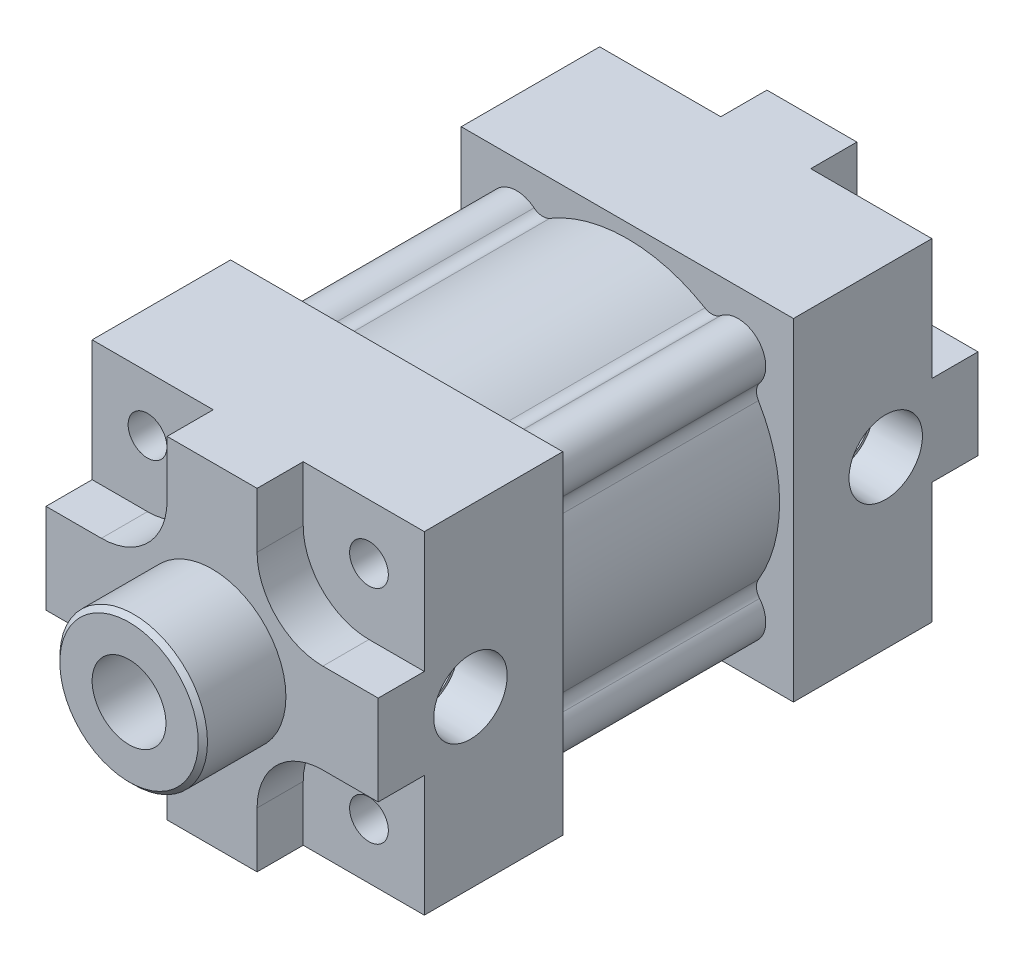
ISO-10303-21;
HEADER;
FILE_DESCRIPTION(('STEP AP214'),'2;1');
FILE_NAME('part.step','',(''),(''),'','','');
FILE_SCHEMA(('AUTOMOTIVE_DESIGN { 1 0 10303 214 1 1 1 1 }'));
ENDSEC;
DATA;
#1=APPLICATION_CONTEXT('core data for automotive mechanical design processes');
#2=APPLICATION_PROTOCOL_DEFINITION('international standard','automotive_design',2000,#1);
#3=PRODUCT_CONTEXT('',#1,'mechanical');
#4=PRODUCT('Part','Part','',(#3));
#5=PRODUCT_RELATED_PRODUCT_CATEGORY('part','',(#4));
#6=PRODUCT_DEFINITION_FORMATION('','',#4);
#7=PRODUCT_DEFINITION_CONTEXT('part definition',#1,'design');
#8=PRODUCT_DEFINITION('design','',#6,#7);
#9=PRODUCT_DEFINITION_SHAPE('','',#8);
#10=(LENGTH_UNIT() NAMED_UNIT(*) SI_UNIT(.MILLI.,.METRE.));
#11=(NAMED_UNIT(*) PLANE_ANGLE_UNIT() SI_UNIT($,.RADIAN.));
#12=(NAMED_UNIT(*) SI_UNIT($,.STERADIAN.) SOLID_ANGLE_UNIT());
#13=UNCERTAINTY_MEASURE_WITH_UNIT(LENGTH_MEASURE(1.E-05),#10,'distance_accuracy_value','');
#14=(GEOMETRIC_REPRESENTATION_CONTEXT(3) GLOBAL_UNCERTAINTY_ASSIGNED_CONTEXT((#13)) GLOBAL_UNIT_ASSIGNED_CONTEXT((#10,
#11,#12)) REPRESENTATION_CONTEXT('',''));
#15=CARTESIAN_POINT('',(0.,0.,0.));
#16=DIRECTION('',(0.,0.,1.));
#17=DIRECTION('',(1.,0.,0.));
#18=AXIS2_PLACEMENT_3D('',#15,#16,#17);
#19=CARTESIAN_POINT('',(24.,24.,130.));
#20=DIRECTION('',(0.,0.,1.));
#21=DIRECTION('',(1.,0.,0.));
#22=AXIS2_PLACEMENT_3D('',#19,#20,#21);
#23=CYLINDRICAL_SURFACE('',#22,4.19999999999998);
#24=CARTESIAN_POINT('',(24.,24.,120.));
#25=DIRECTION('',(0.,0.,1.));
#26=DIRECTION('',(1.,0.,0.));
#27=AXIS2_PLACEMENT_3D('',#24,#25,#26);
#28=CIRCLE('',#27,4.19999999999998);
#29=CARTESIAN_POINT('',(28.2,24.,120.));
#30=VERTEX_POINT('',#29);
#31=EDGE_CURVE('E1024',#30,#30,#28,.F.);
#32=ORIENTED_EDGE('',*,*,#31,.F.);
#33=EDGE_LOOP('',(#32));
#34=FACE_BOUND('',#33,.T.);
#35=CARTESIAN_POINT('',(24.,24.,9.99999999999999));
#36=DIRECTION('',(0.,0.,-1.));
#37=DIRECTION('',(-1.,0.,0.));
#38=AXIS2_PLACEMENT_3D('',#35,#36,#37);
#39=CIRCLE('',#38,4.19999999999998);
#40=CARTESIAN_POINT('',(19.8,24.,9.99999999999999));
#41=VERTEX_POINT('',#40);
#42=EDGE_CURVE('E799',#41,#41,#39,.F.);
#43=ORIENTED_EDGE('',*,*,#42,.F.);
#44=EDGE_LOOP('',(#43));
#45=FACE_BOUND('',#44,.T.);
#46=ADVANCED_FACE('F359',(#34,#45),#23,.F.);
#47=CARTESIAN_POINT('',(24.,-24.,130.));
#48=DIRECTION('',(0.,0.,1.));
#49=DIRECTION('',(1.,0.,0.));
#50=AXIS2_PLACEMENT_3D('',#47,#48,#49);
#51=CYLINDRICAL_SURFACE('',#50,4.19999999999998);
#52=CARTESIAN_POINT('',(24.,-24.,120.));
#53=DIRECTION('',(0.,0.,1.));
#54=DIRECTION('',(1.,0.,0.));
#55=AXIS2_PLACEMENT_3D('',#52,#53,#54);
#56=CIRCLE('',#55,4.19999999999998);
#57=CARTESIAN_POINT('',(28.2,-24.,120.));
#58=VERTEX_POINT('',#57);
#59=EDGE_CURVE('E991',#58,#58,#56,.F.);
#60=ORIENTED_EDGE('',*,*,#59,.F.);
#61=EDGE_LOOP('',(#60));
#62=FACE_BOUND('',#61,.T.);
#63=CARTESIAN_POINT('',(24.,-24.,9.99999999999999));
#64=DIRECTION('',(0.,0.,-1.));
#65=DIRECTION('',(-1.,0.,0.));
#66=AXIS2_PLACEMENT_3D('',#63,#64,#65);
#67=CIRCLE('',#66,4.19999999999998);
#68=CARTESIAN_POINT('',(19.8,-24.,9.99999999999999));
#69=VERTEX_POINT('',#68);
#70=EDGE_CURVE('E826',#69,#69,#67,.F.);
#71=ORIENTED_EDGE('',*,*,#70,.F.);
#72=EDGE_LOOP('',(#71));
#73=FACE_BOUND('',#72,.T.);
#74=ADVANCED_FACE('F1185',(#62,#73),#51,.F.);
#75=CARTESIAN_POINT('',(-24.,-24.,130.));
#76=DIRECTION('',(0.,0.,1.));
#77=DIRECTION('',(1.,0.,0.));
#78=AXIS2_PLACEMENT_3D('',#75,#76,#77);
#79=CYLINDRICAL_SURFACE('',#78,4.19999999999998);
#80=CARTESIAN_POINT('',(-24.,-24.,120.));
#81=DIRECTION('',(0.,0.,1.));
#82=DIRECTION('',(1.,0.,0.));
#83=AXIS2_PLACEMENT_3D('',#80,#81,#82);
#84=CIRCLE('',#83,4.19999999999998);
#85=CARTESIAN_POINT('',(-19.8,-24.,120.));
#86=VERTEX_POINT('',#85);
#87=EDGE_CURVE('E958',#86,#86,#84,.F.);
#88=ORIENTED_EDGE('',*,*,#87,.F.);
#89=EDGE_LOOP('',(#88));
#90=FACE_BOUND('',#89,.T.);
#91=CARTESIAN_POINT('',(-24.,-24.,9.99999999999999));
#92=DIRECTION('',(0.,0.,-1.));
#93=DIRECTION('',(-1.,0.,0.));
#94=AXIS2_PLACEMENT_3D('',#91,#92,#93);
#95=CIRCLE('',#94,4.19999999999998);
#96=CARTESIAN_POINT('',(-28.2,-24.,9.99999999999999));
#97=VERTEX_POINT('',#96);
#98=EDGE_CURVE('E858',#97,#97,#95,.F.);
#99=ORIENTED_EDGE('',*,*,#98,.F.);
#100=EDGE_LOOP('',(#99));
#101=FACE_BOUND('',#100,.T.);
#102=ADVANCED_FACE('F1192',(#90,#101),#79,.F.);
#103=CARTESIAN_POINT('',(-24.,24.,130.));
#104=DIRECTION('',(0.,0.,1.));
#105=DIRECTION('',(1.,0.,0.));
#106=AXIS2_PLACEMENT_3D('',#103,#104,#105);
#107=CYLINDRICAL_SURFACE('',#106,4.19999999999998);
#108=CARTESIAN_POINT('',(-24.,24.,120.));
#109=DIRECTION('',(0.,0.,1.));
#110=DIRECTION('',(1.,0.,0.));
#111=AXIS2_PLACEMENT_3D('',#108,#109,#110);
#112=CIRCLE('',#111,4.19999999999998);
#113=CARTESIAN_POINT('',(-19.8,24.,120.));
#114=VERTEX_POINT('',#113);
#115=EDGE_CURVE('E363',#114,#114,#112,.F.);
#116=ORIENTED_EDGE('',*,*,#115,.F.);
#117=EDGE_LOOP('',(#116));
#118=FACE_BOUND('',#117,.T.);
#119=CARTESIAN_POINT('',(-24.,24.,9.99999999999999));
#120=DIRECTION('',(0.,0.,-1.));
#121=DIRECTION('',(-1.,0.,0.));
#122=AXIS2_PLACEMENT_3D('',#119,#120,#121);
#123=CIRCLE('',#122,4.19999999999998);
#124=CARTESIAN_POINT('',(-28.2,24.,9.99999999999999));
#125=VERTEX_POINT('',#124);
#126=EDGE_CURVE('E891',#125,#125,#123,.F.);
#127=ORIENTED_EDGE('',*,*,#126,.F.);
#128=EDGE_LOOP('',(#127));
#129=FACE_BOUND('',#128,.T.);
#130=ADVANCED_FACE('F1198',(#118,#129),#107,.F.);
#131=CARTESIAN_POINT('',(-36.,-36.,0.));
#132=DIRECTION('',(0.,0.,1.));
#133=DIRECTION('',(1.,0.,0.));
#134=AXIS2_PLACEMENT_3D('',#131,#132,#133);
#135=PLANE('',#134);
#136=CARTESIAN_POINT('',(23.9999999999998,24.0000000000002,0.));
#137=DIRECTION('',(0.,0.,-1.));
#138=DIRECTION('',(-1.,0.,0.));
#139=AXIS2_PLACEMENT_3D('',#136,#137,#138);
#140=CIRCLE('',#139,14.25);
#141=CARTESIAN_POINT('',(24.,9.75,0.));
#142=VERTEX_POINT('',#141);
#143=CARTESIAN_POINT('',(9.75,24.,0.));
#144=VERTEX_POINT('',#143);
#145=EDGE_CURVE('E773',#142,#144,#140,.T.);
#146=ORIENTED_EDGE('',*,*,#145,.F.);
#147=DIRECTION('',(-1.,0.,0.));
#148=VECTOR('',#147,1.);
#149=CARTESIAN_POINT('',(35.9999999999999,9.75,0.));
#150=LINE('',#149,#148);
#151=CARTESIAN_POINT('',(35.9999999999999,9.75,0.));
#152=VERTEX_POINT('',#151);
#153=EDGE_CURVE('E785',#152,#142,#150,.T.);
#154=ORIENTED_EDGE('',*,*,#153,.F.);
#155=DIRECTION('',(0.,1.,0.));
#156=VECTOR('',#155,1.);
#157=CARTESIAN_POINT('',(36.,36.,0.));
#158=LINE('',#157,#156);
#159=CARTESIAN_POINT('',(36.,-9.75000000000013,0.));
#160=VERTEX_POINT('',#159);
#161=EDGE_CURVE('E1265',#160,#152,#158,.T.);
#162=ORIENTED_EDGE('',*,*,#161,.F.);
#163=DIRECTION('',(1.,0.,0.));
#164=VECTOR('',#163,1.);
#165=CARTESIAN_POINT('',(24.,-9.75000000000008,0.));
#166=LINE('',#165,#164);
#167=CARTESIAN_POINT('',(24.,-9.75000000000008,0.));
#168=VERTEX_POINT('',#167);
#169=EDGE_CURVE('E808',#168,#160,#166,.T.);
#170=ORIENTED_EDGE('',*,*,#169,.F.);
#171=CARTESIAN_POINT('',(24.0000000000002,-23.9999999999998,0.));
#172=DIRECTION('',(0.,0.,-1.));
#173=DIRECTION('',(-1.,0.,0.));
#174=AXIS2_PLACEMENT_3D('',#171,#172,#173);
#175=CIRCLE('',#174,14.25);
#176=CARTESIAN_POINT('',(9.74999999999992,-24.,0.));
#177=VERTEX_POINT('',#176);
#178=EDGE_CURVE('E805',#177,#168,#175,.T.);
#179=ORIENTED_EDGE('',*,*,#178,.F.);
#180=DIRECTION('',(0.,1.,0.));
#181=VECTOR('',#180,1.);
#182=CARTESIAN_POINT('',(9.74999999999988,-35.9999999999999,0.));
#183=LINE('',#182,#181);
#184=CARTESIAN_POINT('',(9.74999999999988,-35.9999999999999,0.));
#185=VERTEX_POINT('',#184);
#186=EDGE_CURVE('E810',#185,#177,#183,.T.);
#187=ORIENTED_EDGE('',*,*,#186,.F.);
#188=DIRECTION('',(1.,0.,0.));
#189=VECTOR('',#188,1.);
#190=CARTESIAN_POINT('',(-36.,-36.,0.));
#191=LINE('',#190,#189);
#192=CARTESIAN_POINT('',(-9.75000000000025,-35.9999999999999,0.));
#193=VERTEX_POINT('',#192);
#194=EDGE_CURVE('E1259',#193,#185,#191,.T.);
#195=ORIENTED_EDGE('',*,*,#194,.F.);
#196=DIRECTION('',(0.,-1.,0.));
#197=VECTOR('',#196,1.);
#198=CARTESIAN_POINT('',(-9.75000000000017,-23.9999999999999,0.));
#199=LINE('',#198,#197);
#200=CARTESIAN_POINT('',(-9.75000000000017,-23.9999999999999,0.));
#201=VERTEX_POINT('',#200);
#202=EDGE_CURVE('E838',#201,#193,#199,.T.);
#203=ORIENTED_EDGE('',*,*,#202,.F.);
#204=CARTESIAN_POINT('',(-23.9999999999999,-24.0000000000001,0.));
#205=DIRECTION('',(0.,0.,-1.));
#206=DIRECTION('',(-1.,0.,0.));
#207=AXIS2_PLACEMENT_3D('',#204,#205,#206);
#208=CIRCLE('',#207,14.25);
#209=CARTESIAN_POINT('',(-24.0000000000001,-9.74999999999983,0.));
#210=VERTEX_POINT('',#209);
#211=EDGE_CURVE('E835',#210,#201,#208,.T.);
#212=ORIENTED_EDGE('',*,*,#211,.F.);
#213=DIRECTION('',(1.,0.,0.));
#214=VECTOR('',#213,1.);
#215=CARTESIAN_POINT('',(-36.,-9.74999999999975,0.));
#216=LINE('',#215,#214);
#217=CARTESIAN_POINT('',(-36.,-9.74999999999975,0.));
#218=VERTEX_POINT('',#217);
#219=EDGE_CURVE('E840',#218,#210,#216,.T.);
#220=ORIENTED_EDGE('',*,*,#219,.F.);
#221=DIRECTION('',(0.,-1.,0.));
#222=VECTOR('',#221,1.);
#223=CARTESIAN_POINT('',(-36.,36.,0.));
#224=LINE('',#223,#222);
#225=CARTESIAN_POINT('',(-35.9999999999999,9.75000000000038,0.));
#226=VERTEX_POINT('',#225);
#227=EDGE_CURVE('E1266',#226,#218,#224,.T.);
#228=ORIENTED_EDGE('',*,*,#227,.F.);
#229=DIRECTION('',(-1.,0.,0.));
#230=VECTOR('',#229,1.);
#231=CARTESIAN_POINT('',(-23.9999999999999,9.75000000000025,0.));
#232=LINE('',#231,#230);
#233=CARTESIAN_POINT('',(-23.9999999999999,9.75000000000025,0.));
#234=VERTEX_POINT('',#233);
#235=EDGE_CURVE('E870',#234,#226,#232,.T.);
#236=ORIENTED_EDGE('',*,*,#235,.F.);
#237=CARTESIAN_POINT('',(-24.,24.,0.));
#238=DIRECTION('',(0.,0.,-1.));
#239=DIRECTION('',(-1.,0.,0.));
#240=AXIS2_PLACEMENT_3D('',#237,#238,#239);
#241=CIRCLE('',#240,14.25);
#242=CARTESIAN_POINT('',(-9.74999999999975,24.0000000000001,0.));
#243=VERTEX_POINT('',#242);
#244=EDGE_CURVE('E867',#243,#234,#241,.T.);
#245=ORIENTED_EDGE('',*,*,#244,.F.);
#246=DIRECTION('',(0.,-1.,0.));
#247=VECTOR('',#246,1.);
#248=CARTESIAN_POINT('',(-9.74999999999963,36.,0.));
#249=LINE('',#248,#247);
#250=CARTESIAN_POINT('',(-9.74999999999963,36.,0.));
#251=VERTEX_POINT('',#250);
#252=EDGE_CURVE('E872',#251,#243,#249,.T.);
#253=ORIENTED_EDGE('',*,*,#252,.F.);
#254=DIRECTION('',(-1.,0.,0.));
#255=VECTOR('',#254,1.);
#256=CARTESIAN_POINT('',(-36.,36.,0.));
#257=LINE('',#256,#255);
#258=CARTESIAN_POINT('',(9.75,36.,0.));
#259=VERTEX_POINT('',#258);
#260=EDGE_CURVE('E784',#259,#251,#257,.T.);
#261=ORIENTED_EDGE('',*,*,#260,.F.);
#262=DIRECTION('',(0.,1.,0.));
#263=VECTOR('',#262,1.);
#264=CARTESIAN_POINT('',(9.75,24.,0.));
#265=LINE('',#264,#263);
#266=EDGE_CURVE('E765',#144,#259,#265,.T.);
#267=ORIENTED_EDGE('',*,*,#266,.F.);
#268=EDGE_LOOP('',(#146,#154,#162,#170,#179,#187,#195,#203,#212,#220,#228,#236,#245,#253,#261,#267));
#269=FACE_BOUND('',#268,.T.);
#270=CARTESIAN_POINT('',(0.,0.,0.));
#271=DIRECTION('',(0.,0.,1.));
#272=DIRECTION('',(1.,0.,0.));
#273=AXIS2_PLACEMENT_3D('',#270,#271,#272);
#274=CIRCLE('',#273,19.);
#275=CARTESIAN_POINT('',(19.,0.,0.));
#276=VERTEX_POINT('',#275);
#277=EDGE_CURVE('E1369',#276,#276,#274,.F.);
#278=ORIENTED_EDGE('',*,*,#277,.F.);
#279=EDGE_LOOP('',(#278));
#280=FACE_BOUND('',#279,.T.);
#281=ADVANCED_FACE('F781',(#269,#280),#135,.F.);
#282=CARTESIAN_POINT('',(0.,0.,148.));
#283=DIRECTION('',(0.,0.,1.));
#284=DIRECTION('',(1.,0.,0.));
#285=AXIS2_PLACEMENT_3D('',#282,#283,#284);
#286=PLANE('',#285);
#287=CARTESIAN_POINT('',(0.,0.,148.));
#288=DIRECTION('',(0.,0.,1.));
#289=DIRECTION('',(1.,0.,0.));
#290=AXIS2_PLACEMENT_3D('',#287,#288,#289);
#291=CIRCLE('',#290,15.);
#292=CARTESIAN_POINT('',(15.,0.,148.));
#293=VERTEX_POINT('',#292);
#294=EDGE_CURVE('E1377',#293,#293,#291,.T.);
#295=ORIENTED_EDGE('',*,*,#294,.T.);
#296=EDGE_LOOP('',(#295));
#297=FACE_BOUND('',#296,.T.);
#298=CARTESIAN_POINT('',(0.,0.,148.));
#299=DIRECTION('',(0.,0.,1.));
#300=DIRECTION('',(1.,0.,0.));
#301=AXIS2_PLACEMENT_3D('',#298,#299,#300);
#302=CIRCLE('',#301,8.);
#303=CARTESIAN_POINT('',(8.,0.,148.));
#304=VERTEX_POINT('',#303);
#305=EDGE_CURVE('E2062',#304,#304,#302,.T.);
#306=ORIENTED_EDGE('',*,*,#305,.F.);
#307=EDGE_LOOP('',(#306));
#308=FACE_BOUND('',#307,.T.);
#309=ADVANCED_FACE('F1213',(#297,#308),#286,.T.);
#310=CARTESIAN_POINT('',(-36.,-36.,130.));
#311=DIRECTION('',(0.,0.,1.));
#312=DIRECTION('',(1.,0.,0.));
#313=AXIS2_PLACEMENT_3D('',#310,#311,#312);
#314=PLANE('',#313);
#315=DIRECTION('',(0.,1.,0.));
#316=VECTOR('',#315,1.);
#317=CARTESIAN_POINT('',(-9.74999999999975,24.0000000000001,130.));
#318=LINE('',#317,#316);
#319=CARTESIAN_POINT('',(-9.74999999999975,24.0000000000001,130.));
#320=VERTEX_POINT('',#319);
#321=CARTESIAN_POINT('',(-9.74999999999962,36.0000000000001,130.));
#322=VERTEX_POINT('',#321);
#323=EDGE_CURVE('E907',#320,#322,#318,.T.);
#324=ORIENTED_EDGE('',*,*,#323,.F.);
#325=CARTESIAN_POINT('',(-23.9999999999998,24.0000000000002,130.));
#326=DIRECTION('',(0.,0.,1.));
#327=DIRECTION('',(1.,0.,0.));
#328=AXIS2_PLACEMENT_3D('',#325,#326,#327);
#329=CIRCLE('',#328,14.25);
#330=CARTESIAN_POINT('',(-23.9999999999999,9.75000000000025,130.));
#331=VERTEX_POINT('',#330);
#332=EDGE_CURVE('E904',#331,#320,#329,.T.);
#333=ORIENTED_EDGE('',*,*,#332,.F.);
#334=DIRECTION('',(1.,0.,0.));
#335=VECTOR('',#334,1.);
#336=CARTESIAN_POINT('',(-23.9999999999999,9.75000000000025,130.));
#337=LINE('',#336,#335);
#338=CARTESIAN_POINT('',(-35.9999999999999,9.75000000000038,130.));
#339=VERTEX_POINT('',#338);
#340=EDGE_CURVE('E901',#339,#331,#337,.T.);
#341=ORIENTED_EDGE('',*,*,#340,.F.);
#342=DIRECTION('',(0.,-1.,0.));
#343=VECTOR('',#342,1.);
#344=CARTESIAN_POINT('',(-36.,36.,130.));
#345=LINE('',#344,#343);
#346=CARTESIAN_POINT('',(-36.0000000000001,-9.74999999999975,130.));
#347=VERTEX_POINT('',#346);
#348=EDGE_CURVE('E1585',#339,#347,#345,.T.);
#349=ORIENTED_EDGE('',*,*,#348,.T.);
#350=DIRECTION('',(-1.,0.,0.));
#351=VECTOR('',#350,1.);
#352=CARTESIAN_POINT('',(-24.0000000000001,-9.74999999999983,130.));
#353=LINE('',#352,#351);
#354=CARTESIAN_POINT('',(-24.0000000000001,-9.74999999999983,130.));
#355=VERTEX_POINT('',#354);
#356=EDGE_CURVE('E937',#355,#347,#353,.T.);
#357=ORIENTED_EDGE('',*,*,#356,.F.);
#358=CARTESIAN_POINT('',(-24.0000000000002,-23.9999999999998,130.));
#359=DIRECTION('',(0.,0.,1.));
#360=DIRECTION('',(1.,0.,0.));
#361=AXIS2_PLACEMENT_3D('',#358,#359,#360);
#362=CIRCLE('',#361,14.25);
#363=CARTESIAN_POINT('',(-9.75000000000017,-23.9999999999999,130.));
#364=VERTEX_POINT('',#363);
#365=EDGE_CURVE('E934',#364,#355,#362,.T.);
#366=ORIENTED_EDGE('',*,*,#365,.F.);
#367=DIRECTION('',(0.,1.,0.));
#368=VECTOR('',#367,1.);
#369=CARTESIAN_POINT('',(-9.75000000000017,-23.9999999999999,130.));
#370=LINE('',#369,#368);
#371=CARTESIAN_POINT('',(-9.75000000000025,-35.9999999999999,130.));
#372=VERTEX_POINT('',#371);
#373=EDGE_CURVE('E931',#372,#364,#370,.T.);
#374=ORIENTED_EDGE('',*,*,#373,.F.);
#375=DIRECTION('',(1.,0.,0.));
#376=VECTOR('',#375,1.);
#377=CARTESIAN_POINT('',(-36.,-36.,130.));
#378=LINE('',#377,#376);
#379=CARTESIAN_POINT('',(9.74999999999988,-36.,130.));
#380=VERTEX_POINT('',#379);
#381=EDGE_CURVE('E1580',#372,#380,#378,.T.);
#382=ORIENTED_EDGE('',*,*,#381,.T.);
#383=DIRECTION('',(0.,-1.,0.));
#384=VECTOR('',#383,1.);
#385=CARTESIAN_POINT('',(9.74999999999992,-24.,130.));
#386=LINE('',#385,#384);
#387=CARTESIAN_POINT('',(9.74999999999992,-24.,130.));
#388=VERTEX_POINT('',#387);
#389=EDGE_CURVE('E970',#388,#380,#386,.T.);
#390=ORIENTED_EDGE('',*,*,#389,.F.);
#391=CARTESIAN_POINT('',(23.9999999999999,-24.0000000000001,130.));
#392=DIRECTION('',(0.,0.,1.));
#393=DIRECTION('',(1.,0.,0.));
#394=AXIS2_PLACEMENT_3D('',#391,#392,#393);
#395=CIRCLE('',#394,14.25);
#396=CARTESIAN_POINT('',(24.,-9.75000000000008,130.));
#397=VERTEX_POINT('',#396);
#398=EDGE_CURVE('E967',#397,#388,#395,.T.);
#399=ORIENTED_EDGE('',*,*,#398,.F.);
#400=DIRECTION('',(-1.,0.,0.));
#401=VECTOR('',#400,1.);
#402=CARTESIAN_POINT('',(24.,-9.75000000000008,130.));
#403=LINE('',#402,#401);
#404=CARTESIAN_POINT('',(36.,-9.75000000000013,130.));
#405=VERTEX_POINT('',#404);
#406=EDGE_CURVE('E964',#405,#397,#403,.T.);
#407=ORIENTED_EDGE('',*,*,#406,.F.);
#408=DIRECTION('',(0.,1.,0.));
#409=VECTOR('',#408,1.);
#410=CARTESIAN_POINT('',(36.,36.,130.));
#411=LINE('',#410,#409);
#412=CARTESIAN_POINT('',(36.,9.75,130.));
#413=VERTEX_POINT('',#412);
#414=EDGE_CURVE('E1574',#405,#413,#411,.T.);
#415=ORIENTED_EDGE('',*,*,#414,.T.);
#416=DIRECTION('',(1.,0.,0.));
#417=VECTOR('',#416,1.);
#418=CARTESIAN_POINT('',(24.,9.75,130.));
#419=LINE('',#418,#417);
#420=CARTESIAN_POINT('',(24.,9.75,130.));
#421=VERTEX_POINT('',#420);
#422=EDGE_CURVE('E1003',#421,#413,#419,.T.);
#423=ORIENTED_EDGE('',*,*,#422,.F.);
#424=CARTESIAN_POINT('',(24.,24.,130.));
#425=DIRECTION('',(0.,0.,1.));
#426=DIRECTION('',(1.,0.,0.));
#427=AXIS2_PLACEMENT_3D('',#424,#425,#426);
#428=CIRCLE('',#427,14.25);
#429=CARTESIAN_POINT('',(9.75,24.,130.));
#430=VERTEX_POINT('',#429);
#431=EDGE_CURVE('E1000',#430,#421,#428,.T.);
#432=ORIENTED_EDGE('',*,*,#431,.F.);
#433=DIRECTION('',(0.,-1.,0.));
#434=VECTOR('',#433,1.);
#435=CARTESIAN_POINT('',(9.75,24.,130.));
#436=LINE('',#435,#434);
#437=CARTESIAN_POINT('',(9.75,36.,130.));
#438=VERTEX_POINT('',#437);
#439=EDGE_CURVE('E997',#438,#430,#436,.T.);
#440=ORIENTED_EDGE('',*,*,#439,.F.);
#441=DIRECTION('',(-1.,0.,0.));
#442=VECTOR('',#441,1.);
#443=CARTESIAN_POINT('',(-36.,36.,130.));
#444=LINE('',#443,#442);
#445=EDGE_CURVE('E1579',#438,#322,#444,.T.);
#446=ORIENTED_EDGE('',*,*,#445,.T.);
#447=EDGE_LOOP('',(#324,#333,#341,#349,#357,#366,#374,#382,#390,#399,#407,#415,#423,#432,#440,#446));
#448=FACE_BOUND('',#447,.T.);
#449=CARTESIAN_POINT('',(0.,0.,130.));
#450=DIRECTION('',(0.,0.,1.));
#451=DIRECTION('',(1.,0.,0.));
#452=AXIS2_PLACEMENT_3D('',#449,#450,#451);
#453=CIRCLE('',#452,16.);
#454=CARTESIAN_POINT('',(16.,0.,130.));
#455=VERTEX_POINT('',#454);
#456=EDGE_CURVE('E2067',#455,#455,#453,.T.);
#457=ORIENTED_EDGE('',*,*,#456,.F.);
#458=EDGE_LOOP('',(#457));
#459=FACE_BOUND('',#458,.T.);
#460=ADVANCED_FACE('F1210',(#448,#459),#314,.T.);
#461=CARTESIAN_POINT('',(-36.,-36.,40.));
#462=DIRECTION('',(0.,0.,1.));
#463=DIRECTION('',(1.,0.,0.));
#464=AXIS2_PLACEMENT_3D('',#461,#462,#463);
#465=PLANE('',#464);
#466=DIRECTION('',(0.,-1.,0.));
#467=VECTOR('',#466,1.);
#468=CARTESIAN_POINT('',(-36.,36.,40.));
#469=LINE('',#468,#467);
#470=CARTESIAN_POINT('',(-36.,36.,40.));
#471=VERTEX_POINT('',#470);
#472=CARTESIAN_POINT('',(-36.,-36.,40.));
#473=VERTEX_POINT('',#472);
#474=EDGE_CURVE('E1276',#471,#473,#469,.T.);
#475=ORIENTED_EDGE('',*,*,#474,.T.);
#476=DIRECTION('',(1.,0.,0.));
#477=VECTOR('',#476,1.);
#478=CARTESIAN_POINT('',(-36.,-36.,40.));
#479=LINE('',#478,#477);
#480=CARTESIAN_POINT('',(36.,-36.,40.));
#481=VERTEX_POINT('',#480);
#482=EDGE_CURVE('E1279',#473,#481,#479,.T.);
#483=ORIENTED_EDGE('',*,*,#482,.T.);
#484=DIRECTION('',(0.,1.,0.));
#485=VECTOR('',#484,1.);
#486=CARTESIAN_POINT('',(36.,36.,40.));
#487=LINE('',#486,#485);
#488=CARTESIAN_POINT('',(36.,36.,40.));
#489=VERTEX_POINT('',#488);
#490=EDGE_CURVE('E1281',#481,#489,#487,.T.);
#491=ORIENTED_EDGE('',*,*,#490,.T.);
#492=DIRECTION('',(-1.,0.,0.));
#493=VECTOR('',#492,1.);
#494=CARTESIAN_POINT('',(-36.,36.,40.));
#495=LINE('',#494,#493);
#496=EDGE_CURVE('E1283',#489,#471,#495,.T.);
#497=ORIENTED_EDGE('',*,*,#496,.T.);
#498=EDGE_LOOP('',(#475,#483,#491,#497));
#499=FACE_BOUND('',#498,.T.);
#500=CARTESIAN_POINT('',(-24.,24.,40.));
#501=DIRECTION('',(0.,0.,1.));
#502=DIRECTION('',(1.,0.,0.));
#503=AXIS2_PLACEMENT_3D('',#500,#501,#502);
#504=CIRCLE('',#503,6.);
#505=CARTESIAN_POINT('',(-20.2174770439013,28.6575229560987,40.));
#506=VERTEX_POINT('',#505);
#507=CARTESIAN_POINT('',(-28.6575229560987,20.2174770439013,40.));
#508=VERTEX_POINT('',#507);
#509=EDGE_CURVE('E1647',#506,#508,#504,.T.);
#510=ORIENTED_EDGE('',*,*,#509,.F.);
#511=CARTESIAN_POINT('',(-18.326215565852,30.9862844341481,40.));
#512=DIRECTION('',(0.,0.,1.));
#513=DIRECTION('',(1.,0.,0.));
#514=AXIS2_PLACEMENT_3D('',#511,#512,#513);
#515=CIRCLE('',#514,3.);
#516=CARTESIAN_POINT('',(-16.7990309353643,28.4040940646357,40.));
#517=VERTEX_POINT('',#516);
#518=EDGE_CURVE('E1317',#506,#517,#515,.T.);
#519=ORIENTED_EDGE('',*,*,#518,.T.);
#520=CARTESIAN_POINT('',(0.,0.,40.));
#521=DIRECTION('',(0.,0.,1.));
#522=DIRECTION('',(1.,0.,0.));
#523=AXIS2_PLACEMENT_3D('',#520,#521,#522);
#524=CIRCLE('',#523,33.);
#525=CARTESIAN_POINT('',(16.7990309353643,28.4040940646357,40.));
#526=VERTEX_POINT('',#525);
#527=EDGE_CURVE('E1600',#526,#517,#524,.T.);
#528=ORIENTED_EDGE('',*,*,#527,.F.);
#529=CARTESIAN_POINT('',(18.326215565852,30.9862844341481,40.));
#530=DIRECTION('',(0.,0.,1.));
#531=DIRECTION('',(1.,0.,0.));
#532=AXIS2_PLACEMENT_3D('',#529,#530,#531);
#533=CIRCLE('',#532,3.);
#534=CARTESIAN_POINT('',(20.2174770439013,28.6575229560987,40.));
#535=VERTEX_POINT('',#534);
#536=EDGE_CURVE('E1303',#526,#535,#533,.T.);
#537=ORIENTED_EDGE('',*,*,#536,.T.);
#538=CARTESIAN_POINT('',(24.,24.,40.));
#539=DIRECTION('',(0.,0.,1.));
#540=DIRECTION('',(1.,0.,0.));
#541=AXIS2_PLACEMENT_3D('',#538,#539,#540);
#542=CIRCLE('',#541,6.);
#543=CARTESIAN_POINT('',(28.6575229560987,20.2174770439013,40.));
#544=VERTEX_POINT('',#543);
#545=EDGE_CURVE('E1638',#544,#535,#542,.T.);
#546=ORIENTED_EDGE('',*,*,#545,.F.);
#547=CARTESIAN_POINT('',(30.9862844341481,18.326215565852,40.));
#548=DIRECTION('',(0.,0.,1.));
#549=DIRECTION('',(1.,0.,0.));
#550=AXIS2_PLACEMENT_3D('',#547,#548,#549);
#551=CIRCLE('',#550,3.);
#552=CARTESIAN_POINT('',(28.4040940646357,16.7990309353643,40.));
#553=VERTEX_POINT('',#552);
#554=EDGE_CURVE('E1315',#544,#553,#551,.T.);
#555=ORIENTED_EDGE('',*,*,#554,.T.);
#556=CARTESIAN_POINT('',(28.4040940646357,-16.7990309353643,40.));
#557=VERTEX_POINT('',#556);
#558=EDGE_CURVE('E1597',#557,#553,#524,.T.);
#559=ORIENTED_EDGE('',*,*,#558,.F.);
#560=CARTESIAN_POINT('',(30.9862844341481,-18.326215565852,40.));
#561=DIRECTION('',(0.,0.,1.));
#562=DIRECTION('',(1.,0.,0.));
#563=AXIS2_PLACEMENT_3D('',#560,#561,#562);
#564=CIRCLE('',#563,3.);
#565=CARTESIAN_POINT('',(28.6575229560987,-20.2174770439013,40.));
#566=VERTEX_POINT('',#565);
#567=EDGE_CURVE('E1313',#557,#566,#564,.T.);
#568=ORIENTED_EDGE('',*,*,#567,.T.);
#569=CARTESIAN_POINT('',(24.,-24.,40.));
#570=DIRECTION('',(0.,0.,1.));
#571=DIRECTION('',(1.,0.,0.));
#572=AXIS2_PLACEMENT_3D('',#569,#570,#571);
#573=CIRCLE('',#572,6.);
#574=CARTESIAN_POINT('',(20.2174770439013,-28.6575229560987,40.));
#575=VERTEX_POINT('',#574);
#576=EDGE_CURVE('E1629',#575,#566,#573,.T.);
#577=ORIENTED_EDGE('',*,*,#576,.F.);
#578=CARTESIAN_POINT('',(18.326215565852,-30.9862844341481,40.));
#579=DIRECTION('',(0.,0.,1.));
#580=DIRECTION('',(1.,0.,0.));
#581=AXIS2_PLACEMENT_3D('',#578,#579,#580);
#582=CIRCLE('',#581,3.);
#583=CARTESIAN_POINT('',(16.7990309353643,-28.4040940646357,40.));
#584=VERTEX_POINT('',#583);
#585=EDGE_CURVE('E1311',#575,#584,#582,.T.);
#586=ORIENTED_EDGE('',*,*,#585,.T.);
#587=CARTESIAN_POINT('',(-16.7990309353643,-28.4040940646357,40.));
#588=VERTEX_POINT('',#587);
#589=EDGE_CURVE('E1599',#588,#584,#524,.T.);
#590=ORIENTED_EDGE('',*,*,#589,.F.);
#591=CARTESIAN_POINT('',(-18.326215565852,-30.9862844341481,40.));
#592=DIRECTION('',(0.,0.,1.));
#593=DIRECTION('',(1.,0.,0.));
#594=AXIS2_PLACEMENT_3D('',#591,#592,#593);
#595=CIRCLE('',#594,3.);
#596=CARTESIAN_POINT('',(-20.2174770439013,-28.6575229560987,40.));
#597=VERTEX_POINT('',#596);
#598=EDGE_CURVE('E1309',#588,#597,#595,.T.);
#599=ORIENTED_EDGE('',*,*,#598,.T.);
#600=CARTESIAN_POINT('',(-24.,-24.,40.));
#601=DIRECTION('',(0.,0.,1.));
#602=DIRECTION('',(1.,0.,0.));
#603=AXIS2_PLACEMENT_3D('',#600,#601,#602);
#604=CIRCLE('',#603,6.);
#605=CARTESIAN_POINT('',(-28.6575229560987,-20.2174770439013,40.));
#606=VERTEX_POINT('',#605);
#607=EDGE_CURVE('E1640',#606,#597,#604,.T.);
#608=ORIENTED_EDGE('',*,*,#607,.F.);
#609=CARTESIAN_POINT('',(-30.9862844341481,-18.326215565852,40.));
#610=DIRECTION('',(0.,0.,1.));
#611=DIRECTION('',(1.,0.,0.));
#612=AXIS2_PLACEMENT_3D('',#609,#610,#611);
#613=CIRCLE('',#612,3.);
#614=CARTESIAN_POINT('',(-28.4040940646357,-16.7990309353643,40.));
#615=VERTEX_POINT('',#614);
#616=EDGE_CURVE('E1307',#606,#615,#613,.T.);
#617=ORIENTED_EDGE('',*,*,#616,.T.);
#618=CARTESIAN_POINT('',(-28.4040940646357,16.7990309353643,40.));
#619=VERTEX_POINT('',#618);
#620=EDGE_CURVE('E1596',#619,#615,#524,.T.);
#621=ORIENTED_EDGE('',*,*,#620,.F.);
#622=CARTESIAN_POINT('',(-30.9862844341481,18.326215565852,40.));
#623=DIRECTION('',(0.,0.,1.));
#624=DIRECTION('',(1.,0.,0.));
#625=AXIS2_PLACEMENT_3D('',#622,#623,#624);
#626=CIRCLE('',#625,3.);
#627=EDGE_CURVE('E1305',#619,#508,#626,.T.);
#628=ORIENTED_EDGE('',*,*,#627,.T.);
#629=EDGE_LOOP('',(#510,#519,#528,#537,#546,#555,#559,#568,#577,#586,#590,#599,#608,#617,#621,#628));
#630=FACE_BOUND('',#629,.T.);
#631=ADVANCED_FACE('F1208',(#499,#630),#465,.T.);
#632=CARTESIAN_POINT('',(-36.,-36.,90.));
#633=DIRECTION('',(0.,0.,1.));
#634=DIRECTION('',(1.,0.,0.));
#635=AXIS2_PLACEMENT_3D('',#632,#633,#634);
#636=PLANE('',#635);
#637=DIRECTION('',(0.,-1.,0.));
#638=VECTOR('',#637,1.);
#639=CARTESIAN_POINT('',(-36.,36.,90.));
#640=LINE('',#639,#638);
#641=CARTESIAN_POINT('',(-36.,36.,90.));
#642=VERTEX_POINT('',#641);
#643=CARTESIAN_POINT('',(-36.,-36.,90.));
#644=VERTEX_POINT('',#643);
#645=EDGE_CURVE('E1653',#642,#644,#640,.T.);
#646=ORIENTED_EDGE('',*,*,#645,.F.);
#647=DIRECTION('',(-1.,0.,0.));
#648=VECTOR('',#647,1.);
#649=CARTESIAN_POINT('',(-36.,36.,90.));
#650=LINE('',#649,#648);
#651=CARTESIAN_POINT('',(36.,36.,90.));
#652=VERTEX_POINT('',#651);
#653=EDGE_CURVE('E1664',#652,#642,#650,.T.);
#654=ORIENTED_EDGE('',*,*,#653,.F.);
#655=DIRECTION('',(0.,1.,0.));
#656=VECTOR('',#655,1.);
#657=CARTESIAN_POINT('',(36.,36.,90.));
#658=LINE('',#657,#656);
#659=CARTESIAN_POINT('',(36.,-36.,90.));
#660=VERTEX_POINT('',#659);
#661=EDGE_CURVE('E1661',#660,#652,#658,.T.);
#662=ORIENTED_EDGE('',*,*,#661,.F.);
#663=DIRECTION('',(1.,0.,0.));
#664=VECTOR('',#663,1.);
#665=CARTESIAN_POINT('',(-36.,-36.,90.));
#666=LINE('',#665,#664);
#667=EDGE_CURVE('E1658',#644,#660,#666,.T.);
#668=ORIENTED_EDGE('',*,*,#667,.F.);
#669=EDGE_LOOP('',(#646,#654,#662,#668));
#670=FACE_BOUND('',#669,.T.);
#671=CARTESIAN_POINT('',(0.,0.,90.));
#672=DIRECTION('',(0.,0.,1.));
#673=DIRECTION('',(1.,0.,0.));
#674=AXIS2_PLACEMENT_3D('',#671,#672,#673);
#675=CIRCLE('',#674,33.);
#676=CARTESIAN_POINT('',(16.7990309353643,28.4040940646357,90.));
#677=VERTEX_POINT('',#676);
#678=CARTESIAN_POINT('',(-16.7990309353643,28.4040940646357,90.));
#679=VERTEX_POINT('',#678);
#680=EDGE_CURVE('E1603',#677,#679,#675,.T.);
#681=ORIENTED_EDGE('',*,*,#680,.T.);
#682=CARTESIAN_POINT('',(-18.326215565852,30.9862844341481,90.));
#683=DIRECTION('',(0.,0.,1.));
#684=DIRECTION('',(1.,0.,0.));
#685=AXIS2_PLACEMENT_3D('',#682,#683,#684);
#686=CIRCLE('',#685,3.);
#687=CARTESIAN_POINT('',(-20.2174770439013,28.6575229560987,90.));
#688=VERTEX_POINT('',#687);
#689=EDGE_CURVE('E1337',#679,#688,#686,.F.);
#690=ORIENTED_EDGE('',*,*,#689,.T.);
#691=CARTESIAN_POINT('',(-24.,24.,90.));
#692=DIRECTION('',(0.,0.,1.));
#693=DIRECTION('',(1.,0.,0.));
#694=AXIS2_PLACEMENT_3D('',#691,#692,#693);
#695=CIRCLE('',#694,6.);
#696=CARTESIAN_POINT('',(-28.6575229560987,20.2174770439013,90.));
#697=VERTEX_POINT('',#696);
#698=EDGE_CURVE('E1650',#688,#697,#695,.T.);
#699=ORIENTED_EDGE('',*,*,#698,.T.);
#700=CARTESIAN_POINT('',(-30.9862844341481,18.326215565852,90.));
#701=DIRECTION('',(0.,0.,1.));
#702=DIRECTION('',(1.,0.,0.));
#703=AXIS2_PLACEMENT_3D('',#700,#701,#702);
#704=CIRCLE('',#703,3.);
#705=CARTESIAN_POINT('',(-28.4040940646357,16.7990309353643,90.));
#706=VERTEX_POINT('',#705);
#707=EDGE_CURVE('E1325',#697,#706,#704,.F.);
#708=ORIENTED_EDGE('',*,*,#707,.T.);
#709=CARTESIAN_POINT('',(-28.4040940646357,-16.7990309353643,90.));
#710=VERTEX_POINT('',#709);
#711=EDGE_CURVE('E1601',#706,#710,#675,.T.);
#712=ORIENTED_EDGE('',*,*,#711,.T.);
#713=CARTESIAN_POINT('',(-30.9862844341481,-18.326215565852,90.));
#714=DIRECTION('',(0.,0.,1.));
#715=DIRECTION('',(1.,0.,0.));
#716=AXIS2_PLACEMENT_3D('',#713,#714,#715);
#717=CIRCLE('',#716,3.);
#718=CARTESIAN_POINT('',(-28.6575229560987,-20.2174770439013,90.));
#719=VERTEX_POINT('',#718);
#720=EDGE_CURVE('E1327',#710,#719,#717,.F.);
#721=ORIENTED_EDGE('',*,*,#720,.T.);
#722=CARTESIAN_POINT('',(-24.,-24.,90.));
#723=DIRECTION('',(0.,0.,1.));
#724=DIRECTION('',(1.,0.,0.));
#725=AXIS2_PLACEMENT_3D('',#722,#723,#724);
#726=CIRCLE('',#725,6.);
#727=CARTESIAN_POINT('',(-20.2174770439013,-28.6575229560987,90.));
#728=VERTEX_POINT('',#727);
#729=EDGE_CURVE('E1636',#719,#728,#726,.T.);
#730=ORIENTED_EDGE('',*,*,#729,.T.);
#731=CARTESIAN_POINT('',(-18.326215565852,-30.9862844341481,90.));
#732=DIRECTION('',(0.,0.,1.));
#733=DIRECTION('',(1.,0.,0.));
#734=AXIS2_PLACEMENT_3D('',#731,#732,#733);
#735=CIRCLE('',#734,3.);
#736=CARTESIAN_POINT('',(-16.7990309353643,-28.4040940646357,90.));
#737=VERTEX_POINT('',#736);
#738=EDGE_CURVE('E1329',#728,#737,#735,.F.);
#739=ORIENTED_EDGE('',*,*,#738,.T.);
#740=CARTESIAN_POINT('',(16.7990309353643,-28.4040940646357,90.));
#741=VERTEX_POINT('',#740);
#742=EDGE_CURVE('E1271',#737,#741,#675,.T.);
#743=ORIENTED_EDGE('',*,*,#742,.T.);
#744=CARTESIAN_POINT('',(18.326215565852,-30.9862844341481,90.));
#745=DIRECTION('',(0.,0.,1.));
#746=DIRECTION('',(1.,0.,0.));
#747=AXIS2_PLACEMENT_3D('',#744,#745,#746);
#748=CIRCLE('',#747,3.);
#749=CARTESIAN_POINT('',(20.2174770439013,-28.6575229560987,90.));
#750=VERTEX_POINT('',#749);
#751=EDGE_CURVE('E1331',#741,#750,#748,.F.);
#752=ORIENTED_EDGE('',*,*,#751,.T.);
#753=CARTESIAN_POINT('',(24.,-24.,90.));
#754=DIRECTION('',(0.,0.,1.));
#755=DIRECTION('',(1.,0.,0.));
#756=AXIS2_PLACEMENT_3D('',#753,#754,#755);
#757=CIRCLE('',#756,6.);
#758=CARTESIAN_POINT('',(28.6575229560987,-20.2174770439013,90.));
#759=VERTEX_POINT('',#758);
#760=EDGE_CURVE('E1631',#750,#759,#757,.T.);
#761=ORIENTED_EDGE('',*,*,#760,.T.);
#762=CARTESIAN_POINT('',(30.9862844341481,-18.326215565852,90.));
#763=DIRECTION('',(0.,0.,1.));
#764=DIRECTION('',(1.,0.,0.));
#765=AXIS2_PLACEMENT_3D('',#762,#763,#764);
#766=CIRCLE('',#765,3.);
#767=CARTESIAN_POINT('',(28.4040940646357,-16.7990309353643,90.));
#768=VERTEX_POINT('',#767);
#769=EDGE_CURVE('E1333',#759,#768,#766,.F.);
#770=ORIENTED_EDGE('',*,*,#769,.T.);
#771=CARTESIAN_POINT('',(28.4040940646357,16.7990309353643,90.));
#772=VERTEX_POINT('',#771);
#773=EDGE_CURVE('E1604',#768,#772,#675,.T.);
#774=ORIENTED_EDGE('',*,*,#773,.T.);
#775=CARTESIAN_POINT('',(30.9862844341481,18.326215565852,90.));
#776=DIRECTION('',(0.,0.,1.));
#777=DIRECTION('',(1.,0.,0.));
#778=AXIS2_PLACEMENT_3D('',#775,#776,#777);
#779=CIRCLE('',#778,3.);
#780=CARTESIAN_POINT('',(28.6575229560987,20.2174770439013,90.));
#781=VERTEX_POINT('',#780);
#782=EDGE_CURVE('E1335',#772,#781,#779,.F.);
#783=ORIENTED_EDGE('',*,*,#782,.T.);
#784=CARTESIAN_POINT('',(24.,24.,90.));
#785=DIRECTION('',(0.,0.,1.));
#786=DIRECTION('',(1.,0.,0.));
#787=AXIS2_PLACEMENT_3D('',#784,#785,#786);
#788=CIRCLE('',#787,6.);
#789=CARTESIAN_POINT('',(20.2174770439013,28.6575229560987,90.));
#790=VERTEX_POINT('',#789);
#791=EDGE_CURVE('E1644',#781,#790,#788,.T.);
#792=ORIENTED_EDGE('',*,*,#791,.T.);
#793=CARTESIAN_POINT('',(18.326215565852,30.9862844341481,90.));
#794=DIRECTION('',(0.,0.,1.));
#795=DIRECTION('',(1.,0.,0.));
#796=AXIS2_PLACEMENT_3D('',#793,#794,#795);
#797=CIRCLE('',#796,3.);
#798=EDGE_CURVE('E1323',#790,#677,#797,.F.);
#799=ORIENTED_EDGE('',*,*,#798,.T.);
#800=EDGE_LOOP('',(#681,#690,#699,#708,#712,#721,#730,#739,#743,#752,#761,#770,#774,#783,#792,#799));
#801=FACE_BOUND('',#800,.T.);
#802=ADVANCED_FACE('F1204',(#670,#801),#636,.F.);
#803=CARTESIAN_POINT('',(0.,0.,90.));
#804=DIRECTION('',(0.,0.,-1.));
#805=DIRECTION('',(-1.,0.,0.));
#806=AXIS2_PLACEMENT_3D('',#803,#804,#805);
#807=CYLINDRICAL_SURFACE('',#806,33.);
#808=ORIENTED_EDGE('',*,*,#589,.T.);
#809=DIRECTION('',(0.,0.,-1.));
#810=VECTOR('',#809,1.);
#811=CARTESIAN_POINT('',(16.7990309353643,-28.4040940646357,90.));
#812=LINE('',#811,#810);
#813=EDGE_CURVE('E1357',#584,#741,#812,.F.);
#814=ORIENTED_EDGE('',*,*,#813,.T.);
#815=ORIENTED_EDGE('',*,*,#742,.F.);
#816=DIRECTION('',(0.,0.,-1.));
#817=VECTOR('',#816,1.);
#818=CARTESIAN_POINT('',(-16.7990309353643,-28.4040940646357,90.));
#819=LINE('',#818,#817);
#820=EDGE_CURVE('E1355',#737,#588,#819,.T.);
#821=ORIENTED_EDGE('',*,*,#820,.T.);
#822=EDGE_LOOP('',(#808,#814,#815,#821));
#823=FACE_BOUND('',#822,.T.);
#824=ADVANCED_FACE('F1207',(#823),#807,.T.);
#825=ORIENTED_EDGE('',*,*,#620,.T.);
#826=DIRECTION('',(0.,0.,-1.));
#827=VECTOR('',#826,1.);
#828=CARTESIAN_POINT('',(-28.4040940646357,-16.7990309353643,90.));
#829=LINE('',#828,#827);
#830=EDGE_CURVE('E1367',#615,#710,#829,.F.);
#831=ORIENTED_EDGE('',*,*,#830,.T.);
#832=ORIENTED_EDGE('',*,*,#711,.F.);
#833=DIRECTION('',(0.,0.,-1.));
#834=VECTOR('',#833,1.);
#835=CARTESIAN_POINT('',(-28.4040940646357,16.7990309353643,90.));
#836=LINE('',#835,#834);
#837=EDGE_CURVE('E1365',#706,#619,#836,.T.);
#838=ORIENTED_EDGE('',*,*,#837,.T.);
#839=EDGE_LOOP('',(#825,#831,#832,#838));
#840=FACE_BOUND('',#839,.T.);
#841=ADVANCED_FACE('F1769',(#840),#807,.T.);
#842=ORIENTED_EDGE('',*,*,#558,.T.);
#843=DIRECTION('',(0.,0.,-1.));
#844=VECTOR('',#843,1.);
#845=CARTESIAN_POINT('',(28.4040940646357,16.7990309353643,90.));
#846=LINE('',#845,#844);
#847=EDGE_CURVE('E1347',#553,#772,#846,.F.);
#848=ORIENTED_EDGE('',*,*,#847,.T.);
#849=ORIENTED_EDGE('',*,*,#773,.F.);
#850=DIRECTION('',(0.,0.,-1.));
#851=VECTOR('',#850,1.);
#852=CARTESIAN_POINT('',(28.4040940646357,-16.7990309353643,90.));
#853=LINE('',#852,#851);
#854=EDGE_CURVE('E1345',#768,#557,#853,.T.);
#855=ORIENTED_EDGE('',*,*,#854,.T.);
#856=EDGE_LOOP('',(#842,#848,#849,#855));
#857=FACE_BOUND('',#856,.T.);
#858=ADVANCED_FACE('F1236',(#857),#807,.T.);
#859=ORIENTED_EDGE('',*,*,#527,.T.);
#860=DIRECTION('',(0.,0.,-1.));
#861=VECTOR('',#860,1.);
#862=CARTESIAN_POINT('',(-16.7990309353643,28.4040940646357,90.));
#863=LINE('',#862,#861);
#864=EDGE_CURVE('E1321',#517,#679,#863,.F.);
#865=ORIENTED_EDGE('',*,*,#864,.T.);
#866=ORIENTED_EDGE('',*,*,#680,.F.);
#867=DIRECTION('',(0.,0.,-1.));
#868=VECTOR('',#867,1.);
#869=CARTESIAN_POINT('',(16.7990309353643,28.4040940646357,90.));
#870=LINE('',#869,#868);
#871=EDGE_CURVE('E1319',#677,#526,#870,.T.);
#872=ORIENTED_EDGE('',*,*,#871,.T.);
#873=EDGE_LOOP('',(#859,#865,#866,#872));
#874=FACE_BOUND('',#873,.T.);
#875=ADVANCED_FACE('F1233',(#874),#807,.T.);
#876=CARTESIAN_POINT('',(-36.,36.,40.));
#877=DIRECTION('',(1.,0.,0.));
#878=DIRECTION('',(0.,0.,-1.));
#879=AXIS2_PLACEMENT_3D('',#876,#877,#878);
#880=PLANE('',#879);
#881=ORIENTED_EDGE('',*,*,#227,.T.);
#882=DIRECTION('',(0.,0.,-1.));
#883=VECTOR('',#882,1.);
#884=CARTESIAN_POINT('',(-36.,-9.74999999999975,10.));
#885=LINE('',#884,#883);
#886=CARTESIAN_POINT('',(-36.,-9.74999999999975,10.));
#887=VERTEX_POINT('',#886);
#888=EDGE_CURVE('E859',#887,#218,#885,.T.);
#889=ORIENTED_EDGE('',*,*,#888,.F.);
#890=DIRECTION('',(0.,1.,0.));
#891=VECTOR('',#890,1.);
#892=CARTESIAN_POINT('',(-35.9999999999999,-36.0000000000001,10.));
#893=LINE('',#892,#891);
#894=CARTESIAN_POINT('',(-35.9999999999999,-36.0000000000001,10.));
#895=VERTEX_POINT('',#894);
#896=EDGE_CURVE('E850',#895,#887,#893,.T.);
#897=ORIENTED_EDGE('',*,*,#896,.F.);
#898=DIRECTION('',(0.,0.,-1.));
#899=VECTOR('',#898,1.);
#900=CARTESIAN_POINT('',(-36.,-36.,40.));
#901=LINE('',#900,#899);
#902=EDGE_CURVE('E1294',#473,#895,#901,.T.);
#903=ORIENTED_EDGE('',*,*,#902,.F.);
#904=ORIENTED_EDGE('',*,*,#474,.F.);
#905=DIRECTION('',(0.,0.,-1.));
#906=VECTOR('',#905,1.);
#907=CARTESIAN_POINT('',(-36.,36.,40.));
#908=LINE('',#907,#906);
#909=CARTESIAN_POINT('',(-36.,36.,10.));
#910=VERTEX_POINT('',#909);
#911=EDGE_CURVE('E1285',#471,#910,#908,.T.);
#912=ORIENTED_EDGE('',*,*,#911,.T.);
#913=DIRECTION('',(0.,1.,0.));
#914=VECTOR('',#913,1.);
#915=CARTESIAN_POINT('',(-35.9999999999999,9.75000000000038,10.));
#916=LINE('',#915,#914);
#917=CARTESIAN_POINT('',(-35.9999999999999,9.75000000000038,10.));
#918=VERTEX_POINT('',#917);
#919=EDGE_CURVE('E881',#918,#910,#916,.T.);
#920=ORIENTED_EDGE('',*,*,#919,.F.);
#921=DIRECTION('',(0.,0.,-1.));
#922=VECTOR('',#921,1.);
#923=CARTESIAN_POINT('',(-35.9999999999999,9.75000000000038,10.));
#924=LINE('',#923,#922);
#925=EDGE_CURVE('E895',#918,#226,#924,.T.);
#926=ORIENTED_EDGE('',*,*,#925,.T.);
#927=EDGE_LOOP('',(#881,#889,#897,#903,#904,#912,#920,#926));
#928=FACE_BOUND('',#927,.T.);
#929=ADVANCED_FACE('F361',(#928),#880,.F.);
#930=CARTESIAN_POINT('',(-36.,-36.,40.));
#931=DIRECTION('',(0.,1.,0.));
#932=DIRECTION('',(0.,0.,1.));
#933=AXIS2_PLACEMENT_3D('',#930,#931,#932);
#934=PLANE('',#933);
#935=ORIENTED_EDGE('',*,*,#194,.T.);
#936=DIRECTION('',(0.,0.,-1.));
#937=VECTOR('',#936,1.);
#938=CARTESIAN_POINT('',(9.74999999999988,-35.9999999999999,10.));
#939=LINE('',#938,#937);
#940=CARTESIAN_POINT('',(9.74999999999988,-35.9999999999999,10.));
#941=VERTEX_POINT('',#940);
#942=EDGE_CURVE('E827',#941,#185,#939,.T.);
#943=ORIENTED_EDGE('',*,*,#942,.F.);
#944=DIRECTION('',(-1.,0.,0.));
#945=VECTOR('',#944,1.);
#946=CARTESIAN_POINT('',(36.0000000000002,-35.9999999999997,10.));
#947=LINE('',#946,#945);
#948=CARTESIAN_POINT('',(36.0000000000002,-35.9999999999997,10.));
#949=VERTEX_POINT('',#948);
#950=EDGE_CURVE('E818',#949,#941,#947,.T.);
#951=ORIENTED_EDGE('',*,*,#950,.F.);
#952=DIRECTION('',(0.,0.,-1.));
#953=VECTOR('',#952,1.);
#954=CARTESIAN_POINT('',(36.,-36.,40.));
#955=LINE('',#954,#953);
#956=EDGE_CURVE('E1291',#481,#949,#955,.T.);
#957=ORIENTED_EDGE('',*,*,#956,.F.);
#958=ORIENTED_EDGE('',*,*,#482,.F.);
#959=ORIENTED_EDGE('',*,*,#902,.T.);
#960=DIRECTION('',(-1.,0.,0.));
#961=VECTOR('',#960,1.);
#962=CARTESIAN_POINT('',(-9.75000000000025,-35.9999999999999,10.));
#963=LINE('',#962,#961);
#964=CARTESIAN_POINT('',(-9.74999999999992,-36.,10.));
#965=VERTEX_POINT('',#964);
#966=EDGE_CURVE('E848',#965,#895,#963,.T.);
#967=ORIENTED_EDGE('',*,*,#966,.F.);
#968=DIRECTION('',(0.,0.,-1.));
#969=VECTOR('',#968,1.);
#970=CARTESIAN_POINT('',(-9.75000000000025,-35.9999999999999,10.));
#971=LINE('',#970,#969);
#972=EDGE_CURVE('E861',#965,#193,#971,.T.);
#973=ORIENTED_EDGE('',*,*,#972,.T.);
#974=EDGE_LOOP('',(#935,#943,#951,#957,#958,#959,#967,#973));
#975=FACE_BOUND('',#974,.T.);
#976=ADVANCED_FACE('F1248',(#975),#934,.F.);
#977=CARTESIAN_POINT('',(36.,36.,40.));
#978=DIRECTION('',(-1.,0.,0.));
#979=DIRECTION('',(0.,0.,1.));
#980=AXIS2_PLACEMENT_3D('',#977,#978,#979);
#981=PLANE('',#980);
#982=CARTESIAN_POINT('',(36.,0.,20.));
#983=DIRECTION('',(1.,0.,0.));
#984=DIRECTION('',(0.,0.,-1.));
#985=AXIS2_PLACEMENT_3D('',#982,#983,#984);
#986=CIRCLE('',#985,7.963027);
#987=CARTESIAN_POINT('',(36.,0.,12.036973));
#988=VERTEX_POINT('',#987);
#989=EDGE_CURVE('E1055',#988,#988,#986,.T.);
#990=ORIENTED_EDGE('',*,*,#989,.F.);
#991=EDGE_LOOP('',(#990));
#992=FACE_BOUND('',#991,.T.);
#993=ORIENTED_EDGE('',*,*,#161,.T.);
#994=DIRECTION('',(0.,0.,-1.));
#995=VECTOR('',#994,1.);
#996=CARTESIAN_POINT('',(35.9999999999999,9.75,10.));
#997=LINE('',#996,#995);
#998=CARTESIAN_POINT('',(35.9999999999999,9.75,10.));
#999=VERTEX_POINT('',#998);
#1000=EDGE_CURVE('E800',#999,#152,#997,.T.);
#1001=ORIENTED_EDGE('',*,*,#1000,.F.);
#1002=DIRECTION('',(0.,-1.,0.));
#1003=VECTOR('',#1002,1.);
#1004=CARTESIAN_POINT('',(35.9999999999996,36.0000000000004,10.));
#1005=LINE('',#1004,#1003);
#1006=CARTESIAN_POINT('',(35.9999999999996,36.0000000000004,10.));
#1007=VERTEX_POINT('',#1006);
#1008=EDGE_CURVE('E794',#1007,#999,#1005,.T.);
#1009=ORIENTED_EDGE('',*,*,#1008,.F.);
#1010=DIRECTION('',(0.,0.,-1.));
#1011=VECTOR('',#1010,1.);
#1012=CARTESIAN_POINT('',(36.,36.,40.));
#1013=LINE('',#1012,#1011);
#1014=EDGE_CURVE('E1288',#489,#1007,#1013,.T.);
#1015=ORIENTED_EDGE('',*,*,#1014,.F.);
#1016=ORIENTED_EDGE('',*,*,#490,.F.);
#1017=ORIENTED_EDGE('',*,*,#956,.T.);
#1018=DIRECTION('',(0.,-1.,0.));
#1019=VECTOR('',#1018,1.);
#1020=CARTESIAN_POINT('',(36.,-9.75000000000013,10.));
#1021=LINE('',#1020,#1019);
#1022=CARTESIAN_POINT('',(36.,-9.74999999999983,10.));
#1023=VERTEX_POINT('',#1022);
#1024=EDGE_CURVE('E816',#1023,#949,#1021,.T.);
#1025=ORIENTED_EDGE('',*,*,#1024,.F.);
#1026=DIRECTION('',(0.,0.,-1.));
#1027=VECTOR('',#1026,1.);
#1028=CARTESIAN_POINT('',(36.,-9.75000000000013,10.));
#1029=LINE('',#1028,#1027);
#1030=EDGE_CURVE('E829',#1023,#160,#1029,.T.);
#1031=ORIENTED_EDGE('',*,*,#1030,.T.);
#1032=EDGE_LOOP('',(#993,#1001,#1009,#1015,#1016,#1017,#1025,#1031));
#1033=FACE_BOUND('',#1032,.T.);
#1034=ADVANCED_FACE('F1245',(#992,#1033),#981,.F.);
#1035=CARTESIAN_POINT('',(-36.,36.,40.));
#1036=DIRECTION('',(0.,-1.,0.));
#1037=DIRECTION('',(0.,0.,-1.));
#1038=AXIS2_PLACEMENT_3D('',#1035,#1036,#1037);
#1039=PLANE('',#1038);
#1040=DIRECTION('',(1.,0.,0.));
#1041=VECTOR('',#1040,1.);
#1042=CARTESIAN_POINT('',(9.75,36.,10.));
#1043=LINE('',#1042,#1041);
#1044=CARTESIAN_POINT('',(9.74999999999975,36.,10.));
#1045=VERTEX_POINT('',#1044);
#1046=EDGE_CURVE('E792',#1045,#1007,#1043,.T.);
#1047=ORIENTED_EDGE('',*,*,#1046,.F.);
#1048=DIRECTION('',(0.,0.,-1.));
#1049=VECTOR('',#1048,1.);
#1050=CARTESIAN_POINT('',(9.75,36.,10.));
#1051=LINE('',#1050,#1049);
#1052=EDGE_CURVE('E769',#1045,#259,#1051,.T.);
#1053=ORIENTED_EDGE('',*,*,#1052,.T.);
#1054=ORIENTED_EDGE('',*,*,#260,.T.);
#1055=DIRECTION('',(0.,0.,-1.));
#1056=VECTOR('',#1055,1.);
#1057=CARTESIAN_POINT('',(-9.74999999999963,36.,10.));
#1058=LINE('',#1057,#1056);
#1059=CARTESIAN_POINT('',(-9.74999999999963,36.,10.));
#1060=VERTEX_POINT('',#1059);
#1061=EDGE_CURVE('E892',#1060,#251,#1058,.T.);
#1062=ORIENTED_EDGE('',*,*,#1061,.F.);
#1063=DIRECTION('',(1.,0.,0.));
#1064=VECTOR('',#1063,1.);
#1065=CARTESIAN_POINT('',(-36.,36.,10.));
#1066=LINE('',#1065,#1064);
#1067=EDGE_CURVE('E883',#910,#1060,#1066,.T.);
#1068=ORIENTED_EDGE('',*,*,#1067,.F.);
#1069=ORIENTED_EDGE('',*,*,#911,.F.);
#1070=ORIENTED_EDGE('',*,*,#496,.F.);
#1071=ORIENTED_EDGE('',*,*,#1014,.T.);
#1072=EDGE_LOOP('',(#1047,#1053,#1054,#1062,#1068,#1069,#1070,#1071));
#1073=FACE_BOUND('',#1072,.T.);
#1074=ADVANCED_FACE('F1231',(#1073),#1039,.F.);
#1075=CARTESIAN_POINT('',(-36.,36.,130.));
#1076=DIRECTION('',(1.,0.,0.));
#1077=DIRECTION('',(0.,0.,-1.));
#1078=AXIS2_PLACEMENT_3D('',#1075,#1076,#1077);
#1079=PLANE('',#1078);
#1080=ORIENTED_EDGE('',*,*,#348,.F.);
#1081=DIRECTION('',(0.,0.,1.));
#1082=VECTOR('',#1081,1.);
#1083=CARTESIAN_POINT('',(-35.9999999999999,9.75000000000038,120.));
#1084=LINE('',#1083,#1082);
#1085=CARTESIAN_POINT('',(-35.9999999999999,9.75000000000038,120.));
#1086=VERTEX_POINT('',#1085);
#1087=EDGE_CURVE('E922',#1086,#339,#1084,.T.);
#1088=ORIENTED_EDGE('',*,*,#1087,.F.);
#1089=DIRECTION('',(0.,-1.,0.));
#1090=VECTOR('',#1089,1.);
#1091=CARTESIAN_POINT('',(-35.9999999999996,36.0000000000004,120.));
#1092=LINE('',#1091,#1090);
#1093=CARTESIAN_POINT('',(-35.9999999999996,36.0000000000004,120.));
#1094=VERTEX_POINT('',#1093);
#1095=EDGE_CURVE('E911',#1094,#1086,#1092,.T.);
#1096=ORIENTED_EDGE('',*,*,#1095,.F.);
#1097=DIRECTION('',(0.,0.,-1.));
#1098=VECTOR('',#1097,1.);
#1099=CARTESIAN_POINT('',(-36.,36.,130.));
#1100=LINE('',#1099,#1098);
#1101=EDGE_CURVE('E1583',#1094,#642,#1100,.T.);
#1102=ORIENTED_EDGE('',*,*,#1101,.T.);
#1103=ORIENTED_EDGE('',*,*,#645,.T.);
#1104=DIRECTION('',(0.,0.,-1.));
#1105=VECTOR('',#1104,1.);
#1106=CARTESIAN_POINT('',(-36.,-36.,130.));
#1107=LINE('',#1106,#1105);
#1108=CARTESIAN_POINT('',(-36.,-36.,120.));
#1109=VERTEX_POINT('',#1108);
#1110=EDGE_CURVE('E1594',#1109,#644,#1107,.T.);
#1111=ORIENTED_EDGE('',*,*,#1110,.F.);
#1112=DIRECTION('',(0.,-1.,0.));
#1113=VECTOR('',#1112,1.);
#1114=CARTESIAN_POINT('',(-36.0000000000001,-9.74999999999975,120.));
#1115=LINE('',#1114,#1113);
#1116=CARTESIAN_POINT('',(-36.0000000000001,-9.74999999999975,120.));
#1117=VERTEX_POINT('',#1116);
#1118=EDGE_CURVE('E940',#1117,#1109,#1115,.T.);
#1119=ORIENTED_EDGE('',*,*,#1118,.F.);
#1120=DIRECTION('',(0.,0.,1.));
#1121=VECTOR('',#1120,1.);
#1122=CARTESIAN_POINT('',(-36.0000000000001,-9.74999999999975,120.));
#1123=LINE('',#1122,#1121);
#1124=EDGE_CURVE('E955',#1117,#347,#1123,.T.);
#1125=ORIENTED_EDGE('',*,*,#1124,.T.);
#1126=EDGE_LOOP('',(#1080,#1088,#1096,#1102,#1103,#1111,#1119,#1125));
#1127=FACE_BOUND('',#1126,.T.);
#1128=ADVANCED_FACE('F1227',(#1127),#1079,.F.);
#1129=CARTESIAN_POINT('',(-36.,-36.,130.));
#1130=DIRECTION('',(0.,1.,0.));
#1131=DIRECTION('',(0.,0.,1.));
#1132=AXIS2_PLACEMENT_3D('',#1129,#1130,#1131);
#1133=PLANE('',#1132);
#1134=ORIENTED_EDGE('',*,*,#381,.F.);
#1135=DIRECTION('',(0.,0.,1.));
#1136=VECTOR('',#1135,1.);
#1137=CARTESIAN_POINT('',(-9.75000000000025,-35.9999999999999,120.));
#1138=LINE('',#1137,#1136);
#1139=CARTESIAN_POINT('',(-9.75000000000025,-35.9999999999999,120.));
#1140=VERTEX_POINT('',#1139);
#1141=EDGE_CURVE('E954',#1140,#372,#1138,.T.);
#1142=ORIENTED_EDGE('',*,*,#1141,.F.);
#1143=DIRECTION('',(1.,0.,0.));
#1144=VECTOR('',#1143,1.);
#1145=CARTESIAN_POINT('',(-36.0000000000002,-35.9999999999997,120.));
#1146=LINE('',#1145,#1144);
#1147=EDGE_CURVE('E942',#1109,#1140,#1146,.T.);
#1148=ORIENTED_EDGE('',*,*,#1147,.F.);
#1149=ORIENTED_EDGE('',*,*,#1110,.T.);
#1150=ORIENTED_EDGE('',*,*,#667,.T.);
#1151=DIRECTION('',(0.,0.,-1.));
#1152=VECTOR('',#1151,1.);
#1153=CARTESIAN_POINT('',(36.,-36.,130.));
#1154=LINE('',#1153,#1152);
#1155=CARTESIAN_POINT('',(36.,-36.,120.));
#1156=VERTEX_POINT('',#1155);
#1157=EDGE_CURVE('E1592',#1156,#660,#1154,.T.);
#1158=ORIENTED_EDGE('',*,*,#1157,.F.);
#1159=DIRECTION('',(1.,0.,0.));
#1160=VECTOR('',#1159,1.);
#1161=CARTESIAN_POINT('',(9.74999999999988,-36.,120.));
#1162=LINE('',#1161,#1160);
#1163=CARTESIAN_POINT('',(9.74999999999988,-36.,120.));
#1164=VERTEX_POINT('',#1163);
#1165=EDGE_CURVE('E973',#1164,#1156,#1162,.T.);
#1166=ORIENTED_EDGE('',*,*,#1165,.F.);
#1167=DIRECTION('',(0.,0.,1.));
#1168=VECTOR('',#1167,1.);
#1169=CARTESIAN_POINT('',(9.74999999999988,-36.,120.));
#1170=LINE('',#1169,#1168);
#1171=EDGE_CURVE('E988',#1164,#380,#1170,.T.);
#1172=ORIENTED_EDGE('',*,*,#1171,.T.);
#1173=EDGE_LOOP('',(#1134,#1142,#1148,#1149,#1150,#1158,#1166,#1172));
#1174=FACE_BOUND('',#1173,.T.);
#1175=ADVANCED_FACE('F1223',(#1174),#1133,.F.);
#1176=CARTESIAN_POINT('',(36.,36.,130.));
#1177=DIRECTION('',(-1.,0.,0.));
#1178=DIRECTION('',(0.,0.,1.));
#1179=AXIS2_PLACEMENT_3D('',#1176,#1177,#1178);
#1180=PLANE('',#1179);
#1181=CARTESIAN_POINT('',(36.,0.,110.));
#1182=DIRECTION('',(1.,0.,0.));
#1183=DIRECTION('',(0.,0.,-1.));
#1184=AXIS2_PLACEMENT_3D('',#1181,#1182,#1183);
#1185=CIRCLE('',#1184,7.963027);
#1186=CARTESIAN_POINT('',(36.,0.,102.036973));
#1187=VERTEX_POINT('',#1186);
#1188=EDGE_CURVE('E1030',#1187,#1187,#1185,.T.);
#1189=ORIENTED_EDGE('',*,*,#1188,.F.);
#1190=EDGE_LOOP('',(#1189));
#1191=FACE_BOUND('',#1190,.T.);
#1192=ORIENTED_EDGE('',*,*,#414,.F.);
#1193=DIRECTION('',(0.,0.,1.));
#1194=VECTOR('',#1193,1.);
#1195=CARTESIAN_POINT('',(36.,-9.75000000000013,120.));
#1196=LINE('',#1195,#1194);
#1197=CARTESIAN_POINT('',(36.,-9.75000000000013,120.));
#1198=VERTEX_POINT('',#1197);
#1199=EDGE_CURVE('E987',#1198,#405,#1196,.T.);
#1200=ORIENTED_EDGE('',*,*,#1199,.F.);
#1201=DIRECTION('',(0.,1.,0.));
#1202=VECTOR('',#1201,1.);
#1203=CARTESIAN_POINT('',(35.9999999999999,-36.0000000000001,120.));
#1204=LINE('',#1203,#1202);
#1205=EDGE_CURVE('E975',#1156,#1198,#1204,.T.);
#1206=ORIENTED_EDGE('',*,*,#1205,.F.);
#1207=ORIENTED_EDGE('',*,*,#1157,.T.);
#1208=ORIENTED_EDGE('',*,*,#661,.T.);
#1209=DIRECTION('',(0.,0.,-1.));
#1210=VECTOR('',#1209,1.);
#1211=CARTESIAN_POINT('',(36.,36.,130.));
#1212=LINE('',#1211,#1210);
#1213=CARTESIAN_POINT('',(36.,36.,120.));
#1214=VERTEX_POINT('',#1213);
#1215=EDGE_CURVE('E1590',#1214,#652,#1212,.T.);
#1216=ORIENTED_EDGE('',*,*,#1215,.F.);
#1217=DIRECTION('',(0.,1.,0.));
#1218=VECTOR('',#1217,1.);
#1219=CARTESIAN_POINT('',(36.,9.75,120.));
#1220=LINE('',#1219,#1218);
#1221=CARTESIAN_POINT('',(36.,9.75,120.));
#1222=VERTEX_POINT('',#1221);
#1223=EDGE_CURVE('E1018',#1222,#1214,#1220,.T.);
#1224=ORIENTED_EDGE('',*,*,#1223,.F.);
#1225=DIRECTION('',(0.,0.,1.));
#1226=VECTOR('',#1225,1.);
#1227=CARTESIAN_POINT('',(36.,9.75,120.));
#1228=LINE('',#1227,#1226);
#1229=EDGE_CURVE('E1021',#1222,#413,#1228,.T.);
#1230=ORIENTED_EDGE('',*,*,#1229,.T.);
#1231=EDGE_LOOP('',(#1192,#1200,#1206,#1207,#1208,#1216,#1224,#1230));
#1232=FACE_BOUND('',#1231,.T.);
#1233=ADVANCED_FACE('F1219',(#1191,#1232),#1180,.F.);
#1234=CARTESIAN_POINT('',(-36.,36.,130.));
#1235=DIRECTION('',(0.,-1.,0.));
#1236=DIRECTION('',(0.,0.,-1.));
#1237=AXIS2_PLACEMENT_3D('',#1234,#1235,#1236);
#1238=PLANE('',#1237);
#1239=DIRECTION('',(-1.,0.,0.));
#1240=VECTOR('',#1239,1.);
#1241=CARTESIAN_POINT('',(-9.74999999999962,36.0000000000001,120.));
#1242=LINE('',#1241,#1240);
#1243=CARTESIAN_POINT('',(-9.74999999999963,36.,120.));
#1244=VERTEX_POINT('',#1243);
#1245=EDGE_CURVE('E909',#1244,#1094,#1242,.T.);
#1246=ORIENTED_EDGE('',*,*,#1245,.F.);
#1247=DIRECTION('',(0.,0.,1.));
#1248=VECTOR('',#1247,1.);
#1249=CARTESIAN_POINT('',(-9.74999999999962,36.0000000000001,120.));
#1250=LINE('',#1249,#1248);
#1251=EDGE_CURVE('E923',#1244,#322,#1250,.T.);
#1252=ORIENTED_EDGE('',*,*,#1251,.T.);
#1253=ORIENTED_EDGE('',*,*,#445,.F.);
#1254=DIRECTION('',(0.,0.,1.));
#1255=VECTOR('',#1254,1.);
#1256=CARTESIAN_POINT('',(9.75,36.,120.));
#1257=LINE('',#1256,#1255);
#1258=CARTESIAN_POINT('',(9.75,36.,120.));
#1259=VERTEX_POINT('',#1258);
#1260=EDGE_CURVE('E1020',#1259,#438,#1257,.T.);
#1261=ORIENTED_EDGE('',*,*,#1260,.F.);
#1262=DIRECTION('',(-1.,0.,0.));
#1263=VECTOR('',#1262,1.);
#1264=CARTESIAN_POINT('',(36.,36.,120.));
#1265=LINE('',#1264,#1263);
#1266=EDGE_CURVE('E1006',#1214,#1259,#1265,.T.);
#1267=ORIENTED_EDGE('',*,*,#1266,.F.);
#1268=ORIENTED_EDGE('',*,*,#1215,.T.);
#1269=ORIENTED_EDGE('',*,*,#653,.T.);
#1270=ORIENTED_EDGE('',*,*,#1101,.F.);
#1271=EDGE_LOOP('',(#1246,#1252,#1253,#1261,#1267,#1268,#1269,#1270));
#1272=FACE_BOUND('',#1271,.T.);
#1273=ADVANCED_FACE('F1215',(#1272),#1238,.F.);
#1274=CARTESIAN_POINT('',(-24.,24.,106.970562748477));
#1275=DIRECTION('',(0.,0.,-1.));
#1276=DIRECTION('',(-1.,0.,0.));
#1277=AXIS2_PLACEMENT_3D('',#1274,#1275,#1276);
#1278=CYLINDRICAL_SURFACE('',#1277,6.);
#1279=ORIENTED_EDGE('',*,*,#698,.F.);
#1280=DIRECTION('',(0.,0.,-1.));
#1281=VECTOR('',#1280,1.);
#1282=CARTESIAN_POINT('',(-20.2174770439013,28.6575229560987,106.970562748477));
#1283=LINE('',#1282,#1281);
#1284=EDGE_CURVE('E1300',#688,#506,#1283,.T.);
#1285=ORIENTED_EDGE('',*,*,#1284,.T.);
#1286=ORIENTED_EDGE('',*,*,#509,.T.);
#1287=DIRECTION('',(0.,0.,-1.));
#1288=VECTOR('',#1287,1.);
#1289=CARTESIAN_POINT('',(-28.6575229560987,20.2174770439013,106.970562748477));
#1290=LINE('',#1289,#1288);
#1291=EDGE_CURVE('E1297',#508,#697,#1290,.F.);
#1292=ORIENTED_EDGE('',*,*,#1291,.T.);
#1293=EDGE_LOOP('',(#1279,#1285,#1286,#1292));
#1294=FACE_BOUND('',#1293,.T.);
#1295=ADVANCED_FACE('F1218',(#1294),#1278,.T.);
#1296=CARTESIAN_POINT('',(24.,24.,106.970562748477));
#1297=DIRECTION('',(0.,0.,-1.));
#1298=DIRECTION('',(-1.,0.,0.));
#1299=AXIS2_PLACEMENT_3D('',#1296,#1297,#1298);
#1300=CYLINDRICAL_SURFACE('',#1299,6.);
#1301=ORIENTED_EDGE('',*,*,#791,.F.);
#1302=DIRECTION('',(0.,0.,-1.));
#1303=VECTOR('',#1302,1.);
#1304=CARTESIAN_POINT('',(28.6575229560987,20.2174770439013,106.970562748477));
#1305=LINE('',#1304,#1303);
#1306=EDGE_CURVE('E1342',#781,#544,#1305,.T.);
#1307=ORIENTED_EDGE('',*,*,#1306,.T.);
#1308=ORIENTED_EDGE('',*,*,#545,.T.);
#1309=DIRECTION('',(0.,0.,-1.));
#1310=VECTOR('',#1309,1.);
#1311=CARTESIAN_POINT('',(20.2174770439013,28.6575229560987,106.970562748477));
#1312=LINE('',#1311,#1310);
#1313=EDGE_CURVE('E1339',#535,#790,#1312,.F.);
#1314=ORIENTED_EDGE('',*,*,#1313,.T.);
#1315=EDGE_LOOP('',(#1301,#1307,#1308,#1314));
#1316=FACE_BOUND('',#1315,.T.);
#1317=ADVANCED_FACE('F1794',(#1316),#1300,.T.);
#1318=CARTESIAN_POINT('',(24.,-24.,106.970562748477));
#1319=DIRECTION('',(0.,0.,-1.));
#1320=DIRECTION('',(-1.,0.,0.));
#1321=AXIS2_PLACEMENT_3D('',#1318,#1319,#1320);
#1322=CYLINDRICAL_SURFACE('',#1321,6.);
#1323=ORIENTED_EDGE('',*,*,#576,.T.);
#1324=DIRECTION('',(0.,0.,-1.));
#1325=VECTOR('',#1324,1.);
#1326=CARTESIAN_POINT('',(28.6575229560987,-20.2174770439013,106.970562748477));
#1327=LINE('',#1326,#1325);
#1328=EDGE_CURVE('E1352',#566,#759,#1327,.F.);
#1329=ORIENTED_EDGE('',*,*,#1328,.T.);
#1330=ORIENTED_EDGE('',*,*,#760,.F.);
#1331=DIRECTION('',(0.,0.,-1.));
#1332=VECTOR('',#1331,1.);
#1333=CARTESIAN_POINT('',(20.2174770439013,-28.6575229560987,106.970562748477));
#1334=LINE('',#1333,#1332);
#1335=EDGE_CURVE('E1349',#750,#575,#1334,.T.);
#1336=ORIENTED_EDGE('',*,*,#1335,.T.);
#1337=EDGE_LOOP('',(#1323,#1329,#1330,#1336));
#1338=FACE_BOUND('',#1337,.T.);
#1339=ADVANCED_FACE('F1628',(#1338),#1322,.T.);
#1340=CARTESIAN_POINT('',(-24.,-24.,106.970562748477));
#1341=DIRECTION('',(0.,0.,-1.));
#1342=DIRECTION('',(-1.,0.,0.));
#1343=AXIS2_PLACEMENT_3D('',#1340,#1341,#1342);
#1344=CYLINDRICAL_SURFACE('',#1343,6.);
#1345=ORIENTED_EDGE('',*,*,#607,.T.);
#1346=DIRECTION('',(0.,0.,-1.));
#1347=VECTOR('',#1346,1.);
#1348=CARTESIAN_POINT('',(-20.2174770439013,-28.6575229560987,106.970562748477));
#1349=LINE('',#1348,#1347);
#1350=EDGE_CURVE('E1362',#597,#728,#1349,.F.);
#1351=ORIENTED_EDGE('',*,*,#1350,.T.);
#1352=ORIENTED_EDGE('',*,*,#729,.F.);
#1353=DIRECTION('',(0.,0.,-1.));
#1354=VECTOR('',#1353,1.);
#1355=CARTESIAN_POINT('',(-28.6575229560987,-20.2174770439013,106.970562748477));
#1356=LINE('',#1355,#1354);
#1357=EDGE_CURVE('E1359',#719,#606,#1356,.T.);
#1358=ORIENTED_EDGE('',*,*,#1357,.T.);
#1359=EDGE_LOOP('',(#1345,#1351,#1352,#1358));
#1360=FACE_BOUND('',#1359,.T.);
#1361=ADVANCED_FACE('F1808',(#1360),#1344,.T.);
#1362=CARTESIAN_POINT('',(-18.326215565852,30.9862844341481,90.));
#1363=DIRECTION('',(0.,0.,1.));
#1364=DIRECTION('',(1.,0.,0.));
#1365=AXIS2_PLACEMENT_3D('',#1362,#1363,#1364);
#1366=CYLINDRICAL_SURFACE('',#1365,3.);
#1367=ORIENTED_EDGE('',*,*,#689,.F.);
#1368=ORIENTED_EDGE('',*,*,#864,.F.);
#1369=ORIENTED_EDGE('',*,*,#518,.F.);
#1370=ORIENTED_EDGE('',*,*,#1284,.F.);
#1371=EDGE_LOOP('',(#1367,#1368,#1369,#1370));
#1372=FACE_BOUND('',#1371,.T.);
#1373=ADVANCED_FACE('F1815',(#1372),#1366,.F.);
#1374=CARTESIAN_POINT('',(30.9862844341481,18.326215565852,90.));
#1375=DIRECTION('',(0.,0.,1.));
#1376=DIRECTION('',(1.,0.,0.));
#1377=AXIS2_PLACEMENT_3D('',#1374,#1375,#1376);
#1378=CYLINDRICAL_SURFACE('',#1377,3.);
#1379=ORIENTED_EDGE('',*,*,#782,.F.);
#1380=ORIENTED_EDGE('',*,*,#847,.F.);
#1381=ORIENTED_EDGE('',*,*,#554,.F.);
#1382=ORIENTED_EDGE('',*,*,#1306,.F.);
#1383=EDGE_LOOP('',(#1379,#1380,#1381,#1382));
#1384=FACE_BOUND('',#1383,.T.);
#1385=ADVANCED_FACE('F1823',(#1384),#1378,.F.);
#1386=CARTESIAN_POINT('',(30.9862844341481,-18.326215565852,90.));
#1387=DIRECTION('',(0.,0.,-1.));
#1388=DIRECTION('',(-1.,0.,0.));
#1389=AXIS2_PLACEMENT_3D('',#1386,#1387,#1388);
#1390=CYLINDRICAL_SURFACE('',#1389,3.);
#1391=ORIENTED_EDGE('',*,*,#567,.F.);
#1392=ORIENTED_EDGE('',*,*,#854,.F.);
#1393=ORIENTED_EDGE('',*,*,#769,.F.);
#1394=ORIENTED_EDGE('',*,*,#1328,.F.);
#1395=EDGE_LOOP('',(#1391,#1392,#1393,#1394));
#1396=FACE_BOUND('',#1395,.T.);
#1397=ADVANCED_FACE('F1831',(#1396),#1390,.F.);
#1398=CARTESIAN_POINT('',(18.326215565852,-30.9862844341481,90.));
#1399=DIRECTION('',(0.,0.,1.));
#1400=DIRECTION('',(1.,0.,0.));
#1401=AXIS2_PLACEMENT_3D('',#1398,#1399,#1400);
#1402=CYLINDRICAL_SURFACE('',#1401,3.);
#1403=ORIENTED_EDGE('',*,*,#751,.F.);
#1404=ORIENTED_EDGE('',*,*,#813,.F.);
#1405=ORIENTED_EDGE('',*,*,#585,.F.);
#1406=ORIENTED_EDGE('',*,*,#1335,.F.);
#1407=EDGE_LOOP('',(#1403,#1404,#1405,#1406));
#1408=FACE_BOUND('',#1407,.T.);
#1409=ADVANCED_FACE('F1624',(#1408),#1402,.F.);
#1410=CARTESIAN_POINT('',(-18.326215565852,-30.9862844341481,90.));
#1411=DIRECTION('',(0.,0.,-1.));
#1412=DIRECTION('',(-1.,0.,0.));
#1413=AXIS2_PLACEMENT_3D('',#1410,#1411,#1412);
#1414=CYLINDRICAL_SURFACE('',#1413,3.);
#1415=ORIENTED_EDGE('',*,*,#598,.F.);
#1416=ORIENTED_EDGE('',*,*,#820,.F.);
#1417=ORIENTED_EDGE('',*,*,#738,.F.);
#1418=ORIENTED_EDGE('',*,*,#1350,.F.);
#1419=EDGE_LOOP('',(#1415,#1416,#1417,#1418));
#1420=FACE_BOUND('',#1419,.T.);
#1421=ADVANCED_FACE('F1846',(#1420),#1414,.F.);
#1422=CARTESIAN_POINT('',(-30.9862844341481,-18.326215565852,90.));
#1423=DIRECTION('',(0.,0.,1.));
#1424=DIRECTION('',(1.,0.,0.));
#1425=AXIS2_PLACEMENT_3D('',#1422,#1423,#1424);
#1426=CYLINDRICAL_SURFACE('',#1425,3.);
#1427=ORIENTED_EDGE('',*,*,#720,.F.);
#1428=ORIENTED_EDGE('',*,*,#830,.F.);
#1429=ORIENTED_EDGE('',*,*,#616,.F.);
#1430=ORIENTED_EDGE('',*,*,#1357,.F.);
#1431=EDGE_LOOP('',(#1427,#1428,#1429,#1430));
#1432=FACE_BOUND('',#1431,.T.);
#1433=ADVANCED_FACE('F1853',(#1432),#1426,.F.);
#1434=CARTESIAN_POINT('',(-30.9862844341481,18.326215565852,90.));
#1435=DIRECTION('',(0.,0.,-1.));
#1436=DIRECTION('',(-1.,0.,0.));
#1437=AXIS2_PLACEMENT_3D('',#1434,#1435,#1436);
#1438=CYLINDRICAL_SURFACE('',#1437,3.);
#1439=ORIENTED_EDGE('',*,*,#627,.F.);
#1440=ORIENTED_EDGE('',*,*,#837,.F.);
#1441=ORIENTED_EDGE('',*,*,#707,.F.);
#1442=ORIENTED_EDGE('',*,*,#1291,.F.);
#1443=EDGE_LOOP('',(#1439,#1440,#1441,#1442));
#1444=FACE_BOUND('',#1443,.T.);
#1445=ADVANCED_FACE('F1861',(#1444),#1438,.F.);
#1446=CARTESIAN_POINT('',(18.326215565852,30.9862844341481,90.));
#1447=DIRECTION('',(0.,0.,-1.));
#1448=DIRECTION('',(-1.,0.,0.));
#1449=AXIS2_PLACEMENT_3D('',#1446,#1447,#1448);
#1450=CYLINDRICAL_SURFACE('',#1449,3.);
#1451=ORIENTED_EDGE('',*,*,#536,.F.);
#1452=ORIENTED_EDGE('',*,*,#871,.F.);
#1453=ORIENTED_EDGE('',*,*,#798,.F.);
#1454=ORIENTED_EDGE('',*,*,#1313,.F.);
#1455=EDGE_LOOP('',(#1451,#1452,#1453,#1454));
#1456=FACE_BOUND('',#1455,.T.);
#1457=ADVANCED_FACE('F1869',(#1456),#1450,.F.);
#1458=CARTESIAN_POINT('',(0.,0.,148.));
#1459=DIRECTION('',(0.,0.,-1.));
#1460=DIRECTION('',(-1.,0.,0.));
#1461=AXIS2_PLACEMENT_3D('',#1458,#1459,#1460);
#1462=CYLINDRICAL_SURFACE('',#1461,16.);
#1463=CARTESIAN_POINT('',(0.,0.,147.));
#1464=DIRECTION('',(0.,0.,1.));
#1465=DIRECTION('',(1.,0.,0.));
#1466=AXIS2_PLACEMENT_3D('',#1463,#1464,#1465);
#1467=CIRCLE('',#1466,16.);
#1468=CARTESIAN_POINT('',(16.,0.,147.));
#1469=VERTEX_POINT('',#1468);
#1470=EDGE_CURVE('E1379',#1469,#1469,#1467,.F.);
#1471=ORIENTED_EDGE('',*,*,#1470,.T.);
#1472=EDGE_LOOP('',(#1471));
#1473=FACE_BOUND('',#1472,.T.);
#1474=ORIENTED_EDGE('',*,*,#456,.T.);
#1475=EDGE_LOOP('',(#1474));
#1476=FACE_BOUND('',#1475,.T.);
#1477=ADVANCED_FACE('F1877',(#1473,#1476),#1462,.T.);
#1478=CARTESIAN_POINT('',(0.,0.,157.570020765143));
#1479=DIRECTION('',(0.,0.,1.));
#1480=DIRECTION('',(1.,0.,0.));
#1481=AXIS2_PLACEMENT_3D('',#1478,#1479,#1480);
#1482=CYLINDRICAL_SURFACE('',#1481,8.);
#1483=ORIENTED_EDGE('',*,*,#305,.T.);
#1484=EDGE_LOOP('',(#1483));
#1485=FACE_BOUND('',#1484,.T.);
#1486=CARTESIAN_POINT('',(0.,0.,115.));
#1487=DIRECTION('',(0.,0.,1.));
#1488=DIRECTION('',(1.,0.,0.));
#1489=AXIS2_PLACEMENT_3D('',#1486,#1487,#1488);
#1490=CIRCLE('',#1489,8.);
#1491=CARTESIAN_POINT('',(8.,0.,115.));
#1492=VERTEX_POINT('',#1491);
#1493=EDGE_CURVE('E2059',#1492,#1492,#1490,.T.);
#1494=ORIENTED_EDGE('',*,*,#1493,.F.);
#1495=EDGE_LOOP('',(#1494));
#1496=FACE_BOUND('',#1495,.T.);
#1497=ADVANCED_FACE('F1889',(#1485,#1496),#1482,.F.);
#1498=CARTESIAN_POINT('',(0.,8.,115.));
#1499=DIRECTION('',(0.,0.,-1.));
#1500=DIRECTION('',(-1.,0.,0.));
#1501=AXIS2_PLACEMENT_3D('',#1498,#1499,#1500);
#1502=PLANE('',#1501);
#1503=DIRECTION('',(1.,0.,0.));
#1504=VECTOR('',#1503,1.);
#1505=CARTESIAN_POINT('',(36.,5.09337596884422,115.));
#1506=LINE('',#1505,#1504);
#1507=CARTESIAN_POINT('',(16.,5.09337596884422,115.));
#1508=VERTEX_POINT('',#1507);
#1509=CARTESIAN_POINT('',(16.2190480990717,5.09337596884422,115.));
#1510=VERTEX_POINT('',#1509);
#1511=EDGE_CURVE('E1046',#1508,#1510,#1506,.T.);
#1512=ORIENTED_EDGE('',*,*,#1511,.F.);
#1513=CARTESIAN_POINT('',(33.1703289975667,-35.3618876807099,115.));
#1514=CARTESIAN_POINT('',(32.5564065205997,-34.329941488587,115.));
#1515=CARTESIAN_POINT('',(31.9428358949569,-33.2977855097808,115.));
#1516=CARTESIAN_POINT('',(30.7164649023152,-31.232425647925,115.));
#1517=CARTESIAN_POINT('',(30.1036649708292,-30.199221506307,115.));
#1518=CARTESIAN_POINT('',(28.8747290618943,-28.1240856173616,115.));
#1519=CARTESIAN_POINT('',(28.2586035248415,-27.0821476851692,115.));
#1520=CARTESIAN_POINT('',(27.028530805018,-24.9975753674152,115.));
#1521=CARTESIAN_POINT('',(26.4145828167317,-23.9549414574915,115.));
#1522=CARTESIAN_POINT('',(25.3508551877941,-22.1429288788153,115.));
#1523=CARTESIAN_POINT('',(24.9004366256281,-21.373925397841,115.));
#1524=CARTESIAN_POINT('',(24.0016448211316,-19.834678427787,115.));
#1525=CARTESIAN_POINT('',(23.5532716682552,-19.0644348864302,115.));
#1526=CARTESIAN_POINT('',(22.6587563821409,-17.5211064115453,115.));
#1527=CARTESIAN_POINT('',(22.2126186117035,-16.7480189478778,115.));
#1528=CARTESIAN_POINT('',(21.3246569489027,-15.1995316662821,115.));
#1529=CARTESIAN_POINT('',(20.8828323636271,-14.4241322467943,115.));
#1530=CARTESIAN_POINT('',(20.2264373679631,-13.2606637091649,115.));
#1531=CARTESIAN_POINT('',(20.0093724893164,-12.8740025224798,115.));
#1532=CARTESIAN_POINT('',(19.5773509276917,-12.0995049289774,115.));
#1533=CARTESIAN_POINT('',(19.3623942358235,-11.7116685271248,115.));
#1534=CARTESIAN_POINT('',(18.9350731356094,-10.9342371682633,115.));
#1535=CARTESIAN_POINT('',(18.7227105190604,-10.5446412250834,115.));
#1536=CARTESIAN_POINT('',(18.3016300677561,-9.76349757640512,115.));
#1537=CARTESIAN_POINT('',(18.0929121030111,-9.3719499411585,115.));
#1538=CARTESIAN_POINT('',(17.6810449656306,-8.58738180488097,115.));
#1539=CARTESIAN_POINT('',(17.4778813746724,-8.19436888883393,115.));
#1540=CARTESIAN_POINT('',(17.0784412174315,-7.40475155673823,115.));
#1541=CARTESIAN_POINT('',(16.8821657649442,-7.00814657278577,115.));
#1542=CARTESIAN_POINT('',(16.5954684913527,-6.40980646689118,115.));
#1543=CARTESIAN_POINT('',(16.5012378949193,-6.20989736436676,115.));
#1544=CARTESIAN_POINT('',(16.3158990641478,-5.80863950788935,115.));
#1545=CARTESIAN_POINT('',(16.2247907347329,-5.60729079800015,115.));
#1546=CARTESIAN_POINT('',(16.0464460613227,-5.20295314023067,115.));
#1547=CARTESIAN_POINT('',(15.959208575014,-4.99996469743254,115.));
#1548=CARTESIAN_POINT('',(15.7895217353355,-4.59200251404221,115.));
#1549=CARTESIAN_POINT('',(15.7070719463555,-4.38702895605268,115.));
#1550=CARTESIAN_POINT('',(15.600723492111,-4.11110565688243,115.));
#1551=CARTESIAN_POINT('',(15.574166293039,-4.04117694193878,115.));
#1552=CARTESIAN_POINT('',(15.5217967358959,-3.90103745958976,115.));
#1553=CARTESIAN_POINT('',(15.4959844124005,-3.83082667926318,115.));
#1554=CARTESIAN_POINT('',(15.4197499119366,-3.61974543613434,115.));
#1555=CARTESIAN_POINT('',(15.3705340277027,-3.47843594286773,115.));
#1556=CARTESIAN_POINT('',(15.2758628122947,-3.19457761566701,115.));
#1557=CARTESIAN_POINT('',(15.2304070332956,-3.05202893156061,115.));
#1558=CARTESIAN_POINT('',(15.1438646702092,-2.7656042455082,115.));
#1559=CARTESIAN_POINT('',(15.1027780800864,-2.62172824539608,115.));
#1560=CARTESIAN_POINT('',(15.0266390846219,-2.33628915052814,115.));
#1561=CARTESIAN_POINT('',(14.9914599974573,-2.19476003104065,115.));
#1562=CARTESIAN_POINT('',(14.9265838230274,-1.91044480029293,115.));
#1563=CARTESIAN_POINT('',(14.8968866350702,-1.76765871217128,115.));
#1564=CARTESIAN_POINT('',(14.8436570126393,-1.48092629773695,115.));
#1565=CARTESIAN_POINT('',(14.8201248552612,-1.33697991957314,115.));
#1566=CARTESIAN_POINT('',(14.7798611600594,-1.0481412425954,115.));
#1567=CARTESIAN_POINT('',(14.7631291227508,-0.903249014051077,115.));
#1568=CARTESIAN_POINT('',(14.7370734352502,-0.613941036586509,115.));
#1569=CARTESIAN_POINT('',(14.7276926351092,-0.469530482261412,115.));
#1570=CARTESIAN_POINT('',(14.71642611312,-0.18041616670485,115.));
#1571=CARTESIAN_POINT('',(14.7145402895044,-0.0357124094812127,115.));
#1572=CARTESIAN_POINT('',(14.7183263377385,0.253560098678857,115.));
#1573=CARTESIAN_POINT('',(14.7239963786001,0.398128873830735,115.));
#1574=CARTESIAN_POINT('',(14.7427030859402,0.686786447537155,115.));
#1575=CARTESIAN_POINT('',(14.7557398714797,0.830875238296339,115.));
#1576=CARTESIAN_POINT('',(14.7889358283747,1.11966312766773,115.));
#1577=CARTESIAN_POINT('',(14.8091639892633,1.2643542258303,115.));
#1578=CARTESIAN_POINT('',(14.8561374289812,1.55267696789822,115.));
#1579=CARTESIAN_POINT('',(14.8828832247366,1.69630852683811,115.));
#1580=CARTESIAN_POINT('',(14.9422305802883,1.98239959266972,115.));
#1581=CARTESIAN_POINT('',(14.9748341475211,2.12485868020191,115.));
#1582=CARTESIAN_POINT('',(15.04519779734,2.4084814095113,115.));
#1583=CARTESIAN_POINT('',(15.0829576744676,2.54964510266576,115.));
#1584=CARTESIAN_POINT('',(15.186152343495,2.91213443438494,115.));
#1585=CARTESIAN_POINT('',(15.2549435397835,3.13250478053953,115.));
#1586=CARTESIAN_POINT('',(15.4014024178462,3.57029375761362,115.));
#1587=CARTESIAN_POINT('',(15.4790722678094,3.78771165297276,115.));
#1588=CARTESIAN_POINT('',(15.6414719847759,4.22011602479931,115.));
#1589=CARTESIAN_POINT('',(15.7262085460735,4.43509997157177,115.));
#1590=CARTESIAN_POINT('',(15.9011920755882,4.86278003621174,115.));
#1591=CARTESIAN_POINT('',(15.9914386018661,5.07547633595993,115.));
#1592=CARTESIAN_POINT('',(16.1765980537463,5.49960308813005,115.));
#1593=CARTESIAN_POINT('',(16.2715245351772,5.71102759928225,115.));
#1594=CARTESIAN_POINT('',(16.4649082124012,6.13225435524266,115.));
#1595=CARTESIAN_POINT('',(16.5633654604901,6.34205657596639,115.));
#1596=CARTESIAN_POINT('',(16.7630806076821,6.76018562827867,115.));
#1597=CARTESIAN_POINT('',(16.8643370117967,6.96851317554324,115.));
#1598=CARTESIAN_POINT('',(17.0691832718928,7.38401927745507,115.));
#1599=CARTESIAN_POINT('',(17.1727731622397,7.59119781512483,115.));
#1600=CARTESIAN_POINT('',(17.4894509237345,8.21730035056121,115.));
#1601=CARTESIAN_POINT('',(17.7055158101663,8.6347181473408,115.));
#1602=CARTESIAN_POINT('',(18.1431122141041,9.46672091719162,115.));
#1603=CARTESIAN_POINT('',(18.3646443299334,9.88130557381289,115.));
#1604=CARTESIAN_POINT('',(18.8111796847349,10.7074772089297,115.));
#1605=CARTESIAN_POINT('',(19.0361746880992,11.1190686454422,115.));
#1606=CARTESIAN_POINT('',(19.4890689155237,11.9406273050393,115.));
#1607=CARTESIAN_POINT('',(19.7169680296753,12.350594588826,115.));
#1608=CARTESIAN_POINT('',(20.2459765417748,13.2961990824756,115.));
#1609=CARTESIAN_POINT('',(20.5478782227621,13.8313927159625,115.));
#1610=CARTESIAN_POINT('',(21.1544172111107,14.9002286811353,115.));
#1611=CARTESIAN_POINT('',(21.4590545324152,15.4338710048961,115.));
#1612=CARTESIAN_POINT('',(22.0703767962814,16.4999997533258,115.));
#1613=CARTESIAN_POINT('',(22.3770617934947,17.0324861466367,115.));
#1614=CARTESIAN_POINT('',(22.9919935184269,18.096556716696,115.));
#1615=CARTESIAN_POINT('',(23.3002402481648,18.6281408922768,115.));
#1616=CARTESIAN_POINT('',(24.227352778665,20.2228139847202,115.));
#1617=CARTESIAN_POINT('',(24.8480304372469,21.2848492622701,115.));
#1618=CARTESIAN_POINT('',(26.0924521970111,23.407100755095,115.));
#1619=CARTESIAN_POINT('',(26.7161962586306,24.4673169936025,115.));
#1620=CARTESIAN_POINT('',(27.9333533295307,26.5314968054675,115.));
#1621=CARTESIAN_POINT('',(28.5266598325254,27.5355232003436,115.));
#1622=CARTESIAN_POINT('',(29.7146432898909,29.5427701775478,115.));
#1623=CARTESIAN_POINT('',(30.3093202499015,30.5459907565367,115.));
#1624=CARTESIAN_POINT('',(31.4991054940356,32.5508423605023,115.));
#1625=CARTESIAN_POINT('',(32.0942127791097,33.5524739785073,115.));
#1626=CARTESIAN_POINT('',(33.2852146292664,35.555262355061,115.));
#1627=CARTESIAN_POINT('',(33.8811091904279,36.5564191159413,115.));
#1628=CARTESIAN_POINT('',(34.4772867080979,37.5574071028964,115.));
#1629=B_SPLINE_CURVE_WITH_KNOTS('',3,(#1513,#1514,#1515,#1516,#1517,#1518,#1519,#1520,#1521,
#1522,#1523,#1524,#1525,#1526,#1527,#1528,#1529,#1530,#1531,#1532,#1533,#1534,#1535,#1536,#1537,
#1538,#1539,#1540,#1541,#1542,#1543,#1544,#1545,#1546,#1547,#1548,#1549,#1550,#1551,#1552,#1553,
#1554,#1555,#1556,#1557,#1558,#1559,#1560,#1561,#1562,#1563,#1564,#1565,#1566,#1567,#1568,#1569,
#1570,#1571,#1572,#1573,#1574,#1575,#1576,#1577,#1578,#1579,#1580,#1581,#1582,#1583,#1584,#1585,
#1586,#1587,#1588,#1589,#1590,#1591,#1592,#1593,#1594,#1595,#1596,#1597,#1598,#1599,#1600,#1601,
#1602,#1603,#1604,#1605,#1606,#1607,#1608,#1609,#1610,#1611,#1612,#1613,#1614,#1615,#1616,#1617,
#1618,#1619,#1620,#1621,#1622,#1623,#1624,#1625,#1626,#1627,#1628),.UNSPECIFIED.,.F.,.F.,(4,2,2,
2,2,2,2,2,2,2,2,2,2,2,2,2,2,2,2,2,2,2,2,2,2,2,2,2,2,2,2,2,2,2,2,2,2,2,2,2,2,2,2,2,2,2,2,2,2,2,2,
2,2,2,2,2,2,4),(0.,3.60226701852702,7.20605753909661,10.8374757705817,14.4673703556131,
17.1409779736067,19.8147014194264,22.4924410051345,25.1697430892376,26.5000075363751,
27.8302663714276,29.1613972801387,30.4924806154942,31.8196964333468,33.1471258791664,
33.8101195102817,34.4730929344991,35.1358693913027,35.7985854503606,36.0229873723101,
36.2473996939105,36.6962560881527,37.1450589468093,37.593861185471,38.0312728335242,
38.468676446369,38.9060997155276,39.3434908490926,39.7774469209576,40.2113971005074,
40.6452421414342,41.079094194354,41.5172259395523,41.9553924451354,42.39370939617,
42.8320088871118,43.5243213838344,44.2168033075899,44.9099488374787,45.6030388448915,
46.298270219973,46.9935118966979,47.6883891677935,48.3832766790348,49.7932783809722,
51.2034350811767,52.6106402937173,54.0177924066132,55.8611988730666,57.7046147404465,
59.5480800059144,61.3915476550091,65.0818547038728,68.7721142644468,72.270788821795,
75.7694778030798,79.2647266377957,82.7599581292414),.UNSPECIFIED.);
#1630=CARTESIAN_POINT('',(16.,-5.09337596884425,115.));
#1631=VERTEX_POINT('',#1630);
#1632=EDGE_CURVE('E1048',#1631,#1508,#1629,.T.);
#1633=ORIENTED_EDGE('',*,*,#1632,.F.);
#1634=DIRECTION('',(1.,0.,0.));
#1635=VECTOR('',#1634,1.);
#1636=CARTESIAN_POINT('',(36.,-5.09337596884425,115.));
#1637=LINE('',#1636,#1635);
#1638=CARTESIAN_POINT('',(16.2190480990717,-5.09337596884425,115.));
#1639=VERTEX_POINT('',#1638);
#1640=EDGE_CURVE('E1043',#1639,#1631,#1637,.F.);
#1641=ORIENTED_EDGE('',*,*,#1640,.F.);
#1642=CARTESIAN_POINT('',(0.,0.,115.));
#1643=DIRECTION('',(0.,0.,1.));
#1644=DIRECTION('',(1.,0.,0.));
#1645=AXIS2_PLACEMENT_3D('',#1642,#1643,#1644);
#1646=CIRCLE('',#1645,17.);
#1647=EDGE_CURVE('E2058',#1510,#1639,#1646,.T.);
#1648=ORIENTED_EDGE('',*,*,#1647,.F.);
#1649=EDGE_LOOP('',(#1512,#1633,#1641,#1648));
#1650=FACE_BOUND('',#1649,.T.);
#1651=ORIENTED_EDGE('',*,*,#1493,.T.);
#1652=EDGE_LOOP('',(#1651));
#1653=FACE_BOUND('',#1652,.T.);
#1654=ADVANCED_FACE('F1057',(#1650,#1653),#1502,.T.);
#1655=CARTESIAN_POINT('',(0.,0.,157.570020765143));
#1656=DIRECTION('',(0.,0.,1.));
#1657=DIRECTION('',(1.,0.,0.));
#1658=AXIS2_PLACEMENT_3D('',#1655,#1656,#1657);
#1659=CYLINDRICAL_SURFACE('',#1658,17.);
#1660=CARTESIAN_POINT('',(16.2190480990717,5.09337596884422,115.));
#1661=CARTESIAN_POINT('',(16.2006241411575,5.15204470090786,114.940235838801));
#1662=CARTESIAN_POINT('',(16.1821814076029,5.20965844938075,114.879441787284));
#1663=CARTESIAN_POINT('',(16.1453680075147,5.32265130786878,114.755928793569));
#1664=CARTESIAN_POINT('',(16.126997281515,5.37803298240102,114.693212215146));
#1665=CARTESIAN_POINT('',(16.090393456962,5.48657626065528,114.565847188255));
#1666=CARTESIAN_POINT('',(16.0721603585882,5.53973786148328,114.501198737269));
#1667=CARTESIAN_POINT('',(16.035898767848,5.64384560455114,114.369955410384));
#1668=CARTESIAN_POINT('',(16.0178705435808,5.69478904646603,114.303358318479));
#1669=CARTESIAN_POINT('',(16.,5.74456264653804,114.235856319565));
#1670=B_SPLINE_CURVE_WITH_KNOTS('',3,(#1660,#1661,#1662,#1663,#1664,#1665,#1666,#1667,#1668,
#1669),.UNSPECIFIED.,.F.,.F.,(4,2,2,2,4),(0.,0.257240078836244,0.514175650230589,
0.771111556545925,1.02835197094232),.UNSPECIFIED.);
#1671=CARTESIAN_POINT('',(16.,5.74456264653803,114.235856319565));
#1672=VERTEX_POINT('',#1671);
#1673=EDGE_CURVE('E11',#1510,#1672,#1670,.T.);
#1674=ORIENTED_EDGE('',*,*,#1673,.F.);
#1675=ORIENTED_EDGE('',*,*,#1647,.T.);
#1676=CARTESIAN_POINT('',(16.,-5.74456264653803,114.235856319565));
#1677=CARTESIAN_POINT('',(16.0178705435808,-5.69478904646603,114.303358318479));
#1678=CARTESIAN_POINT('',(16.035898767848,-5.64384560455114,114.369955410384));
#1679=CARTESIAN_POINT('',(16.0721603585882,-5.53973786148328,114.501198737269));
#1680=CARTESIAN_POINT('',(16.090393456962,-5.48657626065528,114.565847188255));
#1681=CARTESIAN_POINT('',(16.126997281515,-5.37803298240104,114.693212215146));
#1682=CARTESIAN_POINT('',(16.1453680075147,-5.32265130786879,114.755928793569));
#1683=CARTESIAN_POINT('',(16.1821814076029,-5.20965844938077,114.879441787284));
#1684=CARTESIAN_POINT('',(16.2006241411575,-5.15204470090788,114.940235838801));
#1685=CARTESIAN_POINT('',(16.2190480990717,-5.09337596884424,115.));
#1686=B_SPLINE_CURVE_WITH_KNOTS('',3,(#1676,#1677,#1678,#1679,#1680,#1681,#1682,#1683,#1684,
#1685),.UNSPECIFIED.,.F.,.F.,(4,2,2,2,4),(0.,0.257240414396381,0.514176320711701,
0.771111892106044,1.02835197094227),.UNSPECIFIED.);
#1687=CARTESIAN_POINT('',(16.,-5.74456264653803,114.235856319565));
#1688=VERTEX_POINT('',#1687);
#1689=EDGE_CURVE('E368',#1688,#1639,#1686,.T.);
#1690=ORIENTED_EDGE('',*,*,#1689,.F.);
#1691=CARTESIAN_POINT('',(16.0002,-5.74400556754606,105.76282755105));
#1692=CARTESIAN_POINT('',(15.9600999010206,-5.85557469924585,106.026439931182));
#1693=CARTESIAN_POINT('',(15.9227169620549,-5.95616163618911,106.295080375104));
#1694=CARTESIAN_POINT('',(15.8545725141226,-6.13531774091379,106.840413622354));
#1695=CARTESIAN_POINT('',(15.8238107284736,-6.2138878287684,107.117106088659));
#1696=CARTESIAN_POINT('',(15.7700927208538,-6.34896474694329,107.676556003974));
#1697=CARTESIAN_POINT('',(15.7471363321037,-6.40547204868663,107.95931332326));
#1698=CARTESIAN_POINT('',(15.7098951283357,-6.4962786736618,108.528928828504));
#1699=CARTESIAN_POINT('',(15.6956100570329,-6.5305786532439,108.815786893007));
#1700=CARTESIAN_POINT('',(15.6762334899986,-6.57695476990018,109.392885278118));
#1701=CARTESIAN_POINT('',(15.6711829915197,-6.58893180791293,109.683134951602));
#1702=CARTESIAN_POINT('',(15.6706035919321,-6.59030996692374,110.263722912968));
#1703=CARTESIAN_POINT('',(15.6750755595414,-6.5797090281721,110.554061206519));
#1704=CARTESIAN_POINT('',(15.6933514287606,-6.53599866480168,111.13237976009));
#1705=CARTESIAN_POINT('',(15.7071436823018,-6.50291733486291,111.420362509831));
#1706=CARTESIAN_POINT('',(15.7434923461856,-6.4144157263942,111.992201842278));
#1707=CARTESIAN_POINT('',(15.766045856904,-6.35900283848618,112.276059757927));
#1708=CARTESIAN_POINT('',(15.8197250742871,-6.22428283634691,112.844902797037));
#1709=CARTESIAN_POINT('',(15.8510526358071,-6.14440832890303,113.129735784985));
#1710=CARTESIAN_POINT('',(15.9033133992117,-6.0072450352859,113.550391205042));
#1711=CARTESIAN_POINT('',(15.9216010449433,-5.95866169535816,113.689440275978));
#1712=CARTESIAN_POINT('',(15.9597583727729,-5.8556906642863,113.965155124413));
#1713=CARTESIAN_POINT('',(15.9796280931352,-5.80130283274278,114.10182084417));
#1714=CARTESIAN_POINT('',(16.0002,-5.74400556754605,114.23717244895));
#1715=B_SPLINE_CURVE_WITH_KNOTS('',3,(#1691,#1692,#1693,#1694,#1695,#1696,#1697,#1698,#1699,
#1700,#1701,#1702,#1703,#1704,#1705,#1706,#1707,#1708,#1709,#1710,#1711,#1712,#1713,#1714),
.UNSPECIFIED.,.F.,.F.,(4,2,2,2,2,2,2,2,2,2,2,4),(0.,0.866829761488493,1.73362329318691,
2.60039830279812,3.46714769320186,4.33773579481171,5.20840332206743,6.07798473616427,
6.9472785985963,7.83849712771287,8.28364500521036,8.72880365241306),.UNSPECIFIED.);
#1716=CARTESIAN_POINT('',(16.,-5.74456264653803,105.764143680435));
#1717=VERTEX_POINT('',#1716);
#1718=EDGE_CURVE('E1077',#1717,#1688,#1715,.T.);
#1719=ORIENTED_EDGE('',*,*,#1718,.F.);
#1720=CARTESIAN_POINT('',(16.,5.74456264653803,105.764143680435));
#1721=CARTESIAN_POINT('',(16.04312156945,5.62447298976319,105.601271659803));
#1722=CARTESIAN_POINT('',(16.0871539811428,5.49756879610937,105.443677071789));
#1723=CARTESIAN_POINT('',(16.1758151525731,5.2309363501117,105.139896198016));
#1724=CARTESIAN_POINT('',(16.2204439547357,5.09120718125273,104.993710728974));
#1725=CARTESIAN_POINT('',(16.3091735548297,4.79939365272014,104.713285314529));
#1726=CARTESIAN_POINT('',(16.3532728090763,4.64728014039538,104.579075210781));
#1727=CARTESIAN_POINT('',(16.4396368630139,4.33186654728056,104.323860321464));
#1728=CARTESIAN_POINT('',(16.481901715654,4.16856678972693,104.202855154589));
#1729=CARTESIAN_POINT('',(16.5635115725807,3.83147450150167,103.974740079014));
#1730=CARTESIAN_POINT('',(16.6028522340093,3.65766703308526,103.86765066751));
#1731=CARTESIAN_POINT('',(16.6774587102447,3.30084598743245,103.66844097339));
#1732=CARTESIAN_POINT('',(16.7127247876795,3.1178330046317,103.576319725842));
#1733=CARTESIAN_POINT('',(16.7781487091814,2.74402612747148,103.40797734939));
#1734=CARTESIAN_POINT('',(16.8083128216,2.55324214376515,103.331736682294));
#1735=CARTESIAN_POINT('',(16.8627090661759,2.16505045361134,103.195786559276));
#1736=CARTESIAN_POINT('',(16.8869415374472,1.9676431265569,103.136076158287));
#1737=CARTESIAN_POINT('',(16.9278260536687,1.57658761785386,103.036110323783));
#1738=CARTESIAN_POINT('',(16.9447660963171,1.38315966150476,102.995110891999));
#1739=CARTESIAN_POINT('',(16.972092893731,0.993113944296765,102.929263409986));
#1740=CARTESIAN_POINT('',(16.9824798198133,0.796496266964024,102.904414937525));
#1741=CARTESIAN_POINT('',(16.9964030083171,0.401636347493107,102.871155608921));
#1742=CARTESIAN_POINT('',(16.9999393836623,0.20339413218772,102.862744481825));
#1743=CARTESIAN_POINT('',(17.0000590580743,-0.193100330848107,102.862459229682));
#1744=CARTESIAN_POINT('',(16.9966426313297,-0.391352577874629,102.870584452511));
#1745=CARTESIAN_POINT('',(16.9833725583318,-0.774284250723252,102.902281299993));
#1746=CARTESIAN_POINT('',(16.9739212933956,-0.959058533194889,102.92488765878));
#1747=CARTESIAN_POINT('',(16.9492075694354,-1.32596403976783,102.98438535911));
#1748=CARTESIAN_POINT('',(16.9339430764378,-1.50809431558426,103.02128170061));
#1749=CARTESIAN_POINT('',(16.8979891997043,-1.86834737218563,103.108983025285));
#1750=CARTESIAN_POINT('',(16.8773018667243,-2.0464716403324,103.159782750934));
#1751=CARTESIAN_POINT('',(16.8309931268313,-2.39772104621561,103.274854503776));
#1752=CARTESIAN_POINT('',(16.8053698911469,-2.57084430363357,103.339131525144));
#1753=CARTESIAN_POINT('',(16.7493277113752,-2.91388699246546,103.481807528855));
#1754=CARTESIAN_POINT('',(16.7188348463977,-3.08370239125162,103.560427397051));
#1755=CARTESIAN_POINT('',(16.6540885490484,-3.41614253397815,103.730444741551));
#1756=CARTESIAN_POINT('',(16.619833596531,-3.57876433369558,103.821847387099));
#1757=CARTESIAN_POINT('',(16.5483745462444,-3.89585730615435,104.016740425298));
#1758=CARTESIAN_POINT('',(16.511171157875,-4.05033042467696,104.120227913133));
#1759=CARTESIAN_POINT('',(16.4346541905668,-4.35041907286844,104.338657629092));
#1760=CARTESIAN_POINT('',(16.395340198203,-4.49603285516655,104.453602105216));
#1761=CARTESIAN_POINT('',(16.2967922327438,-4.84361985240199,104.750644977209));
#1762=CARTESIAN_POINT('',(16.2368434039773,-5.04009063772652,104.939003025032));
#1763=CARTESIAN_POINT('',(16.1173838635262,-5.40998003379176,105.336495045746));
#1764=CARTESIAN_POINT('',(16.0578725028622,-5.58344539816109,105.545585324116));
#1765=CARTESIAN_POINT('',(16.,-5.74456264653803,105.764143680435));
#1766=B_SPLINE_CURVE_WITH_KNOTS('',3,(#1720,#1721,#1722,#1723,#1724,#1725,#1726,#1727,#1728,
#1729,#1730,#1731,#1732,#1733,#1734,#1735,#1736,#1737,#1738,#1739,#1740,#1741,#1742,#1743,#1744,
#1745,#1746,#1747,#1748,#1749,#1750,#1751,#1752,#1753,#1754,#1755,#1756,#1757,#1758,#1759,#1760,
#1761,#1762,#1763,#1764,#1765),.UNSPECIFIED.,.F.,.F.,(4,2,2,2,2,2,2,2,2,2,2,2,2,2,2,2,2,2,2,2,2,
2,4),(0.,0.62051264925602,1.24106967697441,1.86313224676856,2.48517684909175,3.10812754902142,
3.73103807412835,4.35317763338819,4.9752816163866,5.56985606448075,6.16441496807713,
6.75896407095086,7.35348972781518,7.9120097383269,8.47072534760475,9.02922997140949,
9.58794192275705,10.1561233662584,10.7245352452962,11.2928107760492,11.8611980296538,
12.6954890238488,13.5280576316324),.UNSPECIFIED.);
#1767=CARTESIAN_POINT('',(16.,5.74456264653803,105.764143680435));
#1768=VERTEX_POINT('',#1767);
#1769=EDGE_CURVE('E1137',#1768,#1717,#1766,.T.);
#1770=ORIENTED_EDGE('',*,*,#1769,.F.);
#1771=CARTESIAN_POINT('',(16.0002,5.74400556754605,114.23717244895));
#1772=CARTESIAN_POINT('',(15.9600999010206,5.85557469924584,113.973560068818));
#1773=CARTESIAN_POINT('',(15.9227169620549,5.9561616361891,113.704919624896));
#1774=CARTESIAN_POINT('',(15.8545725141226,6.13531774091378,113.159586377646));
#1775=CARTESIAN_POINT('',(15.8238107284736,6.2138878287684,112.882893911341));
#1776=CARTESIAN_POINT('',(15.7700927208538,6.34896474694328,112.323443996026));
#1777=CARTESIAN_POINT('',(15.7471363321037,6.40547204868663,112.04068667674));
#1778=CARTESIAN_POINT('',(15.7098951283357,6.49627867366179,111.471071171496));
#1779=CARTESIAN_POINT('',(15.6956100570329,6.53057865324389,111.184213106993));
#1780=CARTESIAN_POINT('',(15.6762334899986,6.57695476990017,110.607114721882));
#1781=CARTESIAN_POINT('',(15.6711829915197,6.58893180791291,110.316865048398));
#1782=CARTESIAN_POINT('',(15.6706035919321,6.59030996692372,109.736277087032));
#1783=CARTESIAN_POINT('',(15.6750755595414,6.57970902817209,109.445938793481));
#1784=CARTESIAN_POINT('',(15.6933514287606,6.53599866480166,108.86762023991));
#1785=CARTESIAN_POINT('',(15.7071436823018,6.5029173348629,108.579637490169));
#1786=CARTESIAN_POINT('',(15.7434923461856,6.41441572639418,108.007798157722));
#1787=CARTESIAN_POINT('',(15.766045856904,6.35900283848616,107.723940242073));
#1788=CARTESIAN_POINT('',(15.8197250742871,6.22428283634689,107.155097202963));
#1789=CARTESIAN_POINT('',(15.8510526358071,6.14440832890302,106.870264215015));
#1790=CARTESIAN_POINT('',(15.9033133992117,6.00724503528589,106.449608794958));
#1791=CARTESIAN_POINT('',(15.9216010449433,5.95866169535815,106.310559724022));
#1792=CARTESIAN_POINT('',(15.9597583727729,5.85569066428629,106.034844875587));
#1793=CARTESIAN_POINT('',(15.9796280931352,5.80130283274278,105.89817915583));
#1794=CARTESIAN_POINT('',(16.0002,5.74400556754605,105.76282755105));
#1795=B_SPLINE_CURVE_WITH_KNOTS('',3,(#1771,#1772,#1773,#1774,#1775,#1776,#1777,#1778,#1779,
#1780,#1781,#1782,#1783,#1784,#1785,#1786,#1787,#1788,#1789,#1790,#1791,#1792,#1793,#1794),
.UNSPECIFIED.,.F.,.F.,(4,2,2,2,2,2,2,2,2,2,2,4),(0.,0.866829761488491,1.73362329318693,
2.60039830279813,3.46714769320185,4.3377357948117,5.20840332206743,6.07798473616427,
6.94727859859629,7.83849712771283,8.2836450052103,8.72880365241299),.UNSPECIFIED.);
#1796=EDGE_CURVE('E1083',#1672,#1768,#1795,.T.);
#1797=ORIENTED_EDGE('',*,*,#1796,.F.);
#1798=EDGE_LOOP('',(#1674,#1675,#1690,#1719,#1770,#1797));
#1799=FACE_BOUND('',#1798,.T.);
#1800=CARTESIAN_POINT('',(16.2190480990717,-5.09337596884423,15.));
#1801=CARTESIAN_POINT('',(16.2006241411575,-5.15204470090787,15.059764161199));
#1802=CARTESIAN_POINT('',(16.1821814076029,-5.20965844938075,15.1205582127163));
#1803=CARTESIAN_POINT('',(16.1453680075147,-5.32265130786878,15.2440712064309));
#1804=CARTESIAN_POINT('',(16.126997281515,-5.37803298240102,15.3067877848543));
#1805=CARTESIAN_POINT('',(16.090393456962,-5.48657626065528,15.4341528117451));
#1806=CARTESIAN_POINT('',(16.0721603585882,-5.53973786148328,15.4988012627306));
#1807=CARTESIAN_POINT('',(16.035898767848,-5.64384560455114,15.6300445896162));
#1808=CARTESIAN_POINT('',(16.0178705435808,-5.69478904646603,15.6966416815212));
#1809=CARTESIAN_POINT('',(16.,-5.74456264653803,15.7641436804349));
#1810=B_SPLINE_CURVE_WITH_KNOTS('',3,(#1800,#1801,#1802,#1803,#1804,#1805,#1806,#1807,#1808,
#1809),.UNSPECIFIED.,.F.,.F.,(4,2,2,2,4),(0.,0.257240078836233,0.514175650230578,
0.771111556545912,1.02835197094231),.UNSPECIFIED.);
#1811=CARTESIAN_POINT('',(16.2190480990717,-5.09337596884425,15.));
#1812=VERTEX_POINT('',#1811);
#1813=CARTESIAN_POINT('',(16.,-5.74456264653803,15.7641436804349));
#1814=VERTEX_POINT('',#1813);
#1815=EDGE_CURVE('E1112',#1812,#1814,#1810,.T.);
#1816=ORIENTED_EDGE('',*,*,#1815,.F.);
#1817=CARTESIAN_POINT('',(0.,0.,15.));
#1818=DIRECTION('',(0.,0.,1.));
#1819=DIRECTION('',(1.,0.,0.));
#1820=AXIS2_PLACEMENT_3D('',#1817,#1818,#1819);
#1821=CIRCLE('',#1820,17.);
#1822=CARTESIAN_POINT('',(16.2190480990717,5.09337596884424,15.));
#1823=VERTEX_POINT('',#1822);
#1824=EDGE_CURVE('E1398',#1823,#1812,#1821,.T.);
#1825=ORIENTED_EDGE('',*,*,#1824,.F.);
#1826=CARTESIAN_POINT('',(16.,5.74456264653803,15.7641436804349));
#1827=CARTESIAN_POINT('',(16.0178705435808,5.69478904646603,15.6966416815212));
#1828=CARTESIAN_POINT('',(16.035898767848,5.64384560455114,15.6300445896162));
#1829=CARTESIAN_POINT('',(16.0721603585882,5.53973786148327,15.4988012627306));
#1830=CARTESIAN_POINT('',(16.090393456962,5.48657626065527,15.4341528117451));
#1831=CARTESIAN_POINT('',(16.126997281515,5.37803298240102,15.3067877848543));
#1832=CARTESIAN_POINT('',(16.1453680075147,5.32265130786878,15.2440712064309));
#1833=CARTESIAN_POINT('',(16.1821814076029,5.20965844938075,15.1205582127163));
#1834=CARTESIAN_POINT('',(16.2006241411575,5.15204470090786,15.059764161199));
#1835=CARTESIAN_POINT('',(16.2190480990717,5.09337596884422,15.));
#1836=B_SPLINE_CURVE_WITH_KNOTS('',3,(#1826,#1827,#1828,#1829,#1830,#1831,#1832,#1833,#1834,
#1835),.UNSPECIFIED.,.F.,.F.,(4,2,2,2,4),(0.,0.257240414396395,0.51417632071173,
0.771111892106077,1.02835197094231),.UNSPECIFIED.);
#1837=CARTESIAN_POINT('',(16.,5.74456264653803,15.7641436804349));
#1838=VERTEX_POINT('',#1837);
#1839=EDGE_CURVE('E1103',#1838,#1823,#1836,.T.);
#1840=ORIENTED_EDGE('',*,*,#1839,.F.);
#1841=CARTESIAN_POINT('',(16.0002,5.74400556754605,24.2371724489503));
#1842=CARTESIAN_POINT('',(15.9600999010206,5.85557469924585,23.9735600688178));
#1843=CARTESIAN_POINT('',(15.9227169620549,5.95616163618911,23.7049196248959));
#1844=CARTESIAN_POINT('',(15.8545725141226,6.13531774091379,23.1595863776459));
#1845=CARTESIAN_POINT('',(15.8238107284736,6.2138878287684,22.8828939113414));
#1846=CARTESIAN_POINT('',(15.7700927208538,6.34896474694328,22.3234439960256));
#1847=CARTESIAN_POINT('',(15.7471363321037,6.40547204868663,22.0406866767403));
#1848=CARTESIAN_POINT('',(15.7098951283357,6.4962786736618,21.4710711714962));
#1849=CARTESIAN_POINT('',(15.6956100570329,6.5305786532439,21.1842131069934));
#1850=CARTESIAN_POINT('',(15.6762334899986,6.57695476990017,20.6071147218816));
#1851=CARTESIAN_POINT('',(15.6711829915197,6.58893180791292,20.3168650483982));
#1852=CARTESIAN_POINT('',(15.6706035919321,6.59030996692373,19.736277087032));
#1853=CARTESIAN_POINT('',(15.6750755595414,6.5797090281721,19.4459387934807));
#1854=CARTESIAN_POINT('',(15.6933514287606,6.53599866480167,18.8676202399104));
#1855=CARTESIAN_POINT('',(15.7071436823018,6.5029173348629,18.579637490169));
#1856=CARTESIAN_POINT('',(15.7434923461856,6.41441572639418,18.0077981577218));
#1857=CARTESIAN_POINT('',(15.766045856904,6.35900283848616,17.7239402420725));
#1858=CARTESIAN_POINT('',(15.8197250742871,6.22428283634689,17.1550972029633));
#1859=CARTESIAN_POINT('',(15.8510526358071,6.14440832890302,16.8702642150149));
#1860=CARTESIAN_POINT('',(15.9033133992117,6.0072450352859,16.4496087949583));
#1861=CARTESIAN_POINT('',(15.9216010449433,5.95866169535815,16.3105597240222));
#1862=CARTESIAN_POINT('',(15.9597583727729,5.85569066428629,16.034844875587));
#1863=CARTESIAN_POINT('',(15.9796280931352,5.80130283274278,15.8981791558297));
#1864=CARTESIAN_POINT('',(16.0002,5.74400556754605,15.7628275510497));
#1865=B_SPLINE_CURVE_WITH_KNOTS('',3,(#1841,#1842,#1843,#1844,#1845,#1846,#1847,#1848,#1849,
#1850,#1851,#1852,#1853,#1854,#1855,#1856,#1857,#1858,#1859,#1860,#1861,#1862,#1863,#1864),
.UNSPECIFIED.,.F.,.F.,(4,2,2,2,2,2,2,2,2,2,2,4),(0.,0.866829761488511,1.73362329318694,
2.60039830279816,3.4671476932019,4.33773579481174,5.20840332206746,6.07798473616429,
6.94727859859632,7.83849712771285,8.28364500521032,8.72880365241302),.UNSPECIFIED.);
#1866=CARTESIAN_POINT('',(16.,5.74456264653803,24.2358563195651));
#1867=VERTEX_POINT('',#1866);
#1868=EDGE_CURVE('E1131',#1867,#1838,#1865,.T.);
#1869=ORIENTED_EDGE('',*,*,#1868,.F.);
#1870=CARTESIAN_POINT('',(16.,-5.74456264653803,24.2358563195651));
#1871=CARTESIAN_POINT('',(16.04312156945,-5.62447298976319,24.3987283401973));
#1872=CARTESIAN_POINT('',(16.0871539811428,-5.49756879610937,24.5563229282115));
#1873=CARTESIAN_POINT('',(16.1758151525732,-5.23093635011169,24.8601038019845));
#1874=CARTESIAN_POINT('',(16.2204439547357,-5.09120718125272,25.0062892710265));
#1875=CARTESIAN_POINT('',(16.3091735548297,-4.79939365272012,25.2867146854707));
#1876=CARTESIAN_POINT('',(16.3532728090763,-4.64728014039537,25.4209247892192));
#1877=CARTESIAN_POINT('',(16.4396368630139,-4.33186654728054,25.6761396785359));
#1878=CARTESIAN_POINT('',(16.481901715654,-4.16856678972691,25.7971448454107));
#1879=CARTESIAN_POINT('',(16.5635115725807,-3.83147450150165,26.0252599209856));
#1880=CARTESIAN_POINT('',(16.6028522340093,-3.65766703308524,26.1323493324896));
#1881=CARTESIAN_POINT('',(16.6774587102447,-3.30084598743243,26.33155902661));
#1882=CARTESIAN_POINT('',(16.7127247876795,-3.11783300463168,26.4236802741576));
#1883=CARTESIAN_POINT('',(16.7781487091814,-2.74402612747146,26.5920226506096));
#1884=CARTESIAN_POINT('',(16.8083128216,-2.55324214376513,26.6682633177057));
#1885=CARTESIAN_POINT('',(16.8627090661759,-2.16505045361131,26.8042134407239));
#1886=CARTESIAN_POINT('',(16.8869415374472,-1.96764312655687,26.863923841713));
#1887=CARTESIAN_POINT('',(16.9278260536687,-1.57658761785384,26.9638896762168));
#1888=CARTESIAN_POINT('',(16.9447660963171,-1.38315966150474,27.0048891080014));
#1889=CARTESIAN_POINT('',(16.972092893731,-0.99311394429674,27.0707365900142));
#1890=CARTESIAN_POINT('',(16.9824798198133,-0.796496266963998,27.0955850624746));
#1891=CARTESIAN_POINT('',(16.9964030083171,-0.401636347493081,27.1288443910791));
#1892=CARTESIAN_POINT('',(16.9999393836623,-0.203394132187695,27.1372555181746));
#1893=CARTESIAN_POINT('',(17.0000590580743,0.193100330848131,27.1375407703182));
#1894=CARTESIAN_POINT('',(16.9966426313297,0.391352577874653,27.129415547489));
#1895=CARTESIAN_POINT('',(16.9833725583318,0.774284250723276,27.0977187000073));
#1896=CARTESIAN_POINT('',(16.9739212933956,0.959058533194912,27.0751123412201));
#1897=CARTESIAN_POINT('',(16.9492075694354,1.32596403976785,27.01561464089));
#1898=CARTESIAN_POINT('',(16.9339430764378,1.50809431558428,26.9787182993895));
#1899=CARTESIAN_POINT('',(16.8979891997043,1.86834737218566,26.8910169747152));
#1900=CARTESIAN_POINT('',(16.8773018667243,2.04647164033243,26.840217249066));
#1901=CARTESIAN_POINT('',(16.8309931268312,2.39772104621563,26.7251454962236));
#1902=CARTESIAN_POINT('',(16.8053698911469,2.57084430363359,26.6608684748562));
#1903=CARTESIAN_POINT('',(16.7493277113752,2.91388699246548,26.518192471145));
#1904=CARTESIAN_POINT('',(16.7188348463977,3.08370239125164,26.4395726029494));
#1905=CARTESIAN_POINT('',(16.6540885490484,3.41614253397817,26.2695552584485));
#1906=CARTESIAN_POINT('',(16.619833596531,3.5787643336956,26.1781526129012));
#1907=CARTESIAN_POINT('',(16.5483745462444,3.89585730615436,25.9832595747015));
#1908=CARTESIAN_POINT('',(16.511171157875,4.05033042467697,25.8797720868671));
#1909=CARTESIAN_POINT('',(16.4346541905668,4.35041907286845,25.661342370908));
#1910=CARTESIAN_POINT('',(16.395340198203,4.49603285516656,25.5463978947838));
#1911=CARTESIAN_POINT('',(16.2967922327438,4.843619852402,25.2493550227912));
#1912=CARTESIAN_POINT('',(16.2368434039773,5.04009063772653,25.0609969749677));
#1913=CARTESIAN_POINT('',(16.1173838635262,5.40998003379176,24.6635049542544));
#1914=CARTESIAN_POINT('',(16.0578725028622,5.58344539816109,24.4544146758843));
#1915=CARTESIAN_POINT('',(16.,5.74456264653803,24.2358563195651));
#1916=B_SPLINE_CURVE_WITH_KNOTS('',3,(#1870,#1871,#1872,#1873,#1874,#1875,#1876,#1877,#1878,
#1879,#1880,#1881,#1882,#1883,#1884,#1885,#1886,#1887,#1888,#1889,#1890,#1891,#1892,#1893,#1894,
#1895,#1896,#1897,#1898,#1899,#1900,#1901,#1902,#1903,#1904,#1905,#1906,#1907,#1908,#1909,#1910,
#1911,#1912,#1913,#1914,#1915),.UNSPECIFIED.,.F.,.F.,(4,2,2,2,2,2,2,2,2,2,2,2,2,2,2,2,2,2,2,2,2,
2,4),(0.,0.620512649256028,1.24106967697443,1.86313224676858,2.48517684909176,3.10812754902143,
3.73103807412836,4.3531776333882,4.97528161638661,5.56985606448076,6.16441496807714,
6.75896407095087,7.35348972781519,7.91200973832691,8.47072534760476,9.0292299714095,
9.58794192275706,10.1561233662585,10.7245352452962,11.2928107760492,11.8611980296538,
12.6954890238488,13.5280576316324),.UNSPECIFIED.);
#1917=CARTESIAN_POINT('',(16.,-5.74456264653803,24.2358563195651));
#1918=VERTEX_POINT('',#1917);
#1919=EDGE_CURVE('E1118',#1918,#1867,#1916,.T.);
#1920=ORIENTED_EDGE('',*,*,#1919,.F.);
#1921=CARTESIAN_POINT('',(16.0002,-5.74400556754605,15.7628275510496));
#1922=CARTESIAN_POINT('',(15.9600999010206,-5.85557469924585,16.0264399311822));
#1923=CARTESIAN_POINT('',(15.9227169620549,-5.95616163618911,16.2950803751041));
#1924=CARTESIAN_POINT('',(15.8545725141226,-6.13531774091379,16.8404136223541));
#1925=CARTESIAN_POINT('',(15.8238107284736,-6.21388782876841,17.1171060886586));
#1926=CARTESIAN_POINT('',(15.7700927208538,-6.34896474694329,17.6765560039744));
#1927=CARTESIAN_POINT('',(15.7471363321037,-6.40547204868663,17.9593133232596));
#1928=CARTESIAN_POINT('',(15.7098951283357,-6.4962786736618,18.5289288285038));
#1929=CARTESIAN_POINT('',(15.6956100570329,-6.5305786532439,18.8157868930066));
#1930=CARTESIAN_POINT('',(15.6762334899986,-6.57695476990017,19.3928852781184));
#1931=CARTESIAN_POINT('',(15.6711829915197,-6.58893180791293,19.6831349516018));
#1932=CARTESIAN_POINT('',(15.6706035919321,-6.59030996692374,20.263722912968));
#1933=CARTESIAN_POINT('',(15.6750755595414,-6.5797090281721,20.5540612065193));
#1934=CARTESIAN_POINT('',(15.6933514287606,-6.53599866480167,21.1323797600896));
#1935=CARTESIAN_POINT('',(15.7071436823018,-6.5029173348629,21.420362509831));
#1936=CARTESIAN_POINT('',(15.7434923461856,-6.41441572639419,21.9922018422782));
#1937=CARTESIAN_POINT('',(15.766045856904,-6.35900283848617,22.2760597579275));
#1938=CARTESIAN_POINT('',(15.8197250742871,-6.2242828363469,22.8449027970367));
#1939=CARTESIAN_POINT('',(15.8510526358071,-6.14440832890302,23.1297357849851));
#1940=CARTESIAN_POINT('',(15.9033133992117,-6.0072450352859,23.5503912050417));
#1941=CARTESIAN_POINT('',(15.9216010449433,-5.95866169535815,23.6894402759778));
#1942=CARTESIAN_POINT('',(15.9597583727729,-5.8556906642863,23.965155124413));
#1943=CARTESIAN_POINT('',(15.9796280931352,-5.80130283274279,24.1018208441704));
#1944=CARTESIAN_POINT('',(16.0002,-5.74400556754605,24.2371724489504));
#1945=B_SPLINE_CURVE_WITH_KNOTS('',3,(#1921,#1922,#1923,#1924,#1925,#1926,#1927,#1928,#1929,
#1930,#1931,#1932,#1933,#1934,#1935,#1936,#1937,#1938,#1939,#1940,#1941,#1942,#1943,#1944),
.UNSPECIFIED.,.F.,.F.,(4,2,2,2,2,2,2,2,2,2,2,4),(0.,0.866829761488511,1.73362329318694,
2.60039830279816,3.4671476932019,4.33773579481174,5.20840332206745,6.07798473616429,
6.94727859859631,7.83849712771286,8.28364500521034,8.72880365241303),.UNSPECIFIED.);
#1946=EDGE_CURVE('E1124',#1814,#1918,#1945,.T.);
#1947=ORIENTED_EDGE('',*,*,#1946,.F.);
#1948=EDGE_LOOP('',(#1816,#1825,#1840,#1869,#1920,#1947));
#1949=FACE_BOUND('',#1948,.T.);
#1950=ADVANCED_FACE('F1092',(#1799,#1949),#1659,.F.);
#1951=CARTESIAN_POINT('',(0.,17.,15.));
#1952=DIRECTION('',(0.,0.,1.));
#1953=DIRECTION('',(1.,0.,0.));
#1954=AXIS2_PLACEMENT_3D('',#1951,#1952,#1953);
#1955=PLANE('',#1954);
#1956=DIRECTION('',(1.,0.,0.));
#1957=VECTOR('',#1956,1.);
#1958=CARTESIAN_POINT('',(36.,-5.09337596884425,15.));
#1959=LINE('',#1958,#1957);
#1960=CARTESIAN_POINT('',(16.,-5.09337596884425,15.));
#1961=VERTEX_POINT('',#1960);
#1962=EDGE_CURVE('E1143',#1961,#1812,#1959,.T.);
#1963=ORIENTED_EDGE('',*,*,#1962,.F.);
#1964=CARTESIAN_POINT('',(33.1703289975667,-35.3618876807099,15.));
#1965=CARTESIAN_POINT('',(32.5564065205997,-34.3299414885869,15.));
#1966=CARTESIAN_POINT('',(31.9428358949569,-33.2977855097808,15.));
#1967=CARTESIAN_POINT('',(30.7164649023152,-31.232425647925,15.));
#1968=CARTESIAN_POINT('',(30.1036649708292,-30.199221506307,15.));
#1969=CARTESIAN_POINT('',(28.8747290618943,-28.1240856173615,15.));
#1970=CARTESIAN_POINT('',(28.2586035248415,-27.0821476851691,15.));
#1971=CARTESIAN_POINT('',(27.028530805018,-24.9975753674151,15.));
#1972=CARTESIAN_POINT('',(26.4145828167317,-23.9549414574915,15.));
#1973=CARTESIAN_POINT('',(25.3508551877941,-22.1429288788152,15.));
#1974=CARTESIAN_POINT('',(24.9004366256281,-21.3739253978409,15.));
#1975=CARTESIAN_POINT('',(24.0016448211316,-19.834678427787,15.));
#1976=CARTESIAN_POINT('',(23.5532716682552,-19.0644348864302,15.));
#1977=CARTESIAN_POINT('',(22.6587563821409,-17.5211064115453,15.));
#1978=CARTESIAN_POINT('',(22.2126186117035,-16.7480189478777,15.));
#1979=CARTESIAN_POINT('',(21.3246569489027,-15.199531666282,15.));
#1980=CARTESIAN_POINT('',(20.8828323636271,-14.4241322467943,15.));
#1981=CARTESIAN_POINT('',(20.226437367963,-13.2606637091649,15.));
#1982=CARTESIAN_POINT('',(20.0093724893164,-12.8740025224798,15.));
#1983=CARTESIAN_POINT('',(19.5773509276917,-12.0995049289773,15.));
#1984=CARTESIAN_POINT('',(19.3623942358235,-11.7116685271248,15.));
#1985=CARTESIAN_POINT('',(18.9350731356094,-10.9342371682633,15.));
#1986=CARTESIAN_POINT('',(18.7227105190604,-10.5446412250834,15.));
#1987=CARTESIAN_POINT('',(18.3016300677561,-9.76349757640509,15.));
#1988=CARTESIAN_POINT('',(18.0929121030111,-9.37194994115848,15.));
#1989=CARTESIAN_POINT('',(17.6810449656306,-8.58738180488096,15.));
#1990=CARTESIAN_POINT('',(17.4778813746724,-8.19436888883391,15.));
#1991=CARTESIAN_POINT('',(17.0784412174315,-7.40475155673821,15.));
#1992=CARTESIAN_POINT('',(16.8821657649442,-7.00814657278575,15.));
#1993=CARTESIAN_POINT('',(16.5954684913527,-6.40980646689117,15.));
#1994=CARTESIAN_POINT('',(16.5012378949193,-6.20989736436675,15.));
#1995=CARTESIAN_POINT('',(16.3158990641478,-5.80863950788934,15.));
#1996=CARTESIAN_POINT('',(16.2247907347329,-5.60729079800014,15.));
#1997=CARTESIAN_POINT('',(16.0464460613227,-5.20295314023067,15.));
#1998=CARTESIAN_POINT('',(15.959208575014,-4.99996469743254,15.));
#1999=CARTESIAN_POINT('',(15.7895217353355,-4.59200251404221,15.));
#2000=CARTESIAN_POINT('',(15.7070719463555,-4.38702895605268,15.));
#2001=CARTESIAN_POINT('',(15.6007234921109,-4.11110565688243,15.));
#2002=CARTESIAN_POINT('',(15.574166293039,-4.04117694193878,15.));
#2003=CARTESIAN_POINT('',(15.5217967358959,-3.90103745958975,15.));
#2004=CARTESIAN_POINT('',(15.4959844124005,-3.83082667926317,15.));
#2005=CARTESIAN_POINT('',(15.4197499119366,-3.61974543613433,15.));
#2006=CARTESIAN_POINT('',(15.3705340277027,-3.47843594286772,15.));
#2007=CARTESIAN_POINT('',(15.2758628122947,-3.19457761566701,15.));
#2008=CARTESIAN_POINT('',(15.2304070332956,-3.05202893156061,15.));
#2009=CARTESIAN_POINT('',(15.1438646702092,-2.7656042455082,15.));
#2010=CARTESIAN_POINT('',(15.1027780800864,-2.62172824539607,15.));
#2011=CARTESIAN_POINT('',(15.0266390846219,-2.33628915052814,15.));
#2012=CARTESIAN_POINT('',(14.9914599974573,-2.19476003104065,15.));
#2013=CARTESIAN_POINT('',(14.9265838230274,-1.91044480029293,15.));
#2014=CARTESIAN_POINT('',(14.8968866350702,-1.76765871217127,15.));
#2015=CARTESIAN_POINT('',(14.8436570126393,-1.48092629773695,15.));
#2016=CARTESIAN_POINT('',(14.8201248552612,-1.33697991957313,15.));
#2017=CARTESIAN_POINT('',(14.7798611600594,-1.04814124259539,15.));
#2018=CARTESIAN_POINT('',(14.7631291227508,-0.903249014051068,15.));
#2019=CARTESIAN_POINT('',(14.7370734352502,-0.613941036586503,15.));
#2020=CARTESIAN_POINT('',(14.7276926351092,-0.469530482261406,15.));
#2021=CARTESIAN_POINT('',(14.71642611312,-0.180416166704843,15.));
#2022=CARTESIAN_POINT('',(14.7145402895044,-0.0357124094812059,15.));
#2023=CARTESIAN_POINT('',(14.7183263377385,0.253560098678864,15.));
#2024=CARTESIAN_POINT('',(14.7239963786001,0.398128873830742,15.));
#2025=CARTESIAN_POINT('',(14.7427030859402,0.686786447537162,15.));
#2026=CARTESIAN_POINT('',(14.7557398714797,0.830875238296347,15.));
#2027=CARTESIAN_POINT('',(14.7889358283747,1.11966312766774,15.));
#2028=CARTESIAN_POINT('',(14.8091639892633,1.2643542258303,15.));
#2029=CARTESIAN_POINT('',(14.8561374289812,1.55267696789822,15.));
#2030=CARTESIAN_POINT('',(14.8828832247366,1.69630852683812,15.));
#2031=CARTESIAN_POINT('',(14.9422305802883,1.98239959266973,15.));
#2032=CARTESIAN_POINT('',(14.9748341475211,2.12485868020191,15.));
#2033=CARTESIAN_POINT('',(15.04519779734,2.4084814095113,15.));
#2034=CARTESIAN_POINT('',(15.0829576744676,2.54964510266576,15.));
#2035=CARTESIAN_POINT('',(15.186152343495,2.91213443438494,15.));
#2036=CARTESIAN_POINT('',(15.2549435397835,3.13250478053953,15.));
#2037=CARTESIAN_POINT('',(15.4014024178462,3.57029375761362,15.));
#2038=CARTESIAN_POINT('',(15.4790722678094,3.78771165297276,15.));
#2039=CARTESIAN_POINT('',(15.6414719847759,4.22011602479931,15.));
#2040=CARTESIAN_POINT('',(15.7262085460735,4.43509997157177,15.));
#2041=CARTESIAN_POINT('',(15.9011920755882,4.86278003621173,15.));
#2042=CARTESIAN_POINT('',(15.9914386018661,5.07547633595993,15.));
#2043=CARTESIAN_POINT('',(16.1765980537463,5.49960308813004,15.));
#2044=CARTESIAN_POINT('',(16.2715245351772,5.71102759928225,15.));
#2045=CARTESIAN_POINT('',(16.4649082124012,6.13225435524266,15.));
#2046=CARTESIAN_POINT('',(16.5633654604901,6.34205657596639,15.));
#2047=CARTESIAN_POINT('',(16.7630806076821,6.76018562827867,15.));
#2048=CARTESIAN_POINT('',(16.8643370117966,6.96851317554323,15.));
#2049=CARTESIAN_POINT('',(17.0691832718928,7.38401927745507,15.));
#2050=CARTESIAN_POINT('',(17.1727731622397,7.59119781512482,15.));
#2051=CARTESIAN_POINT('',(17.4894509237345,8.2173003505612,15.));
#2052=CARTESIAN_POINT('',(17.7055158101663,8.6347181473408,15.));
#2053=CARTESIAN_POINT('',(18.143112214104,9.46672091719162,15.));
#2054=CARTESIAN_POINT('',(18.3646443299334,9.88130557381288,15.));
#2055=CARTESIAN_POINT('',(18.8111796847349,10.7074772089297,15.));
#2056=CARTESIAN_POINT('',(19.0361746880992,11.1190686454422,15.));
#2057=CARTESIAN_POINT('',(19.4890689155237,11.9406273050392,15.));
#2058=CARTESIAN_POINT('',(19.7169680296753,12.350594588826,15.));
#2059=CARTESIAN_POINT('',(20.2459765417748,13.2961990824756,15.));
#2060=CARTESIAN_POINT('',(20.5478782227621,13.8313927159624,15.));
#2061=CARTESIAN_POINT('',(21.1544172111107,14.9002286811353,15.));
#2062=CARTESIAN_POINT('',(21.4590545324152,15.4338710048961,15.));
#2063=CARTESIAN_POINT('',(22.0703767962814,16.4999997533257,15.));
#2064=CARTESIAN_POINT('',(22.3770617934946,17.0324861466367,15.));
#2065=CARTESIAN_POINT('',(22.9919935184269,18.096556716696,15.));
#2066=CARTESIAN_POINT('',(23.3002402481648,18.6281408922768,15.));
#2067=CARTESIAN_POINT('',(24.227352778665,20.2228139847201,15.));
#2068=CARTESIAN_POINT('',(24.8480304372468,21.2848492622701,15.));
#2069=CARTESIAN_POINT('',(26.0924521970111,23.407100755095,15.));
#2070=CARTESIAN_POINT('',(26.7161962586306,24.4673169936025,15.));
#2071=CARTESIAN_POINT('',(27.9333533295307,26.5314968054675,15.));
#2072=CARTESIAN_POINT('',(28.5266598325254,27.5355232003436,15.));
#2073=CARTESIAN_POINT('',(29.7146432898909,29.5427701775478,15.));
#2074=CARTESIAN_POINT('',(30.3093202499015,30.5459907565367,15.));
#2075=CARTESIAN_POINT('',(31.4991054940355,32.5508423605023,15.));
#2076=CARTESIAN_POINT('',(32.0942127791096,33.5524739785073,15.));
#2077=CARTESIAN_POINT('',(33.2852146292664,35.5552623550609,15.));
#2078=CARTESIAN_POINT('',(33.8811091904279,36.5564191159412,15.));
#2079=CARTESIAN_POINT('',(34.4772867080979,37.5574071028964,15.));
#2080=B_SPLINE_CURVE_WITH_KNOTS('',3,(#1964,#1965,#1966,#1967,#1968,#1969,#1970,#1971,#1972,
#1973,#1974,#1975,#1976,#1977,#1978,#1979,#1980,#1981,#1982,#1983,#1984,#1985,#1986,#1987,#1988,
#1989,#1990,#1991,#1992,#1993,#1994,#1995,#1996,#1997,#1998,#1999,#2000,#2001,#2002,#2003,#2004,
#2005,#2006,#2007,#2008,#2009,#2010,#2011,#2012,#2013,#2014,#2015,#2016,#2017,#2018,#2019,#2020,
#2021,#2022,#2023,#2024,#2025,#2026,#2027,#2028,#2029,#2030,#2031,#2032,#2033,#2034,#2035,#2036,
#2037,#2038,#2039,#2040,#2041,#2042,#2043,#2044,#2045,#2046,#2047,#2048,#2049,#2050,#2051,#2052,
#2053,#2054,#2055,#2056,#2057,#2058,#2059,#2060,#2061,#2062,#2063,#2064,#2065,#2066,#2067,#2068,
#2069,#2070,#2071,#2072,#2073,#2074,#2075,#2076,#2077,#2078,#2079),.UNSPECIFIED.,.F.,.F.,(4,2,2,
2,2,2,2,2,2,2,2,2,2,2,2,2,2,2,2,2,2,2,2,2,2,2,2,2,2,2,2,2,2,2,2,2,2,2,2,2,2,2,2,2,2,2,2,2,2,2,2,
2,2,2,2,2,2,4),(0.,3.60226701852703,7.20605753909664,10.8374757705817,14.4673703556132,
17.1409779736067,19.8147014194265,22.4924410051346,25.1697430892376,26.5000075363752,
27.8302663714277,29.1613972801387,30.4924806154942,31.8196964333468,33.1471258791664,
33.8101195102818,34.4730929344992,35.1358693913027,35.7985854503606,36.0229873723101,
36.2473996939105,36.6962560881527,37.1450589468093,37.593861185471,38.0312728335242,
38.468676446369,38.9060997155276,39.3434908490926,39.7774469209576,40.2113971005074,
40.6452421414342,41.079094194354,41.5172259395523,41.9553924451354,42.3937093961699,
42.8320088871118,43.5243213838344,44.2168033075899,44.9099488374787,45.6030388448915,
46.298270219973,46.9935118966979,47.6883891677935,48.3832766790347,49.7932783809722,
51.2034350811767,52.6106402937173,54.0177924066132,55.8611988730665,57.7046147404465,
59.5480800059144,61.3915476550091,65.0818547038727,68.7721142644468,72.2707888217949,
75.7694778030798,79.2647266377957,82.7599581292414),.UNSPECIFIED.);
#2081=CARTESIAN_POINT('',(16.,5.09337596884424,15.));
#2082=VERTEX_POINT('',#2081);
#2083=EDGE_CURVE('E1145',#2082,#1961,#2080,.F.);
#2084=ORIENTED_EDGE('',*,*,#2083,.F.);
#2085=DIRECTION('',(1.,0.,0.));
#2086=VECTOR('',#2085,1.);
#2087=CARTESIAN_POINT('',(36.,5.09337596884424,15.));
#2088=LINE('',#2087,#2086);
#2089=EDGE_CURVE('E1150',#1823,#2082,#2088,.F.);
#2090=ORIENTED_EDGE('',*,*,#2089,.F.);
#2091=ORIENTED_EDGE('',*,*,#1824,.T.);
#2092=EDGE_LOOP('',(#1963,#2084,#2090,#2091));
#2093=FACE_BOUND('',#2092,.T.);
#2094=ADVANCED_FACE('F1096',(#2093),#1955,.T.);
#2095=CARTESIAN_POINT('',(0.,0.,-4.));
#2096=DIRECTION('',(0.,0.,1.));
#2097=DIRECTION('',(1.,0.,0.));
#2098=AXIS2_PLACEMENT_3D('',#2095,#2096,#2097);
#2099=CYLINDRICAL_SURFACE('',#2098,19.);
#2100=CARTESIAN_POINT('',(0.,0.,-3.));
#2101=DIRECTION('',(0.,0.,-1.));
#2102=DIRECTION('',(-1.,0.,0.));
#2103=AXIS2_PLACEMENT_3D('',#2100,#2101,#2102);
#2104=CIRCLE('',#2103,19.);
#2105=CARTESIAN_POINT('',(-19.,0.,-3.));
#2106=VERTEX_POINT('',#2105);
#2107=EDGE_CURVE('E1375',#2106,#2106,#2104,.F.);
#2108=ORIENTED_EDGE('',*,*,#2107,.T.);
#2109=EDGE_LOOP('',(#2108));
#2110=FACE_BOUND('',#2109,.T.);
#2111=ORIENTED_EDGE('',*,*,#277,.T.);
#2112=EDGE_LOOP('',(#2111));
#2113=FACE_BOUND('',#2112,.T.);
#2114=ADVANCED_FACE('F1173',(#2110,#2113),#2099,.T.);
#2115=CARTESIAN_POINT('',(0.,0.,-4.));
#2116=DIRECTION('',(0.,0.,-1.));
#2117=DIRECTION('',(-1.,0.,0.));
#2118=AXIS2_PLACEMENT_3D('',#2115,#2116,#2117);
#2119=PLANE('',#2118);
#2120=CARTESIAN_POINT('',(0.,0.,-4.));
#2121=DIRECTION('',(0.,0.,-1.));
#2122=DIRECTION('',(-1.,0.,0.));
#2123=AXIS2_PLACEMENT_3D('',#2120,#2121,#2122);
#2124=CIRCLE('',#2123,18.);
#2125=CARTESIAN_POINT('',(-18.,0.,-4.));
#2126=VERTEX_POINT('',#2125);
#2127=EDGE_CURVE('E1372',#2126,#2126,#2124,.T.);
#2128=ORIENTED_EDGE('',*,*,#2127,.T.);
#2129=EDGE_LOOP('',(#2128));
#2130=FACE_BOUND('',#2129,.T.);
#2131=ADVANCED_FACE('F1170',(#2130),#2119,.T.);
#2132=CARTESIAN_POINT('',(0.,0.,-4.));
#2133=DIRECTION('',(0.,0.,1.));
#2134=DIRECTION('',(1.,0.,0.));
#2135=AXIS2_PLACEMENT_3D('',#2132,#2133,#2134);
#2136=CONICAL_SURFACE('',#2135,18.,0.785398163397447);
#2137=ORIENTED_EDGE('',*,*,#2107,.F.);
#2138=EDGE_LOOP('',(#2137));
#2139=FACE_BOUND('',#2138,.T.);
#2140=ORIENTED_EDGE('',*,*,#2127,.F.);
#2141=EDGE_LOOP('',(#2140));
#2142=FACE_BOUND('',#2141,.T.);
#2143=ADVANCED_FACE('F1166',(#2139,#2142),#2136,.T.);
#2144=CARTESIAN_POINT('',(0.,0.,148.));
#2145=DIRECTION('',(0.,0.,-1.));
#2146=DIRECTION('',(-1.,0.,0.));
#2147=AXIS2_PLACEMENT_3D('',#2144,#2145,#2146);
#2148=CONICAL_SURFACE('',#2147,15.,0.785398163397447);
#2149=ORIENTED_EDGE('',*,*,#1470,.F.);
#2150=EDGE_LOOP('',(#2149));
#2151=FACE_BOUND('',#2150,.T.);
#2152=ORIENTED_EDGE('',*,*,#294,.F.);
#2153=EDGE_LOOP('',(#2152));
#2154=FACE_BOUND('',#2153,.T.);
#2155=ADVANCED_FACE('F1161',(#2151,#2154),#2148,.T.);
#2156=CARTESIAN_POINT('',(16.,0.,20.));
#2157=DIRECTION('',(1.,0.,0.));
#2158=DIRECTION('',(0.,0.,-1.));
#2159=AXIS2_PLACEMENT_3D('',#2156,#2157,#2158);
#2160=CONICAL_SURFACE('',#2159,7.1374,1.02974425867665);
#2161=ORIENTED_EDGE('',*,*,#1868,.T.);
#2162=CARTESIAN_POINT('',(16.,0.,20.));
#2163=DIRECTION('',(1.,0.,0.));
#2164=DIRECTION('',(0.,0.,-1.));
#2165=AXIS2_PLACEMENT_3D('',#2162,#2163,#2164);
#2166=CIRCLE('',#2165,7.1374);
#2167=EDGE_CURVE('E1397',#1838,#1867,#2166,.T.);
#2168=ORIENTED_EDGE('',*,*,#2167,.T.);
#2169=EDGE_LOOP('',(#2161,#2168));
#2170=FACE_BOUND('',#2169,.T.);
#2171=ADVANCED_FACE('F1159',(#2170),#2160,.F.);
#2172=ORIENTED_EDGE('',*,*,#1946,.T.);
#2173=EDGE_CURVE('E1395',#1918,#1814,#2166,.T.);
#2174=ORIENTED_EDGE('',*,*,#2173,.T.);
#2175=EDGE_LOOP('',(#2172,#2174));
#2176=FACE_BOUND('',#2175,.T.);
#2177=ADVANCED_FACE('F1157',(#2176),#2160,.F.);
#2178=ORIENTED_EDGE('',*,*,#2083,.T.);
#2179=EDGE_CURVE('E1388',#1961,#2082,#2166,.T.);
#2180=ORIENTED_EDGE('',*,*,#2179,.T.);
#2181=EDGE_LOOP('',(#2178,#2180));
#2182=FACE_BOUND('',#2181,.T.);
#2183=ADVANCED_FACE('F1152',(#2182),#2160,.F.);
#2184=CARTESIAN_POINT('',(36.,0.,20.));
#2185=DIRECTION('',(1.,0.,0.));
#2186=DIRECTION('',(0.,0.,-1.));
#2187=AXIS2_PLACEMENT_3D('',#2184,#2185,#2186);
#2188=CYLINDRICAL_SURFACE('',#2187,7.1374);
#2189=ORIENTED_EDGE('',*,*,#1919,.T.);
#2190=ORIENTED_EDGE('',*,*,#2167,.F.);
#2191=ORIENTED_EDGE('',*,*,#1839,.T.);
#2192=ORIENTED_EDGE('',*,*,#2089,.T.);
#2193=ORIENTED_EDGE('',*,*,#2179,.F.);
#2194=ORIENTED_EDGE('',*,*,#1962,.T.);
#2195=ORIENTED_EDGE('',*,*,#1815,.T.);
#2196=ORIENTED_EDGE('',*,*,#2173,.F.);
#2197=EDGE_LOOP('',(#2189,#2190,#2191,#2192,#2193,#2194,#2195,#2196));
#2198=FACE_BOUND('',#2197,.T.);
#2199=CARTESIAN_POINT('',(25.66982,0.,20.));
#2200=DIRECTION('',(1.,0.,0.));
#2201=DIRECTION('',(0.,0.,-1.));
#2202=AXIS2_PLACEMENT_3D('',#2199,#2200,#2201);
#2203=CIRCLE('',#2202,7.1374);
#2204=CARTESIAN_POINT('',(25.66982,0.,12.8626));
#2205=VERTEX_POINT('',#2204);
#2206=EDGE_CURVE('E1396',#2205,#2205,#2203,.T.);
#2207=ORIENTED_EDGE('',*,*,#2206,.T.);
#2208=EDGE_LOOP('',(#2207));
#2209=FACE_BOUND('',#2208,.T.);
#2210=ADVANCED_FACE('F1156',(#2198,#2209),#2188,.F.);
#2211=CARTESIAN_POINT('',(25.66982,7.1374,20.));
#2212=DIRECTION('',(-1.,0.,0.));
#2213=DIRECTION('',(0.,0.,1.));
#2214=AXIS2_PLACEMENT_3D('',#2211,#2212,#2213);
#2215=PLANE('',#2214);
#2216=ORIENTED_EDGE('',*,*,#2206,.F.);
#2217=EDGE_LOOP('',(#2216));
#2218=FACE_BOUND('',#2217,.T.);
#2219=CARTESIAN_POINT('',(25.66982,0.,20.));
#2220=DIRECTION('',(1.,0.,0.));
#2221=DIRECTION('',(0.,0.,-1.));
#2222=AXIS2_PLACEMENT_3D('',#2219,#2220,#2221);
#2223=CIRCLE('',#2222,7.65372757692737);
#2224=CARTESIAN_POINT('',(25.66982,0.,12.3462724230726));
#2225=VERTEX_POINT('',#2224);
#2226=EDGE_CURVE('E1410',#2225,#2225,#2223,.T.);
#2227=ORIENTED_EDGE('',*,*,#2226,.T.);
#2228=EDGE_LOOP('',(#2227));
#2229=FACE_BOUND('',#2228,.T.);
#2230=ADVANCED_FACE('F1936',(#2218,#2229),#2215,.F.);
#2231=CARTESIAN_POINT('',(36.,0.,20.));
#2232=DIRECTION('',(1.,0.,0.));
#2233=DIRECTION('',(0.,0.,-1.));
#2234=AXIS2_PLACEMENT_3D('',#2231,#2232,#2233);
#2235=CONICAL_SURFACE('',#2234,7.963027,0.029932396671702);
#2236=ORIENTED_EDGE('',*,*,#2226,.F.);
#2237=EDGE_LOOP('',(#2236));
#2238=FACE_BOUND('',#2237,.T.);
#2239=ORIENTED_EDGE('',*,*,#989,.T.);
#2240=EDGE_LOOP('',(#2239));
#2241=FACE_BOUND('',#2240,.T.);
#2242=ADVANCED_FACE('F1072',(#2238,#2241),#2235,.F.);
#2243=CARTESIAN_POINT('',(16.,0.,110.));
#2244=DIRECTION('',(1.,0.,0.));
#2245=DIRECTION('',(0.,0.,-1.));
#2246=AXIS2_PLACEMENT_3D('',#2243,#2244,#2245);
#2247=CONICAL_SURFACE('',#2246,7.1374,1.02974425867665);
#2248=ORIENTED_EDGE('',*,*,#1632,.T.);
#2249=CARTESIAN_POINT('',(16.,0.,110.));
#2250=DIRECTION('',(1.,0.,0.));
#2251=DIRECTION('',(0.,0.,-1.));
#2252=AXIS2_PLACEMENT_3D('',#2249,#2250,#2251);
#2253=CIRCLE('',#2252,7.1374);
#2254=EDGE_CURVE('E1044',#1508,#1631,#2253,.T.);
#2255=ORIENTED_EDGE('',*,*,#2254,.T.);
#2256=EDGE_LOOP('',(#2248,#2255));
#2257=FACE_BOUND('',#2256,.T.);
#2258=ADVANCED_FACE('F1069',(#2257),#2247,.F.);
#2259=ORIENTED_EDGE('',*,*,#1796,.T.);
#2260=EDGE_CURVE('E1040',#1768,#1672,#2253,.T.);
#2261=ORIENTED_EDGE('',*,*,#2260,.T.);
#2262=EDGE_LOOP('',(#2259,#2261));
#2263=FACE_BOUND('',#2262,.T.);
#2264=ADVANCED_FACE('F1067',(#2263),#2247,.F.);
#2265=ORIENTED_EDGE('',*,*,#1718,.T.);
#2266=EDGE_CURVE('E1039',#1688,#1717,#2253,.T.);
#2267=ORIENTED_EDGE('',*,*,#2266,.T.);
#2268=EDGE_LOOP('',(#2265,#2267));
#2269=FACE_BOUND('',#2268,.T.);
#2270=ADVANCED_FACE('F1061',(#2269),#2247,.F.);
#2271=CARTESIAN_POINT('',(36.,0.,110.));
#2272=DIRECTION('',(1.,0.,0.));
#2273=DIRECTION('',(0.,0.,-1.));
#2274=AXIS2_PLACEMENT_3D('',#2271,#2272,#2273);
#2275=CYLINDRICAL_SURFACE('',#2274,7.1374);
#2276=ORIENTED_EDGE('',*,*,#1511,.T.);
#2277=ORIENTED_EDGE('',*,*,#1673,.T.);
#2278=ORIENTED_EDGE('',*,*,#2260,.F.);
#2279=ORIENTED_EDGE('',*,*,#1769,.T.);
#2280=ORIENTED_EDGE('',*,*,#2266,.F.);
#2281=ORIENTED_EDGE('',*,*,#1689,.T.);
#2282=ORIENTED_EDGE('',*,*,#1640,.T.);
#2283=ORIENTED_EDGE('',*,*,#2254,.F.);
#2284=EDGE_LOOP('',(#2276,#2277,#2278,#2279,#2280,#2281,#2282,#2283));
#2285=FACE_BOUND('',#2284,.T.);
#2286=CARTESIAN_POINT('',(25.66982,0.,110.));
#2287=DIRECTION('',(1.,0.,0.));
#2288=DIRECTION('',(0.,0.,-1.));
#2289=AXIS2_PLACEMENT_3D('',#2286,#2287,#2288);
#2290=CIRCLE('',#2289,7.1374);
#2291=CARTESIAN_POINT('',(25.66982,0.,102.8626));
#2292=VERTEX_POINT('',#2291);
#2293=EDGE_CURVE('E1036',#2292,#2292,#2290,.T.);
#2294=ORIENTED_EDGE('',*,*,#2293,.T.);
#2295=EDGE_LOOP('',(#2294));
#2296=FACE_BOUND('',#2295,.T.);
#2297=ADVANCED_FACE('F1066',(#2285,#2296),#2275,.F.);
#2298=CARTESIAN_POINT('',(25.66982,7.13739999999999,110.));
#2299=DIRECTION('',(-1.,0.,0.));
#2300=DIRECTION('',(0.,0.,1.));
#2301=AXIS2_PLACEMENT_3D('',#2298,#2299,#2300);
#2302=PLANE('',#2301);
#2303=ORIENTED_EDGE('',*,*,#2293,.F.);
#2304=EDGE_LOOP('',(#2303));
#2305=FACE_BOUND('',#2304,.T.);
#2306=CARTESIAN_POINT('',(25.66982,0.,110.));
#2307=DIRECTION('',(1.,0.,0.));
#2308=DIRECTION('',(0.,0.,-1.));
#2309=AXIS2_PLACEMENT_3D('',#2306,#2307,#2308);
#2310=CIRCLE('',#2309,7.65372757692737);
#2311=CARTESIAN_POINT('',(25.66982,0.,102.346272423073));
#2312=VERTEX_POINT('',#2311);
#2313=EDGE_CURVE('E1033',#2312,#2312,#2310,.T.);
#2314=ORIENTED_EDGE('',*,*,#2313,.T.);
#2315=EDGE_LOOP('',(#2314));
#2316=FACE_BOUND('',#2315,.T.);
#2317=ADVANCED_FACE('F1558',(#2305,#2316),#2302,.F.);
#2318=CARTESIAN_POINT('',(36.,0.,110.));
#2319=DIRECTION('',(1.,0.,0.));
#2320=DIRECTION('',(0.,0.,-1.));
#2321=AXIS2_PLACEMENT_3D('',#2318,#2319,#2320);
#2322=CONICAL_SURFACE('',#2321,7.963027,0.029932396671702);
#2323=ORIENTED_EDGE('',*,*,#2313,.F.);
#2324=EDGE_LOOP('',(#2323));
#2325=FACE_BOUND('',#2324,.T.);
#2326=ORIENTED_EDGE('',*,*,#1188,.T.);
#2327=EDGE_LOOP('',(#2326));
#2328=FACE_BOUND('',#2327,.T.);
#2329=ADVANCED_FACE('F1545',(#2325,#2328),#2322,.F.);
#2330=CARTESIAN_POINT('',(24.,24.,120.));
#2331=DIRECTION('',(0.,0.,1.));
#2332=DIRECTION('',(1.,0.,0.));
#2333=AXIS2_PLACEMENT_3D('',#2330,#2331,#2332);
#2334=PLANE('',#2333);
#2335=ORIENTED_EDGE('',*,*,#1266,.T.);
#2336=DIRECTION('',(0.,-1.,0.));
#2337=VECTOR('',#2336,1.);
#2338=CARTESIAN_POINT('',(9.75,24.,120.));
#2339=LINE('',#2338,#2337);
#2340=CARTESIAN_POINT('',(9.75,24.,120.));
#2341=VERTEX_POINT('',#2340);
#2342=EDGE_CURVE('E1009',#1259,#2341,#2339,.T.);
#2343=ORIENTED_EDGE('',*,*,#2342,.T.);
#2344=CARTESIAN_POINT('',(24.,24.,120.));
#2345=DIRECTION('',(0.,0.,1.));
#2346=DIRECTION('',(1.,0.,0.));
#2347=AXIS2_PLACEMENT_3D('',#2344,#2345,#2346);
#2348=CIRCLE('',#2347,14.25);
#2349=CARTESIAN_POINT('',(24.,9.75,120.));
#2350=VERTEX_POINT('',#2349);
#2351=EDGE_CURVE('E1012',#2341,#2350,#2348,.T.);
#2352=ORIENTED_EDGE('',*,*,#2351,.T.);
#2353=DIRECTION('',(1.,0.,0.));
#2354=VECTOR('',#2353,1.);
#2355=CARTESIAN_POINT('',(24.,9.75,120.));
#2356=LINE('',#2355,#2354);
#2357=EDGE_CURVE('E1015',#2350,#1222,#2356,.T.);
#2358=ORIENTED_EDGE('',*,*,#2357,.T.);
#2359=ORIENTED_EDGE('',*,*,#1223,.T.);
#2360=EDGE_LOOP('',(#2335,#2343,#2352,#2358,#2359));
#2361=FACE_BOUND('',#2360,.T.);
#2362=ORIENTED_EDGE('',*,*,#31,.T.);
#2363=EDGE_LOOP('',(#2362));
#2364=FACE_BOUND('',#2363,.T.);
#2365=ADVANCED_FACE('F1541',(#2361,#2364),#2334,.T.);
#2366=CARTESIAN_POINT('',(24.,9.75,120.));
#2367=DIRECTION('',(0.,-1.,0.));
#2368=DIRECTION('',(0.,0.,-1.));
#2369=AXIS2_PLACEMENT_3D('',#2366,#2367,#2368);
#2370=PLANE('',#2369);
#2371=ORIENTED_EDGE('',*,*,#422,.T.);
#2372=ORIENTED_EDGE('',*,*,#1229,.F.);
#2373=ORIENTED_EDGE('',*,*,#2357,.F.);
#2374=DIRECTION('',(0.,0.,1.));
#2375=VECTOR('',#2374,1.);
#2376=CARTESIAN_POINT('',(24.,9.75,120.));
#2377=LINE('',#2376,#2375);
#2378=EDGE_CURVE('E1025',#2350,#421,#2377,.T.);
#2379=ORIENTED_EDGE('',*,*,#2378,.T.);
#2380=EDGE_LOOP('',(#2371,#2372,#2373,#2379));
#2381=FACE_BOUND('',#2380,.T.);
#2382=ADVANCED_FACE('F1544',(#2381),#2370,.F.);
#2383=CARTESIAN_POINT('',(24.,24.,120.));
#2384=DIRECTION('',(0.,0.,1.));
#2385=DIRECTION('',(1.,0.,0.));
#2386=AXIS2_PLACEMENT_3D('',#2383,#2384,#2385);
#2387=CYLINDRICAL_SURFACE('',#2386,14.25);
#2388=ORIENTED_EDGE('',*,*,#431,.T.);
#2389=ORIENTED_EDGE('',*,*,#2378,.F.);
#2390=ORIENTED_EDGE('',*,*,#2351,.F.);
#2391=DIRECTION('',(0.,0.,1.));
#2392=VECTOR('',#2391,1.);
#2393=CARTESIAN_POINT('',(9.75,24.,120.));
#2394=LINE('',#2393,#2392);
#2395=EDGE_CURVE('E1027',#2341,#430,#2394,.T.);
#2396=ORIENTED_EDGE('',*,*,#2395,.T.);
#2397=EDGE_LOOP('',(#2388,#2389,#2390,#2396));
#2398=FACE_BOUND('',#2397,.T.);
#2399=ADVANCED_FACE('F1549',(#2398),#2387,.F.);
#2400=CARTESIAN_POINT('',(9.75,24.,120.));
#2401=DIRECTION('',(-1.,0.,0.));
#2402=DIRECTION('',(0.,-1.,0.));
#2403=AXIS2_PLACEMENT_3D('',#2400,#2401,#2402);
#2404=PLANE('',#2403);
#2405=ORIENTED_EDGE('',*,*,#439,.T.);
#2406=ORIENTED_EDGE('',*,*,#2395,.F.);
#2407=ORIENTED_EDGE('',*,*,#2342,.F.);
#2408=ORIENTED_EDGE('',*,*,#1260,.T.);
#2409=EDGE_LOOP('',(#2405,#2406,#2407,#2408));
#2410=FACE_BOUND('',#2409,.T.);
#2411=ADVANCED_FACE('F1529',(#2410),#2404,.F.);
#2412=CARTESIAN_POINT('',(23.9999999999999,-24.0000000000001,120.));
#2413=DIRECTION('',(0.,0.,1.));
#2414=DIRECTION('',(1.,0.,0.));
#2415=AXIS2_PLACEMENT_3D('',#2412,#2413,#2414);
#2416=PLANE('',#2415);
#2417=ORIENTED_EDGE('',*,*,#1165,.T.);
#2418=ORIENTED_EDGE('',*,*,#1205,.T.);
#2419=DIRECTION('',(-1.,0.,0.));
#2420=VECTOR('',#2419,1.);
#2421=CARTESIAN_POINT('',(24.,-9.75000000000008,120.));
#2422=LINE('',#2421,#2420);
#2423=CARTESIAN_POINT('',(24.,-9.75000000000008,120.));
#2424=VERTEX_POINT('',#2423);
#2425=EDGE_CURVE('E978',#1198,#2424,#2422,.T.);
#2426=ORIENTED_EDGE('',*,*,#2425,.T.);
#2427=CARTESIAN_POINT('',(23.9999999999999,-24.0000000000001,120.));
#2428=DIRECTION('',(0.,0.,1.));
#2429=DIRECTION('',(1.,0.,0.));
#2430=AXIS2_PLACEMENT_3D('',#2427,#2428,#2429);
#2431=CIRCLE('',#2430,14.25);
#2432=CARTESIAN_POINT('',(9.74999999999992,-24.,120.));
#2433=VERTEX_POINT('',#2432);
#2434=EDGE_CURVE('E981',#2424,#2433,#2431,.T.);
#2435=ORIENTED_EDGE('',*,*,#2434,.T.);
#2436=DIRECTION('',(0.,-1.,0.));
#2437=VECTOR('',#2436,1.);
#2438=CARTESIAN_POINT('',(9.74999999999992,-24.,120.));
#2439=LINE('',#2438,#2437);
#2440=EDGE_CURVE('E984',#2433,#1164,#2439,.T.);
#2441=ORIENTED_EDGE('',*,*,#2440,.T.);
#2442=EDGE_LOOP('',(#2417,#2418,#2426,#2435,#2441));
#2443=FACE_BOUND('',#2442,.T.);
#2444=ORIENTED_EDGE('',*,*,#59,.T.);
#2445=EDGE_LOOP('',(#2444));
#2446=FACE_BOUND('',#2445,.T.);
#2447=ADVANCED_FACE('F1525',(#2443,#2446),#2416,.T.);
#2448=CARTESIAN_POINT('',(9.74999999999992,-24.,120.));
#2449=DIRECTION('',(-1.,0.,0.));
#2450=DIRECTION('',(0.,-1.,0.));
#2451=AXIS2_PLACEMENT_3D('',#2448,#2449,#2450);
#2452=PLANE('',#2451);
#2453=ORIENTED_EDGE('',*,*,#389,.T.);
#2454=ORIENTED_EDGE('',*,*,#1171,.F.);
#2455=ORIENTED_EDGE('',*,*,#2440,.F.);
#2456=DIRECTION('',(0.,0.,1.));
#2457=VECTOR('',#2456,1.);
#2458=CARTESIAN_POINT('',(9.74999999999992,-24.,120.));
#2459=LINE('',#2458,#2457);
#2460=EDGE_CURVE('E992',#2433,#388,#2459,.T.);
#2461=ORIENTED_EDGE('',*,*,#2460,.T.);
#2462=EDGE_LOOP('',(#2453,#2454,#2455,#2461));
#2463=FACE_BOUND('',#2462,.T.);
#2464=ADVANCED_FACE('F1528',(#2463),#2452,.F.);
#2465=CARTESIAN_POINT('',(23.9999999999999,-24.0000000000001,120.));
#2466=DIRECTION('',(0.,0.,1.));
#2467=DIRECTION('',(1.,0.,0.));
#2468=AXIS2_PLACEMENT_3D('',#2465,#2466,#2467);
#2469=CYLINDRICAL_SURFACE('',#2468,14.25);
#2470=ORIENTED_EDGE('',*,*,#398,.T.);
#2471=ORIENTED_EDGE('',*,*,#2460,.F.);
#2472=ORIENTED_EDGE('',*,*,#2434,.F.);
#2473=DIRECTION('',(0.,0.,1.));
#2474=VECTOR('',#2473,1.);
#2475=CARTESIAN_POINT('',(24.,-9.75000000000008,120.));
#2476=LINE('',#2475,#2474);
#2477=EDGE_CURVE('E994',#2424,#397,#2476,.T.);
#2478=ORIENTED_EDGE('',*,*,#2477,.T.);
#2479=EDGE_LOOP('',(#2470,#2471,#2472,#2478));
#2480=FACE_BOUND('',#2479,.T.);
#2481=ADVANCED_FACE('F1533',(#2480),#2469,.F.);
#2482=CARTESIAN_POINT('',(24.,-9.75000000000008,120.));
#2483=DIRECTION('',(0.,1.,0.));
#2484=DIRECTION('',(-1.,0.,0.));
#2485=AXIS2_PLACEMENT_3D('',#2482,#2483,#2484);
#2486=PLANE('',#2485);
#2487=ORIENTED_EDGE('',*,*,#406,.T.);
#2488=ORIENTED_EDGE('',*,*,#2477,.F.);
#2489=ORIENTED_EDGE('',*,*,#2425,.F.);
#2490=ORIENTED_EDGE('',*,*,#1199,.T.);
#2491=EDGE_LOOP('',(#2487,#2488,#2489,#2490));
#2492=FACE_BOUND('',#2491,.T.);
#2493=ADVANCED_FACE('F1513',(#2492),#2486,.F.);
#2494=CARTESIAN_POINT('',(-24.0000000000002,-23.9999999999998,120.));
#2495=DIRECTION('',(0.,0.,1.));
#2496=DIRECTION('',(1.,0.,0.));
#2497=AXIS2_PLACEMENT_3D('',#2494,#2495,#2496);
#2498=PLANE('',#2497);
#2499=ORIENTED_EDGE('',*,*,#1118,.T.);
#2500=ORIENTED_EDGE('',*,*,#1147,.T.);
#2501=DIRECTION('',(0.,1.,0.));
#2502=VECTOR('',#2501,1.);
#2503=CARTESIAN_POINT('',(-9.75000000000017,-23.9999999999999,120.));
#2504=LINE('',#2503,#2502);
#2505=CARTESIAN_POINT('',(-9.75000000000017,-23.9999999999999,120.));
#2506=VERTEX_POINT('',#2505);
#2507=EDGE_CURVE('E945',#1140,#2506,#2504,.T.);
#2508=ORIENTED_EDGE('',*,*,#2507,.T.);
#2509=CARTESIAN_POINT('',(-24.0000000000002,-23.9999999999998,120.));
#2510=DIRECTION('',(0.,0.,1.));
#2511=DIRECTION('',(1.,0.,0.));
#2512=AXIS2_PLACEMENT_3D('',#2509,#2510,#2511);
#2513=CIRCLE('',#2512,14.25);
#2514=CARTESIAN_POINT('',(-24.0000000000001,-9.74999999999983,120.));
#2515=VERTEX_POINT('',#2514);
#2516=EDGE_CURVE('E948',#2506,#2515,#2513,.T.);
#2517=ORIENTED_EDGE('',*,*,#2516,.T.);
#2518=DIRECTION('',(-1.,0.,0.));
#2519=VECTOR('',#2518,1.);
#2520=CARTESIAN_POINT('',(-24.0000000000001,-9.74999999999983,120.));
#2521=LINE('',#2520,#2519);
#2522=EDGE_CURVE('E951',#2515,#1117,#2521,.T.);
#2523=ORIENTED_EDGE('',*,*,#2522,.T.);
#2524=EDGE_LOOP('',(#2499,#2500,#2508,#2517,#2523));
#2525=FACE_BOUND('',#2524,.T.);
#2526=ORIENTED_EDGE('',*,*,#87,.T.);
#2527=EDGE_LOOP('',(#2526));
#2528=FACE_BOUND('',#2527,.T.);
#2529=ADVANCED_FACE('F1509',(#2525,#2528),#2498,.T.);
#2530=CARTESIAN_POINT('',(-24.0000000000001,-9.74999999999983,120.));
#2531=DIRECTION('',(0.,1.,0.));
#2532=DIRECTION('',(-1.,0.,0.));
#2533=AXIS2_PLACEMENT_3D('',#2530,#2531,#2532);
#2534=PLANE('',#2533);
#2535=ORIENTED_EDGE('',*,*,#356,.T.);
#2536=ORIENTED_EDGE('',*,*,#1124,.F.);
#2537=ORIENTED_EDGE('',*,*,#2522,.F.);
#2538=DIRECTION('',(0.,0.,1.));
#2539=VECTOR('',#2538,1.);
#2540=CARTESIAN_POINT('',(-24.0000000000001,-9.74999999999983,120.));
#2541=LINE('',#2540,#2539);
#2542=EDGE_CURVE('E959',#2515,#355,#2541,.T.);
#2543=ORIENTED_EDGE('',*,*,#2542,.T.);
#2544=EDGE_LOOP('',(#2535,#2536,#2537,#2543));
#2545=FACE_BOUND('',#2544,.T.);
#2546=ADVANCED_FACE('F1512',(#2545),#2534,.F.);
#2547=CARTESIAN_POINT('',(-24.0000000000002,-23.9999999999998,120.));
#2548=DIRECTION('',(0.,0.,1.));
#2549=DIRECTION('',(1.,0.,0.));
#2550=AXIS2_PLACEMENT_3D('',#2547,#2548,#2549);
#2551=CYLINDRICAL_SURFACE('',#2550,14.25);
#2552=ORIENTED_EDGE('',*,*,#365,.T.);
#2553=ORIENTED_EDGE('',*,*,#2542,.F.);
#2554=ORIENTED_EDGE('',*,*,#2516,.F.);
#2555=DIRECTION('',(0.,0.,1.));
#2556=VECTOR('',#2555,1.);
#2557=CARTESIAN_POINT('',(-9.75000000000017,-23.9999999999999,120.));
#2558=LINE('',#2557,#2556);
#2559=EDGE_CURVE('E961',#2506,#364,#2558,.T.);
#2560=ORIENTED_EDGE('',*,*,#2559,.T.);
#2561=EDGE_LOOP('',(#2552,#2553,#2554,#2560));
#2562=FACE_BOUND('',#2561,.T.);
#2563=ADVANCED_FACE('F1517',(#2562),#2551,.F.);
#2564=CARTESIAN_POINT('',(-9.75000000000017,-23.9999999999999,120.));
#2565=DIRECTION('',(1.,0.,0.));
#2566=DIRECTION('',(0.,1.,0.));
#2567=AXIS2_PLACEMENT_3D('',#2564,#2565,#2566);
#2568=PLANE('',#2567);
#2569=ORIENTED_EDGE('',*,*,#373,.T.);
#2570=ORIENTED_EDGE('',*,*,#2559,.F.);
#2571=ORIENTED_EDGE('',*,*,#2507,.F.);
#2572=ORIENTED_EDGE('',*,*,#1141,.T.);
#2573=EDGE_LOOP('',(#2569,#2570,#2571,#2572));
#2574=FACE_BOUND('',#2573,.T.);
#2575=ADVANCED_FACE('F1498',(#2574),#2568,.F.);
#2576=CARTESIAN_POINT('',(-23.9999999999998,24.0000000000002,120.));
#2577=DIRECTION('',(0.,0.,1.));
#2578=DIRECTION('',(1.,0.,0.));
#2579=AXIS2_PLACEMENT_3D('',#2576,#2577,#2578);
#2580=PLANE('',#2579);
#2581=ORIENTED_EDGE('',*,*,#1245,.T.);
#2582=ORIENTED_EDGE('',*,*,#1095,.T.);
#2583=DIRECTION('',(1.,0.,0.));
#2584=VECTOR('',#2583,1.);
#2585=CARTESIAN_POINT('',(-23.9999999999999,9.75000000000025,120.));
#2586=LINE('',#2585,#2584);
#2587=CARTESIAN_POINT('',(-23.9999999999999,9.75000000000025,120.));
#2588=VERTEX_POINT('',#2587);
#2589=EDGE_CURVE('E914',#1086,#2588,#2586,.T.);
#2590=ORIENTED_EDGE('',*,*,#2589,.T.);
#2591=CARTESIAN_POINT('',(-23.9999999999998,24.0000000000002,120.));
#2592=DIRECTION('',(0.,0.,1.));
#2593=DIRECTION('',(1.,0.,0.));
#2594=AXIS2_PLACEMENT_3D('',#2591,#2592,#2593);
#2595=CIRCLE('',#2594,14.25);
#2596=CARTESIAN_POINT('',(-9.74999999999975,24.0000000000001,120.));
#2597=VERTEX_POINT('',#2596);
#2598=EDGE_CURVE('E917',#2588,#2597,#2595,.T.);
#2599=ORIENTED_EDGE('',*,*,#2598,.T.);
#2600=DIRECTION('',(0.,1.,0.));
#2601=VECTOR('',#2600,1.);
#2602=CARTESIAN_POINT('',(-9.74999999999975,24.0000000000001,120.));
#2603=LINE('',#2602,#2601);
#2604=EDGE_CURVE('E920',#2597,#1244,#2603,.T.);
#2605=ORIENTED_EDGE('',*,*,#2604,.T.);
#2606=EDGE_LOOP('',(#2581,#2582,#2590,#2599,#2605));
#2607=FACE_BOUND('',#2606,.T.);
#2608=ORIENTED_EDGE('',*,*,#115,.T.);
#2609=EDGE_LOOP('',(#2608));
#2610=FACE_BOUND('',#2609,.T.);
#2611=ADVANCED_FACE('F1494',(#2607,#2610),#2580,.T.);
#2612=CARTESIAN_POINT('',(-9.74999999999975,24.0000000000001,120.));
#2613=DIRECTION('',(1.,0.,0.));
#2614=DIRECTION('',(0.,1.,0.));
#2615=AXIS2_PLACEMENT_3D('',#2612,#2613,#2614);
#2616=PLANE('',#2615);
#2617=ORIENTED_EDGE('',*,*,#323,.T.);
#2618=ORIENTED_EDGE('',*,*,#1251,.F.);
#2619=ORIENTED_EDGE('',*,*,#2604,.F.);
#2620=DIRECTION('',(0.,0.,1.));
#2621=VECTOR('',#2620,1.);
#2622=CARTESIAN_POINT('',(-9.74999999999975,24.0000000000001,120.));
#2623=LINE('',#2622,#2621);
#2624=EDGE_CURVE('E926',#2597,#320,#2623,.T.);
#2625=ORIENTED_EDGE('',*,*,#2624,.T.);
#2626=EDGE_LOOP('',(#2617,#2618,#2619,#2625));
#2627=FACE_BOUND('',#2626,.T.);
#2628=ADVANCED_FACE('F1497',(#2627),#2616,.F.);
#2629=CARTESIAN_POINT('',(-23.9999999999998,24.0000000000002,120.));
#2630=DIRECTION('',(0.,0.,1.));
#2631=DIRECTION('',(1.,0.,0.));
#2632=AXIS2_PLACEMENT_3D('',#2629,#2630,#2631);
#2633=CYLINDRICAL_SURFACE('',#2632,14.25);
#2634=ORIENTED_EDGE('',*,*,#332,.T.);
#2635=ORIENTED_EDGE('',*,*,#2624,.F.);
#2636=ORIENTED_EDGE('',*,*,#2598,.F.);
#2637=DIRECTION('',(0.,0.,1.));
#2638=VECTOR('',#2637,1.);
#2639=CARTESIAN_POINT('',(-23.9999999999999,9.75000000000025,120.));
#2640=LINE('',#2639,#2638);
#2641=EDGE_CURVE('E928',#2588,#331,#2640,.T.);
#2642=ORIENTED_EDGE('',*,*,#2641,.T.);
#2643=EDGE_LOOP('',(#2634,#2635,#2636,#2642));
#2644=FACE_BOUND('',#2643,.T.);
#2645=ADVANCED_FACE('F1502',(#2644),#2633,.F.);
#2646=CARTESIAN_POINT('',(-23.9999999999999,9.75000000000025,120.));
#2647=DIRECTION('',(0.,-1.,0.));
#2648=DIRECTION('',(1.,0.,0.));
#2649=AXIS2_PLACEMENT_3D('',#2646,#2647,#2648);
#2650=PLANE('',#2649);
#2651=ORIENTED_EDGE('',*,*,#340,.T.);
#2652=ORIENTED_EDGE('',*,*,#2641,.F.);
#2653=ORIENTED_EDGE('',*,*,#2589,.F.);
#2654=ORIENTED_EDGE('',*,*,#1087,.T.);
#2655=EDGE_LOOP('',(#2651,#2652,#2653,#2654));
#2656=FACE_BOUND('',#2655,.T.);
#2657=ADVANCED_FACE('F1482',(#2656),#2650,.F.);
#2658=CARTESIAN_POINT('',(-24.,24.,10.));
#2659=DIRECTION('',(0.,0.,-1.));
#2660=DIRECTION('',(-1.,0.,0.));
#2661=AXIS2_PLACEMENT_3D('',#2658,#2659,#2660);
#2662=PLANE('',#2661);
#2663=CARTESIAN_POINT('',(-24.,24.,10.));
#2664=DIRECTION('',(0.,0.,-1.));
#2665=DIRECTION('',(-1.,0.,0.));
#2666=AXIS2_PLACEMENT_3D('',#2663,#2664,#2665);
#2667=CIRCLE('',#2666,14.25);
#2668=CARTESIAN_POINT('',(-9.74999999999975,24.0000000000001,10.));
#2669=VERTEX_POINT('',#2668);
#2670=CARTESIAN_POINT('',(-23.9999999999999,9.75000000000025,10.));
#2671=VERTEX_POINT('',#2670);
#2672=EDGE_CURVE('E875',#2669,#2671,#2667,.T.);
#2673=ORIENTED_EDGE('',*,*,#2672,.T.);
#2674=DIRECTION('',(-1.,0.,0.));
#2675=VECTOR('',#2674,1.);
#2676=CARTESIAN_POINT('',(-23.9999999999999,9.75000000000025,10.));
#2677=LINE('',#2676,#2675);
#2678=EDGE_CURVE('E878',#2671,#918,#2677,.T.);
#2679=ORIENTED_EDGE('',*,*,#2678,.T.);
#2680=ORIENTED_EDGE('',*,*,#919,.T.);
#2681=ORIENTED_EDGE('',*,*,#1067,.T.);
#2682=DIRECTION('',(0.,-1.,0.));
#2683=VECTOR('',#2682,1.);
#2684=CARTESIAN_POINT('',(-9.74999999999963,36.,10.));
#2685=LINE('',#2684,#2683);
#2686=EDGE_CURVE('E885',#1060,#2669,#2685,.T.);
#2687=ORIENTED_EDGE('',*,*,#2686,.T.);
#2688=EDGE_LOOP('',(#2673,#2679,#2680,#2681,#2687));
#2689=FACE_BOUND('',#2688,.T.);
#2690=ORIENTED_EDGE('',*,*,#126,.T.);
#2691=EDGE_LOOP('',(#2690));
#2692=FACE_BOUND('',#2691,.T.);
#2693=ADVANCED_FACE('F1478',(#2689,#2692),#2662,.T.);
#2694=CARTESIAN_POINT('',(-24.,24.,10.));
#2695=DIRECTION('',(0.,0.,-1.));
#2696=DIRECTION('',(-1.,0.,0.));
#2697=AXIS2_PLACEMENT_3D('',#2694,#2695,#2696);
#2698=CYLINDRICAL_SURFACE('',#2697,14.25);
#2699=ORIENTED_EDGE('',*,*,#244,.T.);
#2700=DIRECTION('',(0.,0.,-1.));
#2701=VECTOR('',#2700,1.);
#2702=CARTESIAN_POINT('',(-23.9999999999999,9.75000000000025,10.));
#2703=LINE('',#2702,#2701);
#2704=EDGE_CURVE('E888',#2671,#234,#2703,.T.);
#2705=ORIENTED_EDGE('',*,*,#2704,.F.);
#2706=ORIENTED_EDGE('',*,*,#2672,.F.);
#2707=DIRECTION('',(0.,0.,-1.));
#2708=VECTOR('',#2707,1.);
#2709=CARTESIAN_POINT('',(-9.74999999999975,24.0000000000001,10.));
#2710=LINE('',#2709,#2708);
#2711=EDGE_CURVE('E889',#2669,#243,#2710,.T.);
#2712=ORIENTED_EDGE('',*,*,#2711,.T.);
#2713=EDGE_LOOP('',(#2699,#2705,#2706,#2712));
#2714=FACE_BOUND('',#2713,.T.);
#2715=ADVANCED_FACE('F1481',(#2714),#2698,.F.);
#2716=CARTESIAN_POINT('',(-9.74999999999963,36.,10.));
#2717=DIRECTION('',(1.,0.,0.));
#2718=DIRECTION('',(0.,1.,0.));
#2719=AXIS2_PLACEMENT_3D('',#2716,#2717,#2718);
#2720=PLANE('',#2719);
#2721=ORIENTED_EDGE('',*,*,#252,.T.);
#2722=ORIENTED_EDGE('',*,*,#2711,.F.);
#2723=ORIENTED_EDGE('',*,*,#2686,.F.);
#2724=ORIENTED_EDGE('',*,*,#1061,.T.);
#2725=EDGE_LOOP('',(#2721,#2722,#2723,#2724));
#2726=FACE_BOUND('',#2725,.T.);
#2727=ADVANCED_FACE('F1484',(#2726),#2720,.F.);
#2728=CARTESIAN_POINT('',(-23.9999999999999,9.75000000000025,10.));
#2729=DIRECTION('',(0.,-1.,0.));
#2730=DIRECTION('',(1.,0.,0.));
#2731=AXIS2_PLACEMENT_3D('',#2728,#2729,#2730);
#2732=PLANE('',#2731);
#2733=ORIENTED_EDGE('',*,*,#235,.T.);
#2734=ORIENTED_EDGE('',*,*,#925,.F.);
#2735=ORIENTED_EDGE('',*,*,#2678,.F.);
#2736=ORIENTED_EDGE('',*,*,#2704,.T.);
#2737=EDGE_LOOP('',(#2733,#2734,#2735,#2736));
#2738=FACE_BOUND('',#2737,.T.);
#2739=ADVANCED_FACE('F1465',(#2738),#2732,.F.);
#2740=CARTESIAN_POINT('',(-23.9999999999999,-24.0000000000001,10.));
#2741=DIRECTION('',(0.,0.,-1.));
#2742=DIRECTION('',(-1.,0.,0.));
#2743=AXIS2_PLACEMENT_3D('',#2740,#2741,#2742);
#2744=PLANE('',#2743);
#2745=CARTESIAN_POINT('',(-23.9999999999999,-24.0000000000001,10.));
#2746=DIRECTION('',(0.,0.,-1.));
#2747=DIRECTION('',(-1.,0.,0.));
#2748=AXIS2_PLACEMENT_3D('',#2745,#2746,#2747);
#2749=CIRCLE('',#2748,14.25);
#2750=CARTESIAN_POINT('',(-24.0000000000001,-9.74999999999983,10.));
#2751=VERTEX_POINT('',#2750);
#2752=CARTESIAN_POINT('',(-9.75000000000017,-23.9999999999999,10.));
#2753=VERTEX_POINT('',#2752);
#2754=EDGE_CURVE('E843',#2751,#2753,#2749,.T.);
#2755=ORIENTED_EDGE('',*,*,#2754,.T.);
#2756=DIRECTION('',(0.,-1.,0.));
#2757=VECTOR('',#2756,1.);
#2758=CARTESIAN_POINT('',(-9.75000000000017,-23.9999999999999,10.));
#2759=LINE('',#2758,#2757);
#2760=EDGE_CURVE('E846',#2753,#965,#2759,.T.);
#2761=ORIENTED_EDGE('',*,*,#2760,.T.);
#2762=ORIENTED_EDGE('',*,*,#966,.T.);
#2763=ORIENTED_EDGE('',*,*,#896,.T.);
#2764=DIRECTION('',(1.,0.,0.));
#2765=VECTOR('',#2764,1.);
#2766=CARTESIAN_POINT('',(-36.,-9.74999999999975,10.));
#2767=LINE('',#2766,#2765);
#2768=EDGE_CURVE('E852',#887,#2751,#2767,.T.);
#2769=ORIENTED_EDGE('',*,*,#2768,.T.);
#2770=EDGE_LOOP('',(#2755,#2761,#2762,#2763,#2769));
#2771=FACE_BOUND('',#2770,.T.);
#2772=ORIENTED_EDGE('',*,*,#98,.T.);
#2773=EDGE_LOOP('',(#2772));
#2774=FACE_BOUND('',#2773,.T.);
#2775=ADVANCED_FACE('F1461',(#2771,#2774),#2744,.T.);
#2776=CARTESIAN_POINT('',(-23.9999999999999,-24.0000000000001,10.));
#2777=DIRECTION('',(0.,0.,-1.));
#2778=DIRECTION('',(-1.,0.,0.));
#2779=AXIS2_PLACEMENT_3D('',#2776,#2777,#2778);
#2780=CYLINDRICAL_SURFACE('',#2779,14.25);
#2781=ORIENTED_EDGE('',*,*,#211,.T.);
#2782=DIRECTION('',(0.,0.,-1.));
#2783=VECTOR('',#2782,1.);
#2784=CARTESIAN_POINT('',(-9.75000000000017,-23.9999999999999,10.));
#2785=LINE('',#2784,#2783);
#2786=EDGE_CURVE('E855',#2753,#201,#2785,.T.);
#2787=ORIENTED_EDGE('',*,*,#2786,.F.);
#2788=ORIENTED_EDGE('',*,*,#2754,.F.);
#2789=DIRECTION('',(0.,0.,-1.));
#2790=VECTOR('',#2789,1.);
#2791=CARTESIAN_POINT('',(-24.0000000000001,-9.74999999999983,10.));
#2792=LINE('',#2791,#2790);
#2793=EDGE_CURVE('E856',#2751,#210,#2792,.T.);
#2794=ORIENTED_EDGE('',*,*,#2793,.T.);
#2795=EDGE_LOOP('',(#2781,#2787,#2788,#2794));
#2796=FACE_BOUND('',#2795,.T.);
#2797=ADVANCED_FACE('F1464',(#2796),#2780,.F.);
#2798=CARTESIAN_POINT('',(-36.,-9.74999999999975,10.));
#2799=DIRECTION('',(0.,1.,0.));
#2800=DIRECTION('',(-1.,0.,0.));
#2801=AXIS2_PLACEMENT_3D('',#2798,#2799,#2800);
#2802=PLANE('',#2801);
#2803=ORIENTED_EDGE('',*,*,#219,.T.);
#2804=ORIENTED_EDGE('',*,*,#2793,.F.);
#2805=ORIENTED_EDGE('',*,*,#2768,.F.);
#2806=ORIENTED_EDGE('',*,*,#888,.T.);
#2807=EDGE_LOOP('',(#2803,#2804,#2805,#2806));
#2808=FACE_BOUND('',#2807,.T.);
#2809=ADVANCED_FACE('F1467',(#2808),#2802,.F.);
#2810=CARTESIAN_POINT('',(-9.75000000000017,-23.9999999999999,10.));
#2811=DIRECTION('',(1.,0.,0.));
#2812=DIRECTION('',(0.,1.,0.));
#2813=AXIS2_PLACEMENT_3D('',#2810,#2811,#2812);
#2814=PLANE('',#2813);
#2815=ORIENTED_EDGE('',*,*,#202,.T.);
#2816=ORIENTED_EDGE('',*,*,#972,.F.);
#2817=ORIENTED_EDGE('',*,*,#2760,.F.);
#2818=ORIENTED_EDGE('',*,*,#2786,.T.);
#2819=EDGE_LOOP('',(#2815,#2816,#2817,#2818));
#2820=FACE_BOUND('',#2819,.T.);
#2821=ADVANCED_FACE('F1470',(#2820),#2814,.F.);
#2822=CARTESIAN_POINT('',(24.0000000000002,-23.9999999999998,10.));
#2823=DIRECTION('',(0.,0.,-1.));
#2824=DIRECTION('',(-1.,0.,0.));
#2825=AXIS2_PLACEMENT_3D('',#2822,#2823,#2824);
#2826=PLANE('',#2825);
#2827=CARTESIAN_POINT('',(24.0000000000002,-23.9999999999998,10.));
#2828=DIRECTION('',(0.,0.,-1.));
#2829=DIRECTION('',(-1.,0.,0.));
#2830=AXIS2_PLACEMENT_3D('',#2827,#2828,#2829);
#2831=CIRCLE('',#2830,14.25);
#2832=CARTESIAN_POINT('',(9.74999999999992,-24.,10.));
#2833=VERTEX_POINT('',#2832);
#2834=CARTESIAN_POINT('',(24.,-9.75000000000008,10.));
#2835=VERTEX_POINT('',#2834);
#2836=EDGE_CURVE('E813',#2833,#2835,#2831,.T.);
#2837=ORIENTED_EDGE('',*,*,#2836,.T.);
#2838=DIRECTION('',(1.,0.,0.));
#2839=VECTOR('',#2838,1.);
#2840=CARTESIAN_POINT('',(24.,-9.75000000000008,10.));
#2841=LINE('',#2840,#2839);
#2842=EDGE_CURVE('E384',#2835,#1023,#2841,.T.);
#2843=ORIENTED_EDGE('',*,*,#2842,.T.);
#2844=ORIENTED_EDGE('',*,*,#1024,.T.);
#2845=ORIENTED_EDGE('',*,*,#950,.T.);
#2846=DIRECTION('',(0.,1.,0.));
#2847=VECTOR('',#2846,1.);
#2848=CARTESIAN_POINT('',(9.74999999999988,-35.9999999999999,10.));
#2849=LINE('',#2848,#2847);
#2850=EDGE_CURVE('E820',#941,#2833,#2849,.T.);
#2851=ORIENTED_EDGE('',*,*,#2850,.T.);
#2852=EDGE_LOOP('',(#2837,#2843,#2844,#2845,#2851));
#2853=FACE_BOUND('',#2852,.T.);
#2854=ORIENTED_EDGE('',*,*,#70,.T.);
#2855=EDGE_LOOP('',(#2854));
#2856=FACE_BOUND('',#2855,.T.);
#2857=ADVANCED_FACE('F1440',(#2853,#2856),#2826,.T.);
#2858=CARTESIAN_POINT('',(24.0000000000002,-23.9999999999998,10.));
#2859=DIRECTION('',(0.,0.,-1.));
#2860=DIRECTION('',(-1.,0.,0.));
#2861=AXIS2_PLACEMENT_3D('',#2858,#2859,#2860);
#2862=CYLINDRICAL_SURFACE('',#2861,14.25);
#2863=ORIENTED_EDGE('',*,*,#178,.T.);
#2864=DIRECTION('',(0.,0.,-1.));
#2865=VECTOR('',#2864,1.);
#2866=CARTESIAN_POINT('',(24.,-9.75000000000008,10.));
#2867=LINE('',#2866,#2865);
#2868=EDGE_CURVE('E823',#2835,#168,#2867,.T.);
#2869=ORIENTED_EDGE('',*,*,#2868,.F.);
#2870=ORIENTED_EDGE('',*,*,#2836,.F.);
#2871=DIRECTION('',(0.,0.,-1.));
#2872=VECTOR('',#2871,1.);
#2873=CARTESIAN_POINT('',(9.74999999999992,-24.,10.));
#2874=LINE('',#2873,#2872);
#2875=EDGE_CURVE('E824',#2833,#177,#2874,.T.);
#2876=ORIENTED_EDGE('',*,*,#2875,.T.);
#2877=EDGE_LOOP('',(#2863,#2869,#2870,#2876));
#2878=FACE_BOUND('',#2877,.T.);
#2879=ADVANCED_FACE('F1446',(#2878),#2862,.F.);
#2880=CARTESIAN_POINT('',(9.74999999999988,-35.9999999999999,10.));
#2881=DIRECTION('',(-1.,0.,0.));
#2882=DIRECTION('',(0.,-1.,0.));
#2883=AXIS2_PLACEMENT_3D('',#2880,#2881,#2882);
#2884=PLANE('',#2883);
#2885=ORIENTED_EDGE('',*,*,#186,.T.);
#2886=ORIENTED_EDGE('',*,*,#2875,.F.);
#2887=ORIENTED_EDGE('',*,*,#2850,.F.);
#2888=ORIENTED_EDGE('',*,*,#942,.T.);
#2889=EDGE_LOOP('',(#2885,#2886,#2887,#2888));
#2890=FACE_BOUND('',#2889,.T.);
#2891=ADVANCED_FACE('F1443',(#2890),#2884,.F.);
#2892=CARTESIAN_POINT('',(24.,-9.75000000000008,10.));
#2893=DIRECTION('',(0.,1.,0.));
#2894=DIRECTION('',(-1.,0.,0.));
#2895=AXIS2_PLACEMENT_3D('',#2892,#2893,#2894);
#2896=PLANE('',#2895);
#2897=ORIENTED_EDGE('',*,*,#169,.T.);
#2898=ORIENTED_EDGE('',*,*,#1030,.F.);
#2899=ORIENTED_EDGE('',*,*,#2842,.F.);
#2900=ORIENTED_EDGE('',*,*,#2868,.T.);
#2901=EDGE_LOOP('',(#2897,#2898,#2899,#2900));
#2902=FACE_BOUND('',#2901,.T.);
#2903=ADVANCED_FACE('F1448',(#2902),#2896,.F.);
#2904=CARTESIAN_POINT('',(23.9999999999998,24.0000000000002,10.));
#2905=DIRECTION('',(0.,0.,-1.));
#2906=DIRECTION('',(-1.,0.,0.));
#2907=AXIS2_PLACEMENT_3D('',#2904,#2905,#2906);
#2908=PLANE('',#2907);
#2909=CARTESIAN_POINT('',(23.9999999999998,24.0000000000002,10.));
#2910=DIRECTION('',(0.,0.,-1.));
#2911=DIRECTION('',(-1.,0.,0.));
#2912=AXIS2_PLACEMENT_3D('',#2909,#2910,#2911);
#2913=CIRCLE('',#2912,14.25);
#2914=CARTESIAN_POINT('',(24.,9.75,10.));
#2915=VERTEX_POINT('',#2914);
#2916=CARTESIAN_POINT('',(9.75,24.,10.));
#2917=VERTEX_POINT('',#2916);
#2918=EDGE_CURVE('E787',#2915,#2917,#2913,.T.);
#2919=ORIENTED_EDGE('',*,*,#2918,.T.);
#2920=DIRECTION('',(0.,1.,0.));
#2921=VECTOR('',#2920,1.);
#2922=CARTESIAN_POINT('',(9.75,24.,10.));
#2923=LINE('',#2922,#2921);
#2924=EDGE_CURVE('E376',#2917,#1045,#2923,.T.);
#2925=ORIENTED_EDGE('',*,*,#2924,.T.);
#2926=ORIENTED_EDGE('',*,*,#1046,.T.);
#2927=ORIENTED_EDGE('',*,*,#1008,.T.);
#2928=DIRECTION('',(-1.,0.,0.));
#2929=VECTOR('',#2928,1.);
#2930=CARTESIAN_POINT('',(35.9999999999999,9.75,10.));
#2931=LINE('',#2930,#2929);
#2932=EDGE_CURVE('E770',#999,#2915,#2931,.T.);
#2933=ORIENTED_EDGE('',*,*,#2932,.T.);
#2934=EDGE_LOOP('',(#2919,#2925,#2926,#2927,#2933));
#2935=FACE_BOUND('',#2934,.T.);
#2936=ORIENTED_EDGE('',*,*,#42,.T.);
#2937=EDGE_LOOP('',(#2936));
#2938=FACE_BOUND('',#2937,.T.);
#2939=ADVANCED_FACE('F1427',(#2935,#2938),#2908,.T.);
#2940=CARTESIAN_POINT('',(23.9999999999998,24.0000000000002,10.));
#2941=DIRECTION('',(0.,0.,-1.));
#2942=DIRECTION('',(-1.,0.,0.));
#2943=AXIS2_PLACEMENT_3D('',#2940,#2941,#2942);
#2944=CYLINDRICAL_SURFACE('',#2943,14.25);
#2945=ORIENTED_EDGE('',*,*,#145,.T.);
#2946=DIRECTION('',(0.,0.,-1.));
#2947=VECTOR('',#2946,1.);
#2948=CARTESIAN_POINT('',(9.75,24.,10.));
#2949=LINE('',#2948,#2947);
#2950=EDGE_CURVE('E761',#2917,#144,#2949,.T.);
#2951=ORIENTED_EDGE('',*,*,#2950,.F.);
#2952=ORIENTED_EDGE('',*,*,#2918,.F.);
#2953=DIRECTION('',(0.,0.,-1.));
#2954=VECTOR('',#2953,1.);
#2955=CARTESIAN_POINT('',(24.,9.75,10.));
#2956=LINE('',#2955,#2954);
#2957=EDGE_CURVE('E775',#2915,#142,#2956,.T.);
#2958=ORIENTED_EDGE('',*,*,#2957,.T.);
#2959=EDGE_LOOP('',(#2945,#2951,#2952,#2958));
#2960=FACE_BOUND('',#2959,.T.);
#2961=ADVANCED_FACE('F774',(#2960),#2944,.F.);
#2962=CARTESIAN_POINT('',(35.9999999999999,9.75,10.));
#2963=DIRECTION('',(0.,-1.,0.));
#2964=DIRECTION('',(0.,0.,-1.));
#2965=AXIS2_PLACEMENT_3D('',#2962,#2963,#2964);
#2966=PLANE('',#2965);
#2967=ORIENTED_EDGE('',*,*,#153,.T.);
#2968=ORIENTED_EDGE('',*,*,#2957,.F.);
#2969=ORIENTED_EDGE('',*,*,#2932,.F.);
#2970=ORIENTED_EDGE('',*,*,#1000,.T.);
#2971=EDGE_LOOP('',(#2967,#2968,#2969,#2970));
#2972=FACE_BOUND('',#2971,.T.);
#2973=ADVANCED_FACE('F1425',(#2972),#2966,.F.);
#2974=CARTESIAN_POINT('',(9.75,24.,10.));
#2975=DIRECTION('',(-1.,0.,0.));
#2976=DIRECTION('',(0.,-1.,0.));
#2977=AXIS2_PLACEMENT_3D('',#2974,#2975,#2976);
#2978=PLANE('',#2977);
#2979=ORIENTED_EDGE('',*,*,#266,.T.);
#2980=ORIENTED_EDGE('',*,*,#1052,.F.);
#2981=ORIENTED_EDGE('',*,*,#2924,.F.);
#2982=ORIENTED_EDGE('',*,*,#2950,.T.);
#2983=EDGE_LOOP('',(#2979,#2980,#2981,#2982));
#2984=FACE_BOUND('',#2983,.T.);
#2985=ADVANCED_FACE('F763',(#2984),#2978,.F.);
#2986=CLOSED_SHELL('',(#46,#74,#102,#130,#281,#309,#460,#631,#802,#824,#841,#858,#875,#929,#976,
#1034,#1074,#1128,#1175,#1233,#1273,#1295,#1317,#1339,#1361,#1373,#1385,#1397,#1409,#1421,#1433,
#1445,#1457,#1477,#1497,#1654,#1950,#2094,#2114,#2131,#2143,#2155,#2171,#2177,#2183,#2210,#2230,
#2242,#2258,#2264,#2270,#2297,#2317,#2329,#2365,#2382,#2399,#2411,#2447,#2464,#2481,#2493,#2529,
#2546,#2563,#2575,#2611,#2628,#2645,#2657,#2693,#2715,#2727,#2739,#2775,#2797,#2809,#2821,#2857,
#2879,#2891,#2903,#2939,#2961,#2973,#2985));
#2987=MANIFOLD_SOLID_BREP('B2',#2986);
#2988=ADVANCED_BREP_SHAPE_REPRESENTATION('',(#18,#2987),#14);
#2989=SHAPE_DEFINITION_REPRESENTATION(#9,#2988);
ENDSEC;
END-ISO-10303-21;
